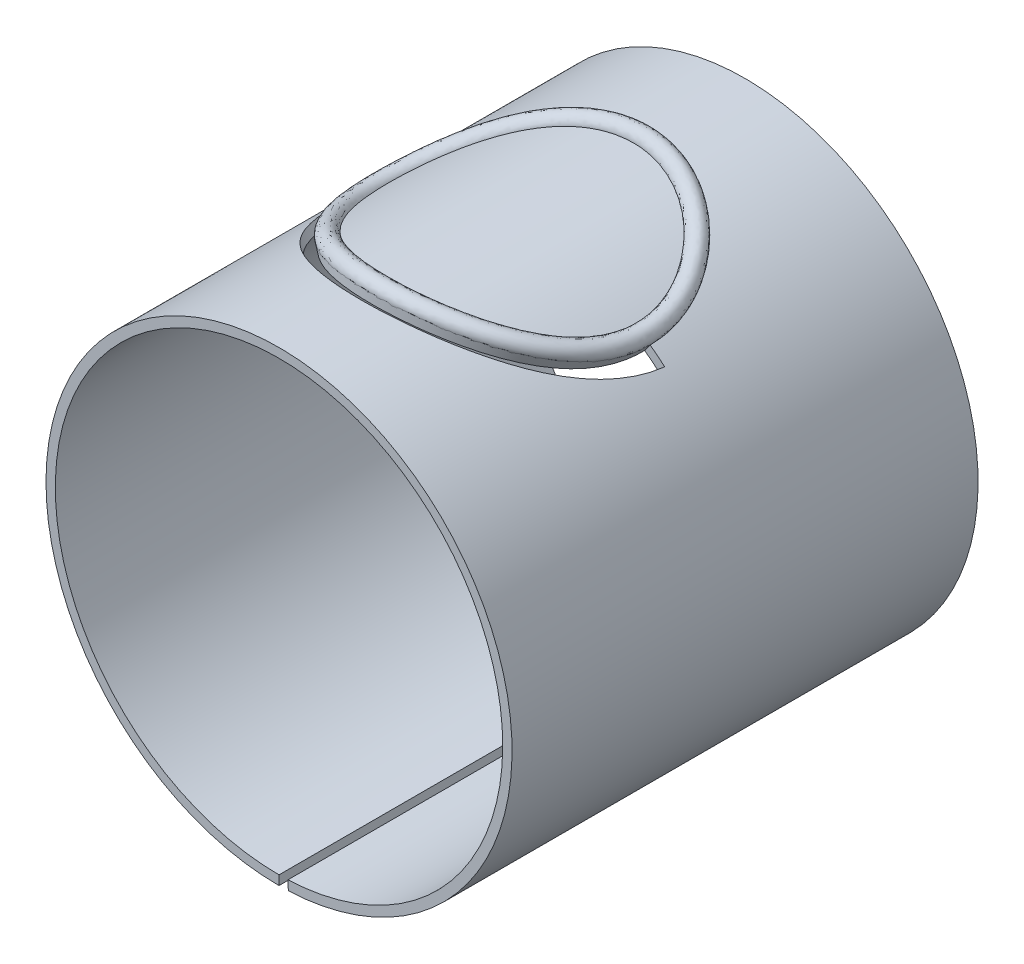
ISO-10303-21;
HEADER;
FILE_DESCRIPTION(('STEP AP214'),'2;1');
FILE_NAME('part.step','',(''),(''),'','','');
FILE_SCHEMA(('AUTOMOTIVE_DESIGN { 1 0 10303 214 1 1 1 1 }'));
ENDSEC;
DATA;
#1=APPLICATION_CONTEXT('core data for automotive mechanical design processes');
#2=APPLICATION_PROTOCOL_DEFINITION('international standard','automotive_design',2000,#1);
#3=PRODUCT_CONTEXT('',#1,'mechanical');
#4=PRODUCT('Part','Part','',(#3));
#5=PRODUCT_RELATED_PRODUCT_CATEGORY('part','',(#4));
#6=PRODUCT_DEFINITION_FORMATION('','',#4);
#7=PRODUCT_DEFINITION_CONTEXT('part definition',#1,'design');
#8=PRODUCT_DEFINITION('design','',#6,#7);
#9=PRODUCT_DEFINITION_SHAPE('','',#8);
#10=(LENGTH_UNIT() NAMED_UNIT(*) SI_UNIT(.MILLI.,.METRE.));
#11=(NAMED_UNIT(*) PLANE_ANGLE_UNIT() SI_UNIT($,.RADIAN.));
#12=(NAMED_UNIT(*) SI_UNIT($,.STERADIAN.) SOLID_ANGLE_UNIT());
#13=UNCERTAINTY_MEASURE_WITH_UNIT(LENGTH_MEASURE(1.E-05),#10,'distance_accuracy_value','');
#14=(GEOMETRIC_REPRESENTATION_CONTEXT(3) GLOBAL_UNCERTAINTY_ASSIGNED_CONTEXT((#13)) GLOBAL_UNIT_ASSIGNED_CONTEXT((#10,
#11,#12)) REPRESENTATION_CONTEXT('',''));
#15=CARTESIAN_POINT('',(0.,0.,0.));
#16=DIRECTION('',(0.,0.,1.));
#17=DIRECTION('',(1.,0.,0.));
#18=AXIS2_PLACEMENT_3D('',#15,#16,#17);
#19=CARTESIAN_POINT('',(15.,20.712315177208,0.));
#20=CARTESIAN_POINT('',(14.9999997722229,20.7123126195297,0.00629419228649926));
#21=CARTESIAN_POINT('',(14.9999956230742,20.7123133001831,0.0125891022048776));
#22=CARTESIAN_POINT('',(14.9986960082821,20.7129445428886,1.02623653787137));
#23=CARTESIAN_POINT('',(14.895743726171,20.7974393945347,2.02536872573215));
#24=CARTESIAN_POINT('',(14.6968874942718,20.9545982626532,2.99286748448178));
#25=CARTESIAN_POINT('',(14.4974358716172,21.1122076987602,3.96016934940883));
#26=CARTESIAN_POINT('',(14.197971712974,21.3444882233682,4.90560903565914));
#27=CARTESIAN_POINT('',(13.8180808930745,21.616960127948,5.78062350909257));
#28=CARTESIAN_POINT('',(13.4376913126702,21.8896803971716,6.6551988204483));
#29=CARTESIAN_POINT('',(12.5089370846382,22.5186286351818,8.29523875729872));
#30=CARTESIAN_POINT('',(11.2716409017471,23.2115586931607,9.68970618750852));
#31=CARTESIAN_POINT('',(10.5871310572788,23.5411785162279,10.329976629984));
#32=CARTESIAN_POINT('',(9.90646617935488,23.8686468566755,10.965918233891));
#33=CARTESIAN_POINT('',(8.41695412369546,24.487623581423,12.1233531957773));
#34=CARTESIAN_POINT('',(6.69151825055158,25.01769317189,12.9797216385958));
#35=CARTESIAN_POINT('',(5.78150201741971,25.2321622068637,13.3393268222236));
#36=CARTESIAN_POINT('',(4.87684590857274,25.4449869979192,13.6962739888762));
#37=CARTESIAN_POINT('',(2.98906593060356,25.7659909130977,14.2677009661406));
#38=CARTESIAN_POINT('',(0.982713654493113,25.9003602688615,14.4387688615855));
#39=CARTESIAN_POINT('',(-0.0319448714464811,25.900562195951,14.4346622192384));
#40=CARTESIAN_POINT('',(-1.04037190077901,25.9003493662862,14.4300269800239));
#41=CARTESIAN_POINT('',(-2.02774933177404,25.83632037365,14.3391943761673));
#42=CARTESIAN_POINT('',(-2.99529878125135,25.7205037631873,14.1546051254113));
#43=CARTESIAN_POINT('',(-3.96272508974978,25.6043655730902,13.9694340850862));
#44=CARTESIAN_POINT('',(-4.92151238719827,25.4336981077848,13.6854477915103));
#45=CARTESIAN_POINT('',(-5.82327016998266,25.220090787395,13.3269892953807));
#46=CARTESIAN_POINT('',(-6.72467195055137,25.006217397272,12.9680688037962));
#47=CARTESIAN_POINT('',(-7.57266604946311,24.7508418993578,12.5374527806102));
#48=CARTESIAN_POINT('',(-8.37226719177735,24.4650338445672,12.0340953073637));
#49=CARTESIAN_POINT('',(-9.17156790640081,24.179037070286,11.5302861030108));
#50=CARTESIAN_POINT('',(-9.9262864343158,23.8605411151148,10.9486629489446));
#51=CARTESIAN_POINT('',(-10.6068062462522,23.530688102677,10.3129179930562));
#52=CARTESIAN_POINT('',(-11.2868639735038,23.200765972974,9.67683752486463));
#53=CARTESIAN_POINT('',(-12.5186580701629,22.5113602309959,8.28153743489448));
#54=CARTESIAN_POINT('',(-13.449642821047,21.8861853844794,6.63076673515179));
#55=CARTESIAN_POINT('',(-13.8311208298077,21.6129298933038,5.74729394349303));
#56=CARTESIAN_POINT('',(-14.2097106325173,21.3416155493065,4.86895000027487));
#57=CARTESIAN_POINT('',(-14.5067648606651,21.1091719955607,3.92528512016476));
#58=CARTESIAN_POINT('',(-14.7037747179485,20.9521341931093,2.95834821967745));
#59=CARTESIAN_POINT('',(-14.9001625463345,20.7955657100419,1.9912687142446));
#60=CARTESIAN_POINT('',(-15.0009516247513,20.7119967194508,0.996556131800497));
#61=CARTESIAN_POINT('',(-14.9999913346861,20.7123705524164,-0.0170081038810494));
#62=CARTESIAN_POINT('',(-14.9983988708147,20.7132660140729,-1.03068909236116));
#63=CARTESIAN_POINT('',(-14.8958076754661,20.797518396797,-2.02455025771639));
#64=CARTESIAN_POINT('',(-14.6971957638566,20.9544694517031,-2.99133620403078));
#65=CARTESIAN_POINT('',(-14.4979877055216,21.111871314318,-3.95795393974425));
#66=CARTESIAN_POINT('',(-14.1991889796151,21.3436157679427,-4.9017409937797));
#67=CARTESIAN_POINT('',(-13.8205019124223,21.6153331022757,-5.77498411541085));
#68=CARTESIAN_POINT('',(-13.4413194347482,21.887297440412,-6.64778738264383));
#69=CARTESIAN_POINT('',(-12.5147447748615,22.5150531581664,-8.28601642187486));
#70=CARTESIAN_POINT('',(-11.2803636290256,23.2066327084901,-9.6807772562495));
#71=CARTESIAN_POINT('',(-10.5975863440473,23.5359322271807,-10.3204971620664));
#72=CARTESIAN_POINT('',(-9.91864498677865,23.863084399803,-10.9558873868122));
#73=CARTESIAN_POINT('',(-8.43252705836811,24.4824049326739,-12.1118286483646));
#74=CARTESIAN_POINT('',(-6.71220827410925,25.0107472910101,-12.9724214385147));
#75=CARTESIAN_POINT('',(-5.80430720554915,25.2267893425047,-13.3303067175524));
#76=CARTESIAN_POINT('',(-4.9017504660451,25.4411921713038,-13.6855214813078));
#77=CARTESIAN_POINT('',(-3.94449173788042,25.6094377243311,-13.9709929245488));
#78=CARTESIAN_POINT('',(-2.97498003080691,25.7227288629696,-14.1588673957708));
#79=CARTESIAN_POINT('',(-2.00539406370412,25.8356779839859,-14.3461351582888));
#80=CARTESIAN_POINT('',(-1.01544423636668,25.8965855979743,-14.4413485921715));
#81=CARTESIAN_POINT('',(-0.00628541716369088,25.8972705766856,-14.4414829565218));
#82=CARTESIAN_POINT('',(1.00299270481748,25.8975813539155,-14.4410265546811));
#83=CARTESIAN_POINT('',(1.99586979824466,25.8377403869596,-14.3455456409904));
#84=CARTESIAN_POINT('',(2.96481204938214,25.7241317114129,-14.1604069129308));
#85=CARTESIAN_POINT('',(3.9336053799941,25.6101892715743,-13.9747116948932));
#86=CARTESIAN_POINT('',(4.89220681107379,25.439944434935,-13.694609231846));
#87=CARTESIAN_POINT('',(5.79746718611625,25.2262018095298,-13.3372066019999));
#88=CARTESIAN_POINT('',(6.70239464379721,25.0121895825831,-12.9793243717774));
#89=CARTESIAN_POINT('',(7.55268692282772,24.7570593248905,-12.5486573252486));
#90=CARTESIAN_POINT('',(8.35360288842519,24.4716328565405,-12.0459472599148));
#91=CARTESIAN_POINT('',(9.1542123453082,24.1860185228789,-11.5427898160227));
#92=CARTESIAN_POINT('',(9.91066369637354,23.8675581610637,-10.9615864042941));
#93=CARTESIAN_POINT('',(10.593462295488,23.5372037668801,-10.3252874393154));
#94=CARTESIAN_POINT('',(11.2758021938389,23.2067769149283,-9.68864689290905));
#95=CARTESIAN_POINT('',(12.5112266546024,22.5162510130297,-8.29251053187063));
#96=CARTESIAN_POINT('',(13.4444890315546,21.889602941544,-6.64096562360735));
#97=CARTESIAN_POINT('',(13.82702740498,21.6157115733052,-5.75685497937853));
#98=CARTESIAN_POINT('',(14.2066705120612,21.3437659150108,-4.8778755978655));
#99=CARTESIAN_POINT('',(14.504641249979,21.1107989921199,-3.93348713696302));
#100=CARTESIAN_POINT('',(14.7024696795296,20.9531867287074,-2.96475404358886));
#101=CARTESIAN_POINT('',(14.899675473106,20.7960434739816,-1.99587163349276));
#102=CARTESIAN_POINT('',(15.0000364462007,20.7127244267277,-1.0071224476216));
#103=CARTESIAN_POINT('',(15.,20.712315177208,0.));
#104=CARTESIAN_POINT('',(15.,22.712315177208,0.));
#105=CARTESIAN_POINT('',(15.0000050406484,22.7123122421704,0.00573325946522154));
#106=CARTESIAN_POINT('',(15.0000054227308,22.7123123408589,0.0114672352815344));
#107=CARTESIAN_POINT('',(14.9993167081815,22.7128167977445,0.934799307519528));
#108=CARTESIAN_POINT('',(14.8779879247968,22.791891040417,1.84355738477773));
#109=CARTESIAN_POINT('',(14.6424009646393,22.934656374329,2.71647684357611));
#110=CARTESIAN_POINT('',(14.4061050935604,23.0778163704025,3.58917332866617));
#111=CARTESIAN_POINT('',(14.0516325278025,23.2867020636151,4.43583463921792));
#112=CARTESIAN_POINT('',(13.6107039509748,23.5222380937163,5.20884988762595));
#113=CARTESIAN_POINT('',(13.1692396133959,23.7579381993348,5.98140604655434));
#114=CARTESIAN_POINT('',(12.1069112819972,24.2861858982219,7.41168401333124));
#115=CARTESIAN_POINT('',(10.7578128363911,24.8047173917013,8.59083716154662));
#116=CARTESIAN_POINT('',(10.0471402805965,25.053755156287,9.13808819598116));
#117=CARTESIAN_POINT('',(9.34065803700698,25.3011821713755,9.68167793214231));
#118=CARTESIAN_POINT('',(7.85832570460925,25.774399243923,10.6847716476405));
#119=CARTESIAN_POINT('',(6.18597906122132,26.1268088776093,11.392815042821));
#120=CARTESIAN_POINT('',(5.32747976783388,26.2850538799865,11.7006263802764));
#121=CARTESIAN_POINT('',(4.47417401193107,26.4422035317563,12.0062386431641));
#122=CARTESIAN_POINT('',(2.73707675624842,26.7165973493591,12.5197364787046));
#123=CARTESIAN_POINT('',(0.899295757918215,26.7741373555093,12.6397965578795));
#124=CARTESIAN_POINT('',(-0.0291726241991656,26.76995193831,12.6335063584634));
#125=CARTESIAN_POINT('',(-0.95193344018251,26.7655879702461,12.6268445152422));
#126=CARTESIAN_POINT('',(-1.85235171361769,26.7308695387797,12.5569424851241));
#127=CARTESIAN_POINT('',(-2.74172110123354,26.6502912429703,12.4021200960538));
#128=CARTESIAN_POINT('',(-3.63102220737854,26.5694285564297,12.2467709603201));
#129=CARTESIAN_POINT('',(-4.52046227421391,26.4399871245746,12.0014138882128));
#130=CARTESIAN_POINT('',(-5.37030378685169,26.283188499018,11.6946186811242));
#131=CARTESIAN_POINT('',(-6.21989762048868,26.1262202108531,11.3874423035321));
#132=CARTESIAN_POINT('',(-7.03341637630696,25.9431757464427,11.0215030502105));
#133=CARTESIAN_POINT('',(-7.81757783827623,25.7355689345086,10.5925417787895));
#134=CARTESIAN_POINT('',(-8.60155735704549,25.5278096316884,10.1631891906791));
#135=CARTESIAN_POINT('',(-9.35991318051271,25.29334802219,9.66568945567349));
#136=CARTESIAN_POINT('',(-10.069757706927,25.0474251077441,9.12504084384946));
#137=CARTESIAN_POINT('',(-10.7792988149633,24.8014317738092,8.58412439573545));
#138=CARTESIAN_POINT('',(-12.12049469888,24.2789469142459,7.40015147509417));
#139=CARTESIAN_POINT('',(-13.1732282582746,23.7531134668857,5.95598610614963));
#140=CARTESIAN_POINT('',(-13.6147746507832,23.5170734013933,5.17509576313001));
#141=CARTESIAN_POINT('',(-14.0530540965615,23.2826665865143,4.39869257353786));
#142=CARTESIAN_POINT('',(-14.4085231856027,23.0746205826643,3.55560803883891));
#143=CARTESIAN_POINT('',(-14.6445492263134,22.9323564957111,2.684065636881));
#144=CARTESIAN_POINT('',(-14.879832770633,22.7905021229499,1.81234861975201));
#145=CARTESIAN_POINT('',(-15.0002417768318,22.7121099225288,0.907876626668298));
#146=CARTESIAN_POINT('',(-14.9998926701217,22.7123692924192,-0.0154906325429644));
#147=CARTESIAN_POINT('',(-14.9987933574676,22.7131172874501,-0.938974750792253));
#148=CARTESIAN_POINT('',(-14.8778092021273,22.7919413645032,-1.84265604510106));
#149=CARTESIAN_POINT('',(-14.6425363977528,22.9345357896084,-2.71503781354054));
#150=CARTESIAN_POINT('',(-14.4065544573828,23.0775253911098,-3.5872251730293));
#151=CARTESIAN_POINT('',(-14.0529026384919,23.2859561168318,-4.43238989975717));
#152=CARTESIAN_POINT('',(-13.6132881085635,23.520798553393,-5.20377777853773));
#153=CARTESIAN_POINT('',(-13.1731408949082,23.7558035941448,-5.97470580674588));
#154=CARTESIAN_POINT('',(-12.1131243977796,24.2829448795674,-7.40343786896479));
#155=CARTESIAN_POINT('',(-10.7675777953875,24.8016327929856,-8.58373986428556));
#156=CARTESIAN_POINT('',(-10.0584510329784,25.0501569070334,-9.13031902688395));
#157=CARTESIAN_POINT('',(-9.35350362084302,25.297069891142,-9.67323348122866));
#158=CARTESIAN_POINT('',(-7.8732079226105,25.7684145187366,-10.6735284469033));
#159=CARTESIAN_POINT('',(-6.20625166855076,26.1261942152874,-11.3893457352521));
#160=CARTESIAN_POINT('',(-5.34894650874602,26.281115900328,-11.6929068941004));
#161=CARTESIAN_POINT('',(-4.49681838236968,26.4349264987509,-11.9942461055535));
#162=CARTESIAN_POINT('',(-3.61319089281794,26.5667200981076,-12.2439630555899));
#163=CARTESIAN_POINT('',(-2.72321419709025,26.6525499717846,-12.4061457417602));
#164=CARTESIAN_POINT('',(-1.83319971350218,26.7380939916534,-12.567784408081));
#165=CARTESIAN_POINT('',(-0.928657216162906,26.7805831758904,-12.6473994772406));
#166=CARTESIAN_POINT('',(-0.00574513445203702,26.7802364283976,-12.6469430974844));
#167=CARTESIAN_POINT('',(0.917281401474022,26.7796233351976,-12.6459890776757));
#168=CARTESIAN_POINT('',(1.82313109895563,26.7361163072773,-12.5649114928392));
#169=CARTESIAN_POINT('',(2.71366562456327,26.6528409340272,-12.4070024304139));
#170=CARTESIAN_POINT('',(3.60410510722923,26.5693187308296,-12.2486165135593));
#171=CARTESIAN_POINT('',(4.49297354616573,26.443404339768,-12.0085656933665));
#172=CARTESIAN_POINT('',(5.34598618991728,26.2876340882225,-11.7033391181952));
#173=CARTESIAN_POINT('',(6.19877457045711,26.1316786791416,-11.3977081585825));
#174=CARTESIAN_POINT('',(7.01431332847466,25.9481169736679,-11.0313275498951));
#175=CARTESIAN_POINT('',(7.79940196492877,25.7405348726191,-10.6027696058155));
#176=CARTESIAN_POINT('',(8.5843019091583,25.5328036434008,-10.1738256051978));
#177=CARTESIAN_POINT('',(9.34389535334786,25.2984246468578,-9.67664766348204));
#178=CARTESIAN_POINT('',(10.0557226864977,25.0521775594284,-9.1354740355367));
#179=CARTESIAN_POINT('',(10.7672512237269,24.8058575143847,-8.59402728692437));
#180=CARTESIAN_POINT('',(12.1118849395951,24.2828633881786,-7.40952781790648));
#181=CARTESIAN_POINT('',(13.1676209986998,23.7560467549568,-5.96502552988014));
#182=CARTESIAN_POINT('',(13.6103480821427,23.519519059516,-5.18366505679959));
#183=CARTESIAN_POINT('',(14.0497989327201,23.2846276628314,-4.4067927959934));
#184=CARTESIAN_POINT('',(14.406065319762,23.0761090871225,-3.56309981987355));
#185=CARTESIAN_POINT('',(14.6429613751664,22.9333127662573,-2.68983904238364));
#186=CARTESIAN_POINT('',(14.8791153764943,22.7909257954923,-1.81639671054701));
#187=CARTESIAN_POINT('',(14.9991934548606,22.712784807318,-0.91736859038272));
#188=CARTESIAN_POINT('',(15.,22.712315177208,0.));
#189=CARTESIAN_POINT('',(13.,22.712315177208,0.));
#190=CARTESIAN_POINT('',(13.0000053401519,22.7123173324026,0.00490171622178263));
#191=CARTESIAN_POINT('',(13.0000065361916,22.7123210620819,0.00980414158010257));
#192=CARTESIAN_POINT('',(12.9995317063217,22.7131753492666,0.799249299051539));
#193=CARTESIAN_POINT('',(12.8916704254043,22.7550312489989,1.57404635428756));
#194=CARTESIAN_POINT('',(12.6828760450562,22.8269181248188,2.33092428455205));
#195=CARTESIAN_POINT('',(12.4734554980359,22.8989913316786,3.08769075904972));
#196=CARTESIAN_POINT('',(12.1590980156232,23.0034555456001,3.83626584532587));
#197=CARTESIAN_POINT('',(11.7711951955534,23.1197630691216,4.53488019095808));
#198=CARTESIAN_POINT('',(11.3828368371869,23.2361432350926,5.23318253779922));
#199=CARTESIAN_POINT('',(10.45198340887,23.4973229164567,6.5623393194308));
#200=CARTESIAN_POINT('',(9.28997583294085,23.7438378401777,7.73289000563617));
#201=CARTESIAN_POINT('',(8.67620634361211,23.8824887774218,8.27278844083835));
#202=CARTESIAN_POINT('',(8.0660462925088,24.0203718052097,8.80905307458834));
#203=CARTESIAN_POINT('',(6.78126731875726,24.3266952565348,9.79183562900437));
#204=CARTESIAN_POINT('',(5.34177245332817,24.524912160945,10.5365645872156));
#205=CARTESIAN_POINT('',(4.59967221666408,24.632599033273,10.8405443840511));
#206=CARTESIAN_POINT('',(3.86204274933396,24.7396673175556,11.1422137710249));
#207=CARTESIAN_POINT('',(2.35421041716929,24.9667496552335,11.6047868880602));
#208=CARTESIAN_POINT('',(0.775352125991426,24.9754125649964,11.7658528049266));
#209=CARTESIAN_POINT('',(-0.0252382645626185,24.9687927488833,11.764120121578));
#210=CARTESIAN_POINT('',(-0.820925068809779,24.9621447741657,11.7618900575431));
#211=CARTESIAN_POINT('',(-1.59661337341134,24.9468019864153,11.6808021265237));
#212=CARTESIAN_POINT('',(-2.36371478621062,24.8932743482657,11.5246241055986));
#213=CARTESIAN_POINT('',(-3.1307633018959,24.8395102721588,11.3679797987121));
#214=CARTESIAN_POINT('',(-3.90041240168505,24.7448402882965,11.1310017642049));
#215=CARTESIAN_POINT('',(-4.63534227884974,24.6378584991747,10.8270235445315));
#216=CARTESIAN_POINT('',(-5.37005472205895,24.5308004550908,10.522629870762));
#217=CARTESIAN_POINT('',(-6.07353154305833,24.4126122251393,10.1539876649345));
#218=CARTESIAN_POINT('',(-6.75097974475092,24.2839425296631,9.72354148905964));
#219=CARTESIAN_POINT('',(-7.42826676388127,24.1552080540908,9.29271166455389));
#220=CARTESIAN_POINT('',(-8.08325196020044,24.0138057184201,8.79496164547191));
#221=CARTESIAN_POINT('',(-8.69530198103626,23.8816686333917,8.25794907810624));
#222=CARTESIAN_POINT('',(-9.30708351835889,23.7495889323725,7.72069353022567));
#223=CARTESIAN_POINT('',(-10.4645124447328,23.4949960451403,6.55194922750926));
#224=CARTESIAN_POINT('',(-11.3863950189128,23.2247831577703,5.21281148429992));
#225=CARTESIAN_POINT('',(-11.7746821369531,23.1072926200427,4.5071753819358));
#226=CARTESIAN_POINT('',(-12.1601082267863,22.9906409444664,3.80569928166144));
#227=CARTESIAN_POINT('',(-12.4750724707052,22.8903274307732,3.05952015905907));
#228=CARTESIAN_POINT('',(-12.6842751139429,22.8209950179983,2.30336025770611));
#229=CARTESIAN_POINT('',(-12.8928202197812,22.7518560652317,1.54713978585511));
#230=CARTESIAN_POINT('',(-13.0000849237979,22.7115768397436,0.776412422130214));
#231=CARTESIAN_POINT('',(-12.9998942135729,22.7122690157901,-0.0132425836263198));
#232=CARTESIAN_POINT('',(-12.9990359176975,22.7132159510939,-0.803015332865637));
#233=CARTESIAN_POINT('',(-12.891512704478,22.754818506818,-1.57312677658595));
#234=CARTESIAN_POINT('',(-12.6829789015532,22.8266719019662,-2.3296863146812));
#235=CARTESIAN_POINT('',(-12.4738184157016,22.8987130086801,-3.08616190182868));
#236=CARTESIAN_POINT('',(-12.1601812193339,23.0029991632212,-3.83328904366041));
#237=CARTESIAN_POINT('',(-11.7734667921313,23.1188492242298,-4.53034831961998));
#238=CARTESIAN_POINT('',(-11.3862997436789,23.2347702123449,-5.22709496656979));
#239=CARTESIAN_POINT('',(-10.457456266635,23.4952359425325,-6.55489200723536));
#240=CARTESIAN_POINT('',(-9.29823485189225,23.7430940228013,-7.72521055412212));
#241=CARTESIAN_POINT('',(-8.68586037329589,23.8810733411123,-8.26469715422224));
#242=CARTESIAN_POINT('',(-8.0770867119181,24.0182807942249,-8.80055066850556));
#243=CARTESIAN_POINT('',(-6.79449830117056,24.3209580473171,-9.78288937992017));
#244=CARTESIAN_POINT('',(-5.35858573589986,24.5281924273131,-10.5284317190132));
#245=CARTESIAN_POINT('',(-4.61824547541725,24.6299049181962,-10.8328966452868));
#246=CARTESIAN_POINT('',(-3.88236488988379,24.7309724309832,-11.1350486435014));
#247=CARTESIAN_POINT('',(-3.11572265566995,24.8320518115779,-11.3719133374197));
#248=CARTESIAN_POINT('',(-2.34758413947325,24.895390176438,-11.5279257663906));
#249=CARTESIAN_POINT('',(-1.57943777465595,24.958493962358,-11.6834354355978));
#250=CARTESIAN_POINT('',(-0.801553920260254,24.986747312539,-11.7635234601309));
#251=CARTESIAN_POINT('',(-0.00492695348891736,24.9856950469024,-11.7639771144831));
#252=CARTESIAN_POINT('',(0.791816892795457,24.9844603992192,-11.7639358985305));
#253=CARTESIAN_POINT('',(1.5717719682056,24.9537666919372,-11.6842142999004));
#254=CARTESIAN_POINT('',(2.33951688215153,24.8949870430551,-11.5295269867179));
#255=CARTESIAN_POINT('',(3.10718609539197,24.8360332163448,-11.3743742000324));
#256=CARTESIAN_POINT('',(3.87637918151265,24.7463121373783,-11.1393775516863));
#257=CARTESIAN_POINT('',(4.61431055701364,24.6408623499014,-10.8357028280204));
#258=CARTESIAN_POINT('',(5.35204616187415,24.5353151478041,-10.5316021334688));
#259=CARTESIAN_POINT('',(6.05709118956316,24.4162012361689,-10.1632977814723));
#260=CARTESIAN_POINT('',(6.73522611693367,24.2872227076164,-9.73361680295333));
#261=CARTESIAN_POINT('',(7.41319441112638,24.158183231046,-9.30355485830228));
#262=CARTESIAN_POINT('',(8.06938583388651,24.0166055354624,-8.80607347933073));
#263=CARTESIAN_POINT('',(8.68322955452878,23.8840697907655,-8.26843829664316));
#264=CARTESIAN_POINT('',(9.29680844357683,23.751590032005,-7.73055457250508));
#265=CARTESIAN_POINT('',(10.4569866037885,23.4967053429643,-6.56100034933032));
#266=CARTESIAN_POINT('',(11.3814817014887,23.2265050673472,-5.22101143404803));
#267=CARTESIAN_POINT('',(11.7707929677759,23.1087873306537,-4.51484889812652));
#268=CARTESIAN_POINT('',(12.1572351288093,22.9919084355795,-3.81284900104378));
#269=CARTESIAN_POINT('',(12.472880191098,22.8911459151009,-3.06620358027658));
#270=CARTESIAN_POINT('',(12.682864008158,22.8214441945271,-2.30837279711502));
#271=CARTESIAN_POINT('',(12.8921909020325,22.751936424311,-1.55047392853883));
#272=CARTESIAN_POINT('',(12.9991455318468,22.7119703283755,-0.78431484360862));
#273=CARTESIAN_POINT('',(13.,22.712315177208,0.));
#274=CARTESIAN_POINT('',(13.,20.712315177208,0.));
#275=CARTESIAN_POINT('',(13.0000000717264,20.7123177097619,0.00546264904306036));
#276=CARTESIAN_POINT('',(12.999996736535,20.7123220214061,0.0109260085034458));
#277=CARTESIAN_POINT('',(12.9989110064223,20.7133030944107,0.890686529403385));
#278=CARTESIAN_POINT('',(12.9094262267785,20.7605796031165,1.75585769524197));
#279=CARTESIAN_POINT('',(12.7373625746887,20.846860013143,2.60731492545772));
#280=CARTESIAN_POINT('',(12.5647862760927,20.9333826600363,3.45868677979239));
#281=CARTESIAN_POINT('',(12.3054372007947,21.0612417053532,4.30604024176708));
#282=CARTESIAN_POINT('',(11.9785721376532,21.2144851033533,5.10665381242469));
#283=CARTESIAN_POINT('',(11.6512885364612,21.3678854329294,5.90697531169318));
#284=CARTESIAN_POINT('',(10.854009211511,21.7297656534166,7.44589406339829));
#285=CARTESIAN_POINT('',(9.80380389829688,22.150679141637,8.83175903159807));
#286=CARTESIAN_POINT('',(9.21619712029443,22.3699121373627,9.46467687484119));
#287=CARTESIAN_POINT('',(8.6318544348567,22.5878364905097,10.093293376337));
#288=CARTESIAN_POINT('',(7.33989573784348,23.0399195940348,11.2304171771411));
#289=CARTESIAN_POINT('',(5.84731164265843,23.4157964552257,12.1234711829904));
#290=CARTESIAN_POINT('',(5.05369446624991,23.5797073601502,12.4792448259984));
#291=CARTESIAN_POINT('',(4.26471464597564,23.7424507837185,12.832249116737));
#292=CARTESIAN_POINT('',(2.60619959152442,24.016143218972,13.3527513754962));
#293=CARTESIAN_POINT('',(0.858770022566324,24.1016354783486,13.5648251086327));
#294=CARTESIAN_POINT('',(-0.0280105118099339,24.0994030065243,13.5652759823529));
#295=CARTESIAN_POINT('',(-0.909363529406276,24.0969061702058,13.5650725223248));
#296=CARTESIAN_POINT('',(-1.77201099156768,24.0522528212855,13.4630540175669));
#297=CARTESIAN_POINT('',(-2.61729246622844,23.9634868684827,13.2771091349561));
#298=CARTESIAN_POINT('',(-3.46246618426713,23.8744472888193,13.0906429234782));
#299=CARTESIAN_POINT('',(-4.30146251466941,23.7385512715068,12.8150356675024));
#300=CARTESIAN_POINT('',(-5.08830866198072,23.5747607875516,12.459394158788));
#301=CARTESIAN_POINT('',(-5.87482905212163,23.4107976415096,12.1032563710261));
#302=CARTESIAN_POINT('',(-6.61278121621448,23.2202783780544,11.6699373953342));
#303=CARTESIAN_POINT('',(-7.30566909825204,23.0134074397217,11.1650950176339));
#304=CARTESIAN_POINT('',(-7.99827731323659,22.8064354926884,10.6598085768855));
#305=CARTESIAN_POINT('',(-8.64962521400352,22.5809988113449,10.077935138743));
#306=CARTESIAN_POINT('',(-9.23235052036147,22.3649316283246,9.44582622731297));
#307=CARTESIAN_POINT('',(-9.81464867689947,22.1489231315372,8.81340665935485));
#308=CARTESIAN_POINT('',(-10.8626758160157,21.7274093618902,7.43333518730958));
#309=CARTESIAN_POINT('',(-11.6628095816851,21.3578550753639,5.88759211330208));
#310=CARTESIAN_POINT('',(-11.9910283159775,21.2031491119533,5.07937356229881));
#311=CARTESIAN_POINT('',(-12.3167647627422,21.0495899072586,4.27595670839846));
#312=CARTESIAN_POINT('',(-12.5733141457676,20.9248788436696,3.42919724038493));
#313=CARTESIAN_POINT('',(-12.7435006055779,20.8407727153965,2.57764284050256));
#314=CARTESIAN_POINT('',(-12.9131499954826,20.7569196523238,1.7260598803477));
#315=CARTESIAN_POINT('',(-13.0007947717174,20.7114636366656,0.865091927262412));
#316=CARTESIAN_POINT('',(-12.9999928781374,20.7122702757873,-0.0147600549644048));
#317=CARTESIAN_POINT('',(-12.9986414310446,20.7133646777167,-0.894729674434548));
#318=CARTESIAN_POINT('',(-12.9095111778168,20.7603955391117,-1.75502098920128));
#319=CARTESIAN_POINT('',(-12.7376382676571,20.8466055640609,-2.60598470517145));
#320=CARTESIAN_POINT('',(-12.5652516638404,20.9330589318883,-3.45689066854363));
#321=CARTESIAN_POINT('',(-12.3064675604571,21.0606588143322,-4.30264013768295));
#322=CARTESIAN_POINT('',(-11.9806805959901,21.2133837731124,-5.10155465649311));
#323=CARTESIAN_POINT('',(-11.6544782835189,21.366264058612,-5.90017654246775));
#324=CARTESIAN_POINT('',(-10.859076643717,21.7273442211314,-7.43747056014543));
#325=CARTESIAN_POINT('',(-9.81102068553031,22.1480939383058,-8.82224794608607));
#326=CARTESIAN_POINT('',(-9.2249956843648,22.3668486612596,-9.45487528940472));
#327=CARTESIAN_POINT('',(-8.64222807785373,22.5842953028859,-10.0832045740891));
#328=CARTESIAN_POINT('',(-7.35381743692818,23.0349484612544,-11.2211895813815));
#329=CARTESIAN_POINT('',(-5.86454234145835,23.4127455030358,-12.1115074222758));
#330=CARTESIAN_POINT('',(-5.07360617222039,23.5755783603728,-12.4702964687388));
#331=CARTESIAN_POINT('',(-4.28729697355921,23.7372381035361,-12.8263240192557));
#332=CARTESIAN_POINT('',(-3.44702350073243,23.8747694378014,-13.0989432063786));
#333=CARTESIAN_POINT('',(-2.59934997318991,23.965569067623,-13.2806474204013));
#334=CARTESIAN_POINT('',(-1.75163212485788,24.0560779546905,-13.4617861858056));
#335=CARTESIAN_POINT('',(-0.888340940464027,24.1027497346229,-13.5574725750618));
#336=CARTESIAN_POINT('',(-0.00546723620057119,24.1027291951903,-13.5585169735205));
#337=CARTESIAN_POINT('',(0.877528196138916,24.102418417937,-13.5589733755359));
#338=CARTESIAN_POINT('',(1.74451066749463,24.0553907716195,-13.4648484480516));
#339=CARTESIAN_POINT('',(2.5906633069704,23.9662778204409,-13.2829314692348));
#340=CARTESIAN_POINT('',(3.43668636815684,23.8769037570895,-13.1004693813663));
#341=CARTESIAN_POINT('',(4.27561244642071,23.7428522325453,-12.8254210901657));
#342=CARTESIAN_POINT('',(5.06579155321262,23.5794300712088,-12.4695703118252));
#343=CARTESIAN_POINT('',(5.85566623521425,23.4158260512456,-12.1132183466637));
#344=CARTESIAN_POINT('',(6.59546478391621,23.2251435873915,-11.6806275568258));
#345=CARTESIAN_POINT('',(7.2894270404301,23.0183206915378,-11.1767944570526));
#346=CARTESIAN_POINT('',(7.98310484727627,22.8113981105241,-10.6725190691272));
#347=CARTESIAN_POINT('',(8.63615417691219,22.5857390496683,-10.0910122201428));
#348=CARTESIAN_POINT('',(9.22096916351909,22.3690959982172,-9.45825170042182));
#349=CARTESIAN_POINT('',(9.80535941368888,22.1525094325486,-8.82517417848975));
#350=CARTESIAN_POINT('',(10.8563283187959,21.7300929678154,-7.44398306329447));
#351=CARTESIAN_POINT('',(11.6583497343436,21.3600612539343,-5.89695152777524));
#352=CARTESIAN_POINT('',(11.9874722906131,21.2049798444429,-5.08803882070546));
#353=CARTESIAN_POINT('',(12.3141067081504,21.0510466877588,-4.28393180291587));
#354=CARTESIAN_POINT('',(12.571456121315,20.9258358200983,-3.43659089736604));
#355=CARTESIAN_POINT('',(12.7423723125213,20.8413181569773,-2.58328779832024));
#356=CARTESIAN_POINT('',(12.9127509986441,20.7570541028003,-1.72994885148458));
#357=CARTESIAN_POINT('',(12.9999885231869,20.7119099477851,-0.874068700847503));
#358=CARTESIAN_POINT('',(13.,20.712315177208,0.));
#359=CARTESIAN_POINT('',(13.,18.712315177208,0.));
#360=CARTESIAN_POINT('',(12.9999948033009,18.7123180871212,0.00602358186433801));
#361=CARTESIAN_POINT('',(12.9999869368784,18.7123229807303,0.012047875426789));
#362=CARTESIAN_POINT('',(12.9982903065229,18.7134308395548,0.98212375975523));
#363=CARTESIAN_POINT('',(12.9271820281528,18.7661279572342,1.93766903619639));
#364=CARTESIAN_POINT('',(12.7918491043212,18.8668019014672,2.88370556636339));
#365=CARTESIAN_POINT('',(12.6561170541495,18.967773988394,3.82968280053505));
#366=CARTESIAN_POINT('',(12.4517763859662,19.1190278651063,4.7758146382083));
#367=CARTESIAN_POINT('',(12.1859490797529,19.309207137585,5.6784274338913));
#368=CARTESIAN_POINT('',(11.9197402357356,19.4996276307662,6.58076808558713));
#369=CARTESIAN_POINT('',(11.2560350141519,19.9622083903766,8.32944880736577));
#370=CARTESIAN_POINT('',(10.3176319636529,20.5575204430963,9.93062805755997));
#371=CARTESIAN_POINT('',(9.75618789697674,20.8573354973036,10.656565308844));
#372=CARTESIAN_POINT('',(9.19766257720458,21.1553011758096,11.3775336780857));
#373=CARTESIAN_POINT('',(7.89852415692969,21.7531439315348,12.6689987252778));
#374=CARTESIAN_POINT('',(6.3528508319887,22.3066807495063,13.7103777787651));
#375=CARTESIAN_POINT('',(5.50771671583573,22.5268156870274,14.1179452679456));
#376=CARTESIAN_POINT('',(4.66738654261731,22.7452342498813,14.5222844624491));
#377=CARTESIAN_POINT('',(2.85818876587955,23.0655367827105,15.1007158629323));
#378=CARTESIAN_POINT('',(0.942187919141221,23.2278583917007,15.3637974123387));
#379=CARTESIAN_POINT('',(-0.0307827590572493,23.2300132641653,15.3664318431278));
#380=CARTESIAN_POINT('',(-0.997801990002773,23.2316675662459,15.3682549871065));
#381=CARTESIAN_POINT('',(-1.94740860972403,23.1577036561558,15.2453059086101));
#382=CARTESIAN_POINT('',(-2.87087014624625,23.0336993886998,15.0295941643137));
#383=CARTESIAN_POINT('',(-3.79416906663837,22.9093843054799,14.8133060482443));
#384=CARTESIAN_POINT('',(-4.70251262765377,22.732262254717,14.4990695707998));
#385=CARTESIAN_POINT('',(-5.54127504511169,22.5116630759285,14.0917647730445));
#386=CARTESIAN_POINT('',(-6.37960338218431,22.2907948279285,13.6838828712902));
#387=CARTESIAN_POINT('',(-7.15203088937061,22.0279445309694,13.1858871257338));
#388=CARTESIAN_POINT('',(-7.86035845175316,21.7428723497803,12.6066485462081));
#389=CARTESIAN_POINT('',(-8.56828786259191,21.457662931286,12.0269054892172));
#390=CARTESIAN_POINT('',(-9.2159984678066,21.1481919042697,11.3609086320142));
#391=CARTESIAN_POINT('',(-9.76939905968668,20.8481946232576,10.6337033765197));
#392=CARTESIAN_POINT('',(-10.3222138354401,20.548257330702,9.90611978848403));
#393=CARTESIAN_POINT('',(-11.2608391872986,19.9598226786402,8.31472114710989));
#394=CARTESIAN_POINT('',(-11.9392241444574,19.4909269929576,6.56237274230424));
#395=CARTESIAN_POINT('',(-12.207374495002,19.2990056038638,5.65157174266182));
#396=CARTESIAN_POINT('',(-12.473421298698,19.1085388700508,4.74621413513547));
#397=CARTESIAN_POINT('',(-12.6715558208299,18.9594302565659,3.79887432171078));
#398=CARTESIAN_POINT('',(-12.802726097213,18.8605504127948,2.85192542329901));
#399=CARTESIAN_POINT('',(-12.933479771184,18.7619832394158,1.90497997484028));
#400=CARTESIAN_POINT('',(-13.001504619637,18.7113504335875,0.95377143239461));
#401=CARTESIAN_POINT('',(-13.0000915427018,18.7122715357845,-0.01627752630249));
#402=CARTESIAN_POINT('',(-12.9982469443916,18.7135134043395,-0.986444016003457));
#403=CARTESIAN_POINT('',(-12.9275096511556,18.7659725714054,-1.93691520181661));
#404=CARTESIAN_POINT('',(-12.7922976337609,18.8665392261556,-2.88228309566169));
#405=CARTESIAN_POINT('',(-12.6566849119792,18.9674048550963,-3.82761943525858));
#406=CARTESIAN_POINT('',(-12.4527539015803,19.1183184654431,-4.77199123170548));
#407=CARTESIAN_POINT('',(-12.187894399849,19.3079183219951,-5.67276099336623));
#408=CARTESIAN_POINT('',(-11.9226568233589,19.4977579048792,-6.5732581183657));
#409=CARTESIAN_POINT('',(-11.260697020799,19.9594524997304,-8.32004911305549));
#410=CARTESIAN_POINT('',(-10.3238065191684,20.5530938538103,-9.91928533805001));
#411=CARTESIAN_POINT('',(-9.76413099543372,20.852623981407,-10.6450534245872));
#412=CARTESIAN_POINT('',(-9.20736944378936,21.1503098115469,-11.3658584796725));
#413=CARTESIAN_POINT('',(-7.91313657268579,21.7489388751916,-12.6594897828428));
#414=CARTESIAN_POINT('',(-6.37049894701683,22.2972985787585,-13.6945831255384));
#415=CARTESIAN_POINT('',(-5.52896686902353,22.5212518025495,-14.1076962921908));
#416=CARTESIAN_POINT('',(-4.69222905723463,22.7435037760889,-14.51759939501));
#417=CARTESIAN_POINT('',(-3.77832434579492,22.9174870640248,-14.8259730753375));
#418=CARTESIAN_POINT('',(-2.85111580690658,23.035747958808,-15.0333690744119));
#419=CARTESIAN_POINT('',(-1.92382647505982,23.1536619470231,-15.2401369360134));
#420=CARTESIAN_POINT('',(-0.975127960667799,23.2187521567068,-15.3514216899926));
#421=CARTESIAN_POINT('',(-0.00600751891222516,23.2197633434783,-15.3530568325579));
#422=CARTESIAN_POINT('',(0.963239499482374,23.2203764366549,-15.3540108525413));
#423=CARTESIAN_POINT('',(1.91724936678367,23.1570148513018,-15.2454825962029));
#424=CARTESIAN_POINT('',(2.84180973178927,23.0375685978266,-15.0363359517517));
#425=CARTESIAN_POINT('',(3.76618664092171,22.9177742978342,-14.8265645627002));
#426=CARTESIAN_POINT('',(4.67484571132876,22.7393923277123,-14.5114646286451));
#427=CARTESIAN_POINT('',(5.51727254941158,22.5179977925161,-14.1034377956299));
#428=CARTESIAN_POINT('',(6.35928630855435,22.2963369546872,-13.6948345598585));
#429=CARTESIAN_POINT('',(7.13383837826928,22.0340859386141,-13.1979573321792));
#430=CARTESIAN_POINT('',(7.84362796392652,21.7494186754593,-12.6199721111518));
#431=CARTESIAN_POINT('',(8.55301528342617,21.4646129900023,-12.041483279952));
#432=CARTESIAN_POINT('',(9.20292251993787,21.1548725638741,-11.3759509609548));
#433=CARTESIAN_POINT('',(9.7587087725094,20.8541222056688,-10.6480651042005));
#434=CARTESIAN_POINT('',(10.3139103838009,20.5534288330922,-9.91979378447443));
#435=CARTESIAN_POINT('',(11.2556700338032,19.9634805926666,-8.32696577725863));
#436=CARTESIAN_POINT('',(11.9352177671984,19.4936174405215,-6.57289162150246));
#437=CARTESIAN_POINT('',(12.2041516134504,19.301172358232,-5.6612287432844));
#438=CARTESIAN_POINT('',(12.4709782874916,19.1101849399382,-4.75501460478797));
#439=CARTESIAN_POINT('',(12.670032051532,18.9605257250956,-3.8069782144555));
#440=CARTESIAN_POINT('',(12.8018806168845,18.8611921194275,-2.85820279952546));
#441=CARTESIAN_POINT('',(12.9333110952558,18.7621717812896,-1.90942377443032));
#442=CARTESIAN_POINT('',(13.000831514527,18.7118495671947,-0.963822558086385));
#443=CARTESIAN_POINT('',(13.,18.712315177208,0.));
#444=CARTESIAN_POINT('',(15.,18.712315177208,0.));
#445=CARTESIAN_POINT('',(14.9999945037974,18.7123129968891,0.00685512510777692));
#446=CARTESIAN_POINT('',(14.9999858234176,18.7123142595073,0.0137109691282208));
#447=CARTESIAN_POINT('',(14.9980753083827,18.7130722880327,1.11767376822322));
#448=CARTESIAN_POINT('',(14.9134995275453,18.8029877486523,2.20718006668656));
#449=CARTESIAN_POINT('',(14.7513740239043,18.9745401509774,3.26925812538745));
#450=CARTESIAN_POINT('',(14.588766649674,19.146599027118,4.3311653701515));
#451=CARTESIAN_POINT('',(14.3443108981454,19.4022743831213,5.37538343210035));
#452=CARTESIAN_POINT('',(14.0254578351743,19.7116821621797,6.35239713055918));
#453=CARTESIAN_POINT('',(13.7061430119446,20.0214225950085,7.32899159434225));
#454=CARTESIAN_POINT('',(12.9109628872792,20.7510713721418,9.17879350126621));
#455=CARTESIAN_POINT('',(11.7854689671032,21.61839999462,10.7885752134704));
#456=CARTESIAN_POINT('',(11.1271218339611,22.0286018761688,11.5218650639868));
#457=CARTESIAN_POINT('',(10.4722743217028,22.4361115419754,12.2501585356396));
#458=CARTESIAN_POINT('',(8.97558254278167,23.2008479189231,13.561934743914));
#459=CARTESIAN_POINT('',(7.19705743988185,23.9085774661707,14.5666282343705));
#460=CARTESIAN_POINT('',(6.23552426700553,24.179270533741,14.9780272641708));
#461=CARTESIAN_POINT('',(5.27951780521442,24.447770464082,15.3863093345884));
#462=CARTESIAN_POINT('',(3.24105510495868,24.8153844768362,16.0156654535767));
#463=CARTESIAN_POINT('',(1.06613155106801,25.0265831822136,16.2377411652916));
#464=CARTESIAN_POINT('',(-0.0347171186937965,25.031172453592,16.2358180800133));
#465=CARTESIAN_POINT('',(-1.1288103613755,25.0351107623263,16.2332094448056));
#466=CARTESIAN_POINT('',(-2.20314694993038,24.9417712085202,16.1214462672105));
#467=CARTESIAN_POINT('',(-3.24887646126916,24.7907162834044,15.9070901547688));
#468=CARTESIAN_POINT('',(-4.29442797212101,24.6393025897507,15.6920972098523));
#469=CARTESIAN_POINT('',(-5.32256250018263,24.427409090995,15.3694816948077));
#470=CARTESIAN_POINT('',(-6.27623655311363,24.1569930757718,14.9593599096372));
#471=CARTESIAN_POINT('',(-7.22944628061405,23.8862145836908,14.5486953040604));
#472=CARTESIAN_POINT('',(-8.11191572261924,23.5585080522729,14.0534025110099));
#473=CARTESIAN_POINT('',(-8.92695654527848,23.1944987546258,13.475648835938));
#474=CARTESIAN_POINT('',(-9.74157845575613,22.8302645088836,12.8973830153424));
#475=CARTESIAN_POINT('',(-10.4926596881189,22.4277342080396,12.2316364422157));
#476=CARTESIAN_POINT('',(-11.1438547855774,22.01395109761,11.5007951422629));
#477=CARTESIAN_POINT('',(-11.7944291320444,21.6001001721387,10.7695506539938));
#478=CARTESIAN_POINT('',(-12.9168214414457,20.7437735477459,9.16292339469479));
#479=CARTESIAN_POINT('',(-13.7260573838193,20.019257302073,7.30554736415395));
#480=CARTESIAN_POINT('',(-14.0474670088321,19.7087863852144,6.31949212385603));
#481=CARTESIAN_POINT('',(-14.3663671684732,19.4005645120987,5.33920742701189));
#482=CARTESIAN_POINT('',(-14.6050065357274,19.1437234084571,4.29496220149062));
#483=CARTESIAN_POINT('',(-14.7630002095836,18.9719118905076,3.23263080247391));
#484=CARTESIAN_POINT('',(-14.9204923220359,18.800629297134,2.17018880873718));
#485=CARTESIAN_POINT('',(-15.0016614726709,18.7118835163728,1.08523563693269));
#486=CARTESIAN_POINT('',(-15.0000899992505,18.7123718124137,-0.0185255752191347));
#487=CARTESIAN_POINT('',(-14.9980043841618,18.7134147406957,-1.12240343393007));
#488=CARTESIAN_POINT('',(-14.9138061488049,18.8030954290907,-2.20644447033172));
#489=CARTESIAN_POINT('',(-14.7518551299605,18.9744031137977,-3.26763459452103));
#490=CARTESIAN_POINT('',(-14.5894209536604,19.1462172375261,-4.3286827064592));
#491=CARTESIAN_POINT('',(-14.3454753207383,19.4012754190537,-5.37109208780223));
#492=CARTESIAN_POINT('',(-14.0277157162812,19.7098676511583,-6.34619045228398));
#493=CARTESIAN_POINT('',(-13.7094979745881,20.0187912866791,-7.32086895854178));
#494=CARTESIAN_POINT('',(-12.9163651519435,20.7471614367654,-9.16859497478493));
#495=CARTESIAN_POINT('',(-11.7931494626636,21.6116326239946,-10.7778146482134));
#496=CARTESIAN_POINT('',(-11.1367216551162,22.0217075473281,-11.5106752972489));
#497=CARTESIAN_POINT('',(-10.4837863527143,22.429098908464,-12.2385412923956));
#498=CARTESIAN_POINT('',(-8.99184619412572,23.1963953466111,-13.5501288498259));
#499=CARTESIAN_POINT('',(-7.21816487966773,23.8953003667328,-14.5554971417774));
#500=CARTESIAN_POINT('',(-6.25966790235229,24.1724627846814,-14.9677065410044));
#501=CARTESIAN_POINT('',(-5.30668254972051,24.4474578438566,-15.3767968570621));
#502=CARTESIAN_POINT('',(-4.27579258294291,24.6521553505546,-15.6980227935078));
#503=CARTESIAN_POINT('',(-3.22674586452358,24.7929077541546,-15.9115890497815));
#504=CARTESIAN_POINT('',(-2.17758841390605,24.9332619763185,-16.1244859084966));
#505=CARTESIAN_POINT('',(-1.10223125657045,25.0125880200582,-16.2352977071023));
#506=CARTESIAN_POINT('',(-0.00682569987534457,25.0143047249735,-16.2360228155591));
#507=CARTESIAN_POINT('',(1.08870400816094,25.0155393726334,-16.2360640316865));
#508=CARTESIAN_POINT('',(2.1686084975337,24.9393644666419,-16.1261797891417));
#509=CARTESIAN_POINT('',(3.21595847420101,24.7954224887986,-15.9138113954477));
#510=CARTESIAN_POINT('',(4.26310565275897,24.651059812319,-15.7008068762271));
#511=CARTESIAN_POINT('',(5.29144007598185,24.436484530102,-15.3806527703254));
#512=CARTESIAN_POINT('',(6.24894818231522,24.1647695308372,-14.9710740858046));
#513=CARTESIAN_POINT('',(7.20601471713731,23.8927004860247,-14.5609405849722));
#514=CARTESIAN_POINT('',(8.09106051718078,23.5660016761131,-14.065987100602));
#515=CARTESIAN_POINT('',(8.90780381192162,23.202730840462,-13.489124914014));
#516=CARTESIAN_POINT('',(9.72412278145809,22.8392334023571,-12.9117540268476));
#517=CARTESIAN_POINT('',(10.4774320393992,22.4366916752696,-12.2465251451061));
#518=CARTESIAN_POINT('',(11.1312019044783,22.0222299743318,-11.515100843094));
#519=CARTESIAN_POINT('',(11.784353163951,21.6076963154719,-10.7832664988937));
#520=CARTESIAN_POINT('',(12.9105683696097,20.7496386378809,-9.17549324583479));
#521=CARTESIAN_POINT('',(13.7213570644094,20.0231591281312,-7.31690571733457));
#522=CARTESIAN_POINT('',(14.0437067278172,19.7119040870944,-6.33004490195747));
#523=CARTESIAN_POINT('',(14.3635420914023,19.4029041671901,-5.34895839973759));
#524=CARTESIAN_POINT('',(14.603217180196,19.1454888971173,-4.30387445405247));
#525=CARTESIAN_POINT('',(14.7619779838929,18.9730606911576,-3.23966904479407));
#526=CARTESIAN_POINT('',(14.9202355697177,18.8011611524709,-2.1753465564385));
#527=CARTESIAN_POINT('',(15.0008794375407,18.7126640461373,-1.09687630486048));
#528=CARTESIAN_POINT('',(15.,18.712315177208,0.));
#529=CARTESIAN_POINT('',(15.,20.712315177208,0.));
#530=CARTESIAN_POINT('',(14.9999997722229,20.7123126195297,0.00629419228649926));
#531=CARTESIAN_POINT('',(14.9999956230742,20.7123133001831,0.0125891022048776));
#532=CARTESIAN_POINT('',(14.9986960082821,20.7129445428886,1.02623653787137));
#533=CARTESIAN_POINT('',(14.895743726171,20.7974393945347,2.02536872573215));
#534=CARTESIAN_POINT('',(14.6968874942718,20.9545982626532,2.99286748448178));
#535=CARTESIAN_POINT('',(14.4974358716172,21.1122076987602,3.96016934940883));
#536=CARTESIAN_POINT('',(14.197971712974,21.3444882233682,4.90560903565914));
#537=CARTESIAN_POINT('',(13.8180808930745,21.616960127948,5.78062350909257));
#538=CARTESIAN_POINT('',(13.4376913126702,21.8896803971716,6.6551988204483));
#539=CARTESIAN_POINT('',(12.5089370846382,22.5186286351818,8.29523875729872));
#540=CARTESIAN_POINT('',(11.2716409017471,23.2115586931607,9.68970618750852));
#541=CARTESIAN_POINT('',(10.5871310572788,23.5411785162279,10.329976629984));
#542=CARTESIAN_POINT('',(9.90646617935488,23.8686468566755,10.965918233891));
#543=CARTESIAN_POINT('',(8.41695412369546,24.487623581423,12.1233531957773));
#544=CARTESIAN_POINT('',(6.69151825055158,25.01769317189,12.9797216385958));
#545=CARTESIAN_POINT('',(5.78150201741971,25.2321622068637,13.3393268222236));
#546=CARTESIAN_POINT('',(4.87684590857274,25.4449869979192,13.6962739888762));
#547=CARTESIAN_POINT('',(2.98906593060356,25.7659909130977,14.2677009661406));
#548=CARTESIAN_POINT('',(0.982713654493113,25.9003602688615,14.4387688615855));
#549=CARTESIAN_POINT('',(-0.0319448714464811,25.900562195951,14.4346622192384));
#550=CARTESIAN_POINT('',(-1.04037190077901,25.9003493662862,14.4300269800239));
#551=CARTESIAN_POINT('',(-2.02774933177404,25.83632037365,14.3391943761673));
#552=CARTESIAN_POINT('',(-2.99529878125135,25.7205037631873,14.1546051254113));
#553=CARTESIAN_POINT('',(-3.96272508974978,25.6043655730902,13.9694340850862));
#554=CARTESIAN_POINT('',(-4.92151238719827,25.4336981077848,13.6854477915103));
#555=CARTESIAN_POINT('',(-5.82327016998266,25.220090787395,13.3269892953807));
#556=CARTESIAN_POINT('',(-6.72467195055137,25.006217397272,12.9680688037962));
#557=CARTESIAN_POINT('',(-7.57266604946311,24.7508418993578,12.5374527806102));
#558=CARTESIAN_POINT('',(-8.37226719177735,24.4650338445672,12.0340953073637));
#559=CARTESIAN_POINT('',(-9.17156790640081,24.179037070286,11.5302861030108));
#560=CARTESIAN_POINT('',(-9.9262864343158,23.8605411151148,10.9486629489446));
#561=CARTESIAN_POINT('',(-10.6068062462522,23.530688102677,10.3129179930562));
#562=CARTESIAN_POINT('',(-11.2868639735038,23.200765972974,9.67683752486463));
#563=CARTESIAN_POINT('',(-12.5186580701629,22.5113602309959,8.28153743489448));
#564=CARTESIAN_POINT('',(-13.449642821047,21.8861853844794,6.63076673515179));
#565=CARTESIAN_POINT('',(-13.8311208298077,21.6129298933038,5.74729394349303));
#566=CARTESIAN_POINT('',(-14.2097106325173,21.3416155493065,4.86895000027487));
#567=CARTESIAN_POINT('',(-14.5067648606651,21.1091719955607,3.92528512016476));
#568=CARTESIAN_POINT('',(-14.7037747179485,20.9521341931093,2.95834821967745));
#569=CARTESIAN_POINT('',(-14.9001625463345,20.7955657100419,1.9912687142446));
#570=CARTESIAN_POINT('',(-15.0009516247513,20.7119967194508,0.996556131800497));
#571=CARTESIAN_POINT('',(-14.9999913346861,20.7123705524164,-0.0170081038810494));
#572=CARTESIAN_POINT('',(-14.9983988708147,20.7132660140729,-1.03068909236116));
#573=CARTESIAN_POINT('',(-14.8958076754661,20.797518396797,-2.02455025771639));
#574=CARTESIAN_POINT('',(-14.6971957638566,20.9544694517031,-2.99133620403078));
#575=CARTESIAN_POINT('',(-14.4979877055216,21.111871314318,-3.95795393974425));
#576=CARTESIAN_POINT('',(-14.1991889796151,21.3436157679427,-4.9017409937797));
#577=CARTESIAN_POINT('',(-13.8205019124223,21.6153331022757,-5.77498411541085));
#578=CARTESIAN_POINT('',(-13.4413194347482,21.887297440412,-6.64778738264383));
#579=CARTESIAN_POINT('',(-12.5147447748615,22.5150531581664,-8.28601642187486));
#580=CARTESIAN_POINT('',(-11.2803636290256,23.2066327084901,-9.6807772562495));
#581=CARTESIAN_POINT('',(-10.5975863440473,23.5359322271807,-10.3204971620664));
#582=CARTESIAN_POINT('',(-9.91864498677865,23.863084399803,-10.9558873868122));
#583=CARTESIAN_POINT('',(-8.43252705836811,24.4824049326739,-12.1118286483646));
#584=CARTESIAN_POINT('',(-6.71220827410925,25.0107472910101,-12.9724214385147));
#585=CARTESIAN_POINT('',(-5.80430720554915,25.2267893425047,-13.3303067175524));
#586=CARTESIAN_POINT('',(-4.9017504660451,25.4411921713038,-13.6855214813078));
#587=CARTESIAN_POINT('',(-3.94449173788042,25.6094377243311,-13.9709929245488));
#588=CARTESIAN_POINT('',(-2.97498003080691,25.7227288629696,-14.1588673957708));
#589=CARTESIAN_POINT('',(-2.00539406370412,25.8356779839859,-14.3461351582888));
#590=CARTESIAN_POINT('',(-1.01544423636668,25.8965855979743,-14.4413485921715));
#591=CARTESIAN_POINT('',(-0.00628541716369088,25.8972705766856,-14.4414829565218));
#592=CARTESIAN_POINT('',(1.00299270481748,25.8975813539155,-14.4410265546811));
#593=CARTESIAN_POINT('',(1.99586979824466,25.8377403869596,-14.3455456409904));
#594=CARTESIAN_POINT('',(2.96481204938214,25.7241317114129,-14.1604069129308));
#595=CARTESIAN_POINT('',(3.9336053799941,25.6101892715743,-13.9747116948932));
#596=CARTESIAN_POINT('',(4.89220681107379,25.439944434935,-13.694609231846));
#597=CARTESIAN_POINT('',(5.79746718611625,25.2262018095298,-13.3372066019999));
#598=CARTESIAN_POINT('',(6.70239464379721,25.0121895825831,-12.9793243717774));
#599=CARTESIAN_POINT('',(7.55268692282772,24.7570593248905,-12.5486573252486));
#600=CARTESIAN_POINT('',(8.35360288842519,24.4716328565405,-12.0459472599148));
#601=CARTESIAN_POINT('',(9.1542123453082,24.1860185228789,-11.5427898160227));
#602=CARTESIAN_POINT('',(9.91066369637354,23.8675581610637,-10.9615864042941));
#603=CARTESIAN_POINT('',(10.593462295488,23.5372037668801,-10.3252874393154));
#604=CARTESIAN_POINT('',(11.2758021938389,23.2067769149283,-9.68864689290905));
#605=CARTESIAN_POINT('',(12.5112266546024,22.5162510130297,-8.29251053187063));
#606=CARTESIAN_POINT('',(13.4444890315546,21.889602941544,-6.64096562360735));
#607=CARTESIAN_POINT('',(13.82702740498,21.6157115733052,-5.75685497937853));
#608=CARTESIAN_POINT('',(14.2066705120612,21.3437659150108,-4.8778755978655));
#609=CARTESIAN_POINT('',(14.504641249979,21.1107989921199,-3.93348713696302));
#610=CARTESIAN_POINT('',(14.7024696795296,20.9531867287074,-2.96475404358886));
#611=CARTESIAN_POINT('',(14.899675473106,20.7960434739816,-1.99587163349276));
#612=CARTESIAN_POINT('',(15.0000364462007,20.7127244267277,-1.0071224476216));
#613=CARTESIAN_POINT('',(15.,20.712315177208,0.));
#614=(BOUNDED_SURFACE() B_SPLINE_SURFACE(3,3,((#19,#20,#21,#22,#23,#24,#25,#26,#27,#28,#29,#30,
#31,#32,#33,#34,#35,#36,#37,#38,#39,#40,#41,#42,#43,#44,#45,#46,#47,#48,#49,#50,#51,#52,#53,#54,
#55,#56,#57,#58,#59,#60,#61,#62,#63,#64,#65,#66,#67,#68,#69,#70,#71,#72,#73,#74,#75,#76,#77,#78,
#79,#80,#81,#82,#83,#84,#85,#86,#87,#88,#89,#90,#91,#92,#93,#94,#95,#96,#97,#98,#99,#100,#101,
#102,#103),(#104,#105,#106,#107,#108,#109,#110,#111,#112,#113,#114,#115,#116,#117,#118,#119,
#120,#121,#122,#123,#124,#125,#126,#127,#128,#129,#130,#131,#132,#133,#134,#135,#136,#137,#138,
#139,#140,#141,#142,#143,#144,#145,#146,#147,#148,#149,#150,#151,#152,#153,#154,#155,#156,#157,
#158,#159,#160,#161,#162,#163,#164,#165,#166,#167,#168,#169,#170,#171,#172,#173,#174,#175,#176,
#177,#178,#179,#180,#181,#182,#183,#184,#185,#186,#187,#188),(#189,#190,#191,#192,#193,#194,
#195,#196,#197,#198,#199,#200,#201,#202,#203,#204,#205,#206,#207,#208,#209,#210,#211,#212,#213,
#214,#215,#216,#217,#218,#219,#220,#221,#222,#223,#224,#225,#226,#227,#228,#229,#230,#231,#232,
#233,#234,#235,#236,#237,#238,#239,#240,#241,#242,#243,#244,#245,#246,#247,#248,#249,#250,#251,
#252,#253,#254,#255,#256,#257,#258,#259,#260,#261,#262,#263,#264,#265,#266,#267,#268,#269,#270,
#271,#272,#273),(#274,#275,#276,#277,#278,#279,#280,#281,#282,#283,#284,#285,#286,#287,#288,
#289,#290,#291,#292,#293,#294,#295,#296,#297,#298,#299,#300,#301,#302,#303,#304,#305,#306,#307,
#308,#309,#310,#311,#312,#313,#314,#315,#316,#317,#318,#319,#320,#321,#322,#323,#324,#325,#326,
#327,#328,#329,#330,#331,#332,#333,#334,#335,#336,#337,#338,#339,#340,#341,#342,#343,#344,#345,
#346,#347,#348,#349,#350,#351,#352,#353,#354,#355,#356,#357,#358),(#359,#360,#361,#362,#363,
#364,#365,#366,#367,#368,#369,#370,#371,#372,#373,#374,#375,#376,#377,#378,#379,#380,#381,#382,
#383,#384,#385,#386,#387,#388,#389,#390,#391,#392,#393,#394,#395,#396,#397,#398,#399,#400,#401,
#402,#403,#404,#405,#406,#407,#408,#409,#410,#411,#412,#413,#414,#415,#416,#417,#418,#419,#420,
#421,#422,#423,#424,#425,#426,#427,#428,#429,#430,#431,#432,#433,#434,#435,#436,#437,#438,#439,
#440,#441,#442,#443),(#444,#445,#446,#447,#448,#449,#450,#451,#452,#453,#454,#455,#456,#457,
#458,#459,#460,#461,#462,#463,#464,#465,#466,#467,#468,#469,#470,#471,#472,#473,#474,#475,#476,
#477,#478,#479,#480,#481,#482,#483,#484,#485,#486,#487,#488,#489,#490,#491,#492,#493,#494,#495,
#496,#497,#498,#499,#500,#501,#502,#503,#504,#505,#506,#507,#508,#509,#510,#511,#512,#513,#514,
#515,#516,#517,#518,#519,#520,#521,#522,#523,#524,#525,#526,#527,#528),(#529,#530,#531,#532,
#533,#534,#535,#536,#537,#538,#539,#540,#541,#542,#543,#544,#545,#546,#547,#548,#549,#550,#551,
#552,#553,#554,#555,#556,#557,#558,#559,#560,#561,#562,#563,#564,#565,#566,#567,#568,#569,#570,
#571,#572,#573,#574,#575,#576,#577,#578,#579,#580,#581,#582,#583,#584,#585,#586,#587,#588,#589,
#590,#591,#592,#593,#594,#595,#596,#597,#598,#599,#600,#601,#602,#603,#604,#605,#606,#607,#608,
#609,#610,#611,#612,#613)),.UNSPECIFIED.,.T.,.T.,.F.) B_SPLINE_SURFACE_WITH_KNOTS((4,3,4),(4,2,
1,2,1,2,1,1,2,1,1,2,1,1,2,1,2,1,2,1,2,1,2,1,1,2,1,2,1,2,1,2,1,2,1,1,2,1,1,2,1,2,1,2,1,2,1,2,1,2,
1,2,1,1,2,1,2,4),(0.,0.5,1.),(0.,0.000194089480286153,0.03125,0.0314440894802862,0.0625,
0.0626940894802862,0.0937500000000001,0.124999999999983,0.125194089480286,0.15625,0.1875,
0.187694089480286,0.21875,0.25,0.250194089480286,0.28125,0.281444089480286,0.3125,
0.312694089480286,0.343750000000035,0.343944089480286,0.375,0.375194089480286,0.40625,0.4375,
0.437694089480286,0.468749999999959,0.468944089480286,0.500000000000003,0.500194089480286,
0.53125,0.531444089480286,0.5625,0.562694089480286,0.59375,0.624999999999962,0.625194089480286,
0.65625,0.6875,0.687694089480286,0.718749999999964,0.718944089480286,0.75,0.750194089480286,
0.78125,0.781444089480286,0.8125,0.812694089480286,0.843750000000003,0.843944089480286,0.875,
0.875194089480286,0.90625,0.9375,0.937694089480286,0.96875,0.968944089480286,1.),
.UNSPECIFIED.) GEOMETRIC_REPRESENTATION_ITEM() RATIONAL_B_SPLINE_SURFACE(((1.,1.,1.,1.,1.,1.,1.,
1.,1.,1.,1.,1.,1.,1.,1.,1.,1.,1.,1.,1.,1.,1.,1.,1.,1.,1.,1.,1.,1.,1.,1.,1.,1.,1.,1.,1.,1.,1.,1.,
1.,1.,1.,1.,1.,1.,1.,1.,1.,1.,1.,1.,1.,1.,1.,1.,1.,1.,1.,1.,1.,1.,1.,1.,1.,1.,1.,1.,1.,1.,1.,1.,
1.,1.,1.,1.,1.,1.,1.,1.,1.,1.,1.,1.,1.,1.),(0.333333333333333,0.333333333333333,
0.333333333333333,0.333333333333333,0.333333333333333,0.333333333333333,0.333333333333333,
0.333333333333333,0.333333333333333,0.333333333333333,0.333333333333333,0.333333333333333,
0.333333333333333,0.333333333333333,0.333333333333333,0.333333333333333,0.333333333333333,
0.333333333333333,0.333333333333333,0.333333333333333,0.333333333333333,0.333333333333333,
0.333333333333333,0.333333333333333,0.333333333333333,0.333333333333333,0.333333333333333,
0.333333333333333,0.333333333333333,0.333333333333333,0.333333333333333,0.333333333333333,
0.333333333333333,0.333333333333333,0.333333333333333,0.333333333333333,0.333333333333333,
0.333333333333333,0.333333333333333,0.333333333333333,0.333333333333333,0.333333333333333,
0.333333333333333,0.333333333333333,0.333333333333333,0.333333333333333,0.333333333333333,
0.333333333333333,0.333333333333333,0.333333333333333,0.333333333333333,0.333333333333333,
0.333333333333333,0.333333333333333,0.333333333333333,0.333333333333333,0.333333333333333,
0.333333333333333,0.333333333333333,0.333333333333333,0.333333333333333,0.333333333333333,
0.333333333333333,0.333333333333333,0.333333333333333,0.333333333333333,0.333333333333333,
0.333333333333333,0.333333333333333,0.333333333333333,0.333333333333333,0.333333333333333,
0.333333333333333,0.333333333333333,0.333333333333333,0.333333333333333,0.333333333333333,
0.333333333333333,0.333333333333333,0.333333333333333,0.333333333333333,0.333333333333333,
0.333333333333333,0.333333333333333,0.333333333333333),(0.333333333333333,0.333333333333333,
0.333333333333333,0.333333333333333,0.333333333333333,0.333333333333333,0.333333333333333,
0.333333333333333,0.333333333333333,0.333333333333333,0.333333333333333,0.333333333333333,
0.333333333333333,0.333333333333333,0.333333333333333,0.333333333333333,0.333333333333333,
0.333333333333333,0.333333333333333,0.333333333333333,0.333333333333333,0.333333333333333,
0.333333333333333,0.333333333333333,0.333333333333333,0.333333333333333,0.333333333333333,
0.333333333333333,0.333333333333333,0.333333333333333,0.333333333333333,0.333333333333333,
0.333333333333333,0.333333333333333,0.333333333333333,0.333333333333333,0.333333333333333,
0.333333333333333,0.333333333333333,0.333333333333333,0.333333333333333,0.333333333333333,
0.333333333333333,0.333333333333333,0.333333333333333,0.333333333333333,0.333333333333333,
0.333333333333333,0.333333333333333,0.333333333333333,0.333333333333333,0.333333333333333,
0.333333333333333,0.333333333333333,0.333333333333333,0.333333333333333,0.333333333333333,
0.333333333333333,0.333333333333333,0.333333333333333,0.333333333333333,0.333333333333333,
0.333333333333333,0.333333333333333,0.333333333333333,0.333333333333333,0.333333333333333,
0.333333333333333,0.333333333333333,0.333333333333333,0.333333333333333,0.333333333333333,
0.333333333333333,0.333333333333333,0.333333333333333,0.333333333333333,0.333333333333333,
0.333333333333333,0.333333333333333,0.333333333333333,0.333333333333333,0.333333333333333,
0.333333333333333,0.333333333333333,0.333333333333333),(1.,1.,1.,1.,1.,1.,1.,1.,1.,1.,1.,1.,1.,
1.,1.,1.,1.,1.,1.,1.,1.,1.,1.,1.,1.,1.,1.,1.,1.,1.,1.,1.,1.,1.,1.,1.,1.,1.,1.,1.,1.,1.,1.,1.,1.,
1.,1.,1.,1.,1.,1.,1.,1.,1.,1.,1.,1.,1.,1.,1.,1.,1.,1.,1.,1.,1.,1.,1.,1.,1.,1.,1.,1.,1.,1.,1.,1.,
1.,1.,1.,1.,1.,1.,1.,1.),(0.333333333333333,0.333333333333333,0.333333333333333,
0.333333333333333,0.333333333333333,0.333333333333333,0.333333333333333,0.333333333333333,
0.333333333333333,0.333333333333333,0.333333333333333,0.333333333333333,0.333333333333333,
0.333333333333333,0.333333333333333,0.333333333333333,0.333333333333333,0.333333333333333,
0.333333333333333,0.333333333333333,0.333333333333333,0.333333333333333,0.333333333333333,
0.333333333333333,0.333333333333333,0.333333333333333,0.333333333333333,0.333333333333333,
0.333333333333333,0.333333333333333,0.333333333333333,0.333333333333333,0.333333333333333,
0.333333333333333,0.333333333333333,0.333333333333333,0.333333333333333,0.333333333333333,
0.333333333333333,0.333333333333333,0.333333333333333,0.333333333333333,0.333333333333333,
0.333333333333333,0.333333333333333,0.333333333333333,0.333333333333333,0.333333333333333,
0.333333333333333,0.333333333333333,0.333333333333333,0.333333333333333,0.333333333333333,
0.333333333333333,0.333333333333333,0.333333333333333,0.333333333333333,0.333333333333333,
0.333333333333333,0.333333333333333,0.333333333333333,0.333333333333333,0.333333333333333,
0.333333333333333,0.333333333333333,0.333333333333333,0.333333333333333,0.333333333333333,
0.333333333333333,0.333333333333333,0.333333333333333,0.333333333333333,0.333333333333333,
0.333333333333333,0.333333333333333,0.333333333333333,0.333333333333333,0.333333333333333,
0.333333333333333,0.333333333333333,0.333333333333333,0.333333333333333,0.333333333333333,
0.333333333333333,0.333333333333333),(0.333333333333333,0.333333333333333,0.333333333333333,
0.333333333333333,0.333333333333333,0.333333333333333,0.333333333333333,0.333333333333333,
0.333333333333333,0.333333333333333,0.333333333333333,0.333333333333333,0.333333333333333,
0.333333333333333,0.333333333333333,0.333333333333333,0.333333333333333,0.333333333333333,
0.333333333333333,0.333333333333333,0.333333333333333,0.333333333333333,0.333333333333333,
0.333333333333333,0.333333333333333,0.333333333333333,0.333333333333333,0.333333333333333,
0.333333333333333,0.333333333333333,0.333333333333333,0.333333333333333,0.333333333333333,
0.333333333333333,0.333333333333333,0.333333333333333,0.333333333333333,0.333333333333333,
0.333333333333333,0.333333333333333,0.333333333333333,0.333333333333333,0.333333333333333,
0.333333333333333,0.333333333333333,0.333333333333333,0.333333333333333,0.333333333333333,
0.333333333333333,0.333333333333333,0.333333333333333,0.333333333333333,0.333333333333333,
0.333333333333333,0.333333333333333,0.333333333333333,0.333333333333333,0.333333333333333,
0.333333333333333,0.333333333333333,0.333333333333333,0.333333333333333,0.333333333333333,
0.333333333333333,0.333333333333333,0.333333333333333,0.333333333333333,0.333333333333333,
0.333333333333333,0.333333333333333,0.333333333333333,0.333333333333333,0.333333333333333,
0.333333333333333,0.333333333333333,0.333333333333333,0.333333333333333,0.333333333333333,
0.333333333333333,0.333333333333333,0.333333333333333,0.333333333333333,0.333333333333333,
0.333333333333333,0.333333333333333),(1.,1.,1.,1.,1.,1.,1.,1.,1.,1.,1.,1.,1.,1.,1.,1.,1.,1.,1.,
1.,1.,1.,1.,1.,1.,1.,1.,1.,1.,1.,1.,1.,1.,1.,1.,1.,1.,1.,1.,1.,1.,1.,1.,1.,1.,1.,1.,1.,1.,1.,1.,
1.,1.,1.,1.,1.,1.,1.,1.,1.,1.,1.,1.,1.,1.,1.,1.,1.,1.,1.,1.,1.,1.,1.,1.,1.,1.,1.,1.,1.,1.,1.,1.,
1.,1.))) REPRESENTATION_ITEM('') SURFACE());
#615=ADVANCED_FACE('F161',(),#614,.T.);
#616=CLOSED_SHELL('',(#615));
#617=MANIFOLD_SOLID_BREP('B2',#616);
#618=CARTESIAN_POINT('',(0.,0.,25.));
#619=DIRECTION('',(0.,0.,-1.));
#620=DIRECTION('',(-1.,0.,0.));
#621=AXIS2_PLACEMENT_3D('',#618,#619,#620);
#622=CYLINDRICAL_SURFACE('',#621,25.);
#623=CARTESIAN_POINT('',(0.,0.,0.));
#624=DIRECTION('',(0.,0.,1.));
#625=DIRECTION('',(1.,0.,0.));
#626=AXIS2_PLACEMENT_3D('',#623,#624,#625);
#627=CIRCLE('',#626,25.);
#628=CARTESIAN_POINT('',(-14.8171268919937,20.1358573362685,0.));
#629=VERTEX_POINT('',#628);
#630=CARTESIAN_POINT('',(-16.3805045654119,18.8859490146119,0.));
#631=VERTEX_POINT('',#630);
#632=EDGE_CURVE('E280',#629,#631,#627,.T.);
#633=ORIENTED_EDGE('',*,*,#632,.F.);
#634=CARTESIAN_POINT('',(-14.8171268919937,20.1358573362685,0.));
#635=CARTESIAN_POINT('',(-14.8171383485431,20.1358434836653,0.185907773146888));
#636=CARTESIAN_POINT('',(-14.8138413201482,20.1382748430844,0.371826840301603));
#637=CARTESIAN_POINT('',(-14.8006343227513,20.1479862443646,0.743308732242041));
#638=CARTESIAN_POINT('',(-14.7907241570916,20.1552664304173,0.928871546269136));
#639=CARTESIAN_POINT('',(-14.7709086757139,20.1697871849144,1.20656573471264));
#640=CARTESIAN_POINT('',(-14.7634833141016,20.1752239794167,1.2989771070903));
#641=CARTESIAN_POINT('',(-14.7469941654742,20.1872798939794,1.48357596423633));
#642=CARTESIAN_POINT('',(-14.7379303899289,20.193899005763,1.57576345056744));
#643=CARTESIAN_POINT('',(-14.7081849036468,20.2155856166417,1.85190001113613));
#644=CARTESIAN_POINT('',(-14.6849479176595,20.2324832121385,2.03543905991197));
#645=CARTESIAN_POINT('',(-14.6320358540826,20.2707816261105,2.40006779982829));
#646=CARTESIAN_POINT('',(-14.602396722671,20.2921572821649,2.58116539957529));
#647=CARTESIAN_POINT('',(-14.5367849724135,20.3392110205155,2.94163877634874));
#648=CARTESIAN_POINT('',(-14.5008121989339,20.3648892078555,3.12101451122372));
#649=CARTESIAN_POINT('',(-14.3836358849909,20.4479887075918,3.65624128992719));
#650=CARTESIAN_POINT('',(-14.2931758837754,20.5114738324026,4.00918145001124));
#651=CARTESIAN_POINT('',(-14.0891307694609,20.6521590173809,4.70413063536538));
#652=CARTESIAN_POINT('',(-13.975621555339,20.7293139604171,5.04617138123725));
#653=CARTESIAN_POINT('',(-13.7261743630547,20.8953242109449,5.71901602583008));
#654=CARTESIAN_POINT('',(-13.5902378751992,20.9841787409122,6.04982066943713));
#655=CARTESIAN_POINT('',(-13.2963102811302,21.1716456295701,6.6992613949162));
#656=CARTESIAN_POINT('',(-13.1382851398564,21.270272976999,7.01787771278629));
#657=CARTESIAN_POINT('',(-12.8006316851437,21.4751664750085,7.64092242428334));
#658=CARTESIAN_POINT('',(-12.6210032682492,21.5814326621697,7.94535074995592));
#659=CARTESIAN_POINT('',(-12.3230829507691,21.7521745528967,8.4105465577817));
#660=CARTESIAN_POINT('',(-12.2118360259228,21.8148615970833,8.5765372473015));
#661=CARTESIAN_POINT('',(-11.9828157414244,21.9414959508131,8.90347684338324));
#662=CARTESIAN_POINT('',(-11.8650421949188,22.0054432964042,9.06442560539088));
#663=CARTESIAN_POINT('',(-11.6231898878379,22.1341415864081,9.38123318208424));
#664=CARTESIAN_POINT('',(-11.4991098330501,22.1988926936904,9.53709094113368));
#665=CARTESIAN_POINT('',(-11.2449028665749,22.3287379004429,9.84364483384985));
#666=CARTESIAN_POINT('',(-11.1147759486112,22.393832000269,9.9943409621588));
#667=CARTESIAN_POINT('',(-10.8485025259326,22.5240308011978,10.2904743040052));
#668=CARTESIAN_POINT('',(-10.7123530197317,22.5891354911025,10.4359088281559));
#669=CARTESIAN_POINT('',(-10.4341472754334,22.7189821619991,10.7211539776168));
#670=CARTESIAN_POINT('',(-10.2920911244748,22.783724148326,10.8609646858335));
#671=CARTESIAN_POINT('',(-9.85714867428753,22.9768831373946,11.2715354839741));
#672=CARTESIAN_POINT('',(-9.55539221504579,23.1042806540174,11.533541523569));
#673=CARTESIAN_POINT('',(-9.07389841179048,23.295865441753,11.9172031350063));
#674=CARTESIAN_POINT('',(-8.9020500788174,23.3621144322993,12.0478718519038));
#675=CARTESIAN_POINT('',(-8.55207493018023,23.4924853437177,12.3016838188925));
#676=CARTESIAN_POINT('',(-8.37394802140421,23.5566072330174,12.4248269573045));
#677=CARTESIAN_POINT('',(-8.01167913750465,23.6822668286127,12.6634606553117));
#678=CARTESIAN_POINT('',(-7.82753550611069,23.7438038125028,12.7789490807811));
#679=CARTESIAN_POINT('',(-7.45362420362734,23.8638232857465,13.0021158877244));
#680=CARTESIAN_POINT('',(-7.26385653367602,23.9223057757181,13.1097942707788));
#681=CARTESIAN_POINT('',(-6.68677706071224,24.0924818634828,13.4207622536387));
#682=CARTESIAN_POINT('',(-6.29141882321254,24.1989986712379,13.6121623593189));
#683=CARTESIAN_POINT('',(-5.4820316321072,24.3950942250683,13.9611018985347));
#684=CARTESIAN_POINT('',(-5.0680075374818,24.4846773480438,14.1186500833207));
#685=CARTESIAN_POINT('',(-4.4501377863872,24.601548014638,14.3224327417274));
#686=CARTESIAN_POINT('',(-4.25240388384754,24.6365150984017,14.3831127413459));
#687=CARTESIAN_POINT('',(-3.85384427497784,24.7019966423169,14.4962083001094));
#688=CARTESIAN_POINT('',(-3.65301863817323,24.7325112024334,14.5486240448));
#689=CARTESIAN_POINT('',(-3.24868801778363,24.7888624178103,14.6449736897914));
#690=CARTESIAN_POINT('',(-3.04518292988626,24.8146988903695,14.6889072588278));
#691=CARTESIAN_POINT('',(-2.63594253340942,24.8615007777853,14.7681562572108));
#692=CARTESIAN_POINT('',(-2.43020720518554,24.8824661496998,14.8034716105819));
#693=CARTESIAN_POINT('',(-2.01717707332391,24.9193488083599,14.8654031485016));
#694=CARTESIAN_POINT('',(-1.80988386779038,24.9352706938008,14.8920272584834));
#695=CARTESIAN_POINT('',(-1.39404452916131,24.9619721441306,14.9366999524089));
#696=CARTESIAN_POINT('',(-1.18549838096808,24.9727516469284,14.9547484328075));
#697=CARTESIAN_POINT('',(-0.767648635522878,24.9890859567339,14.982148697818));
#698=CARTESIAN_POINT('',(-0.558345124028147,24.9946413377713,14.9915014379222));
#699=CARTESIAN_POINT('',(-0.139478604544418,25.0004888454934,15.0013867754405));
#700=CARTESIAN_POINT('',(0.0700843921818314,25.000781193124,15.0019197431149));
#701=CARTESIAN_POINT('',(0.646893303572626,24.994325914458,14.9911673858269));
#702=CARTESIAN_POINT('',(1.01396333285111,24.9821073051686,14.9706737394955));
#703=CARTESIAN_POINT('',(1.74462044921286,24.9417368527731,14.9026498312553));
#704=CARTESIAN_POINT('',(2.10820780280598,24.9135862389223,14.8551216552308));
#705=CARTESIAN_POINT('',(2.82946127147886,24.8420106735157,14.7339513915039));
#706=CARTESIAN_POINT('',(3.18712734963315,24.798585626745,14.6603091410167));
#707=CARTESIAN_POINT('',(3.89439230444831,24.6973948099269,14.4883009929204));
#708=CARTESIAN_POINT('',(4.24399083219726,24.6396284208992,14.3899340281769));
#709=CARTESIAN_POINT('',(4.93521748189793,24.5105713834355,14.1678516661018));
#710=CARTESIAN_POINT('',(5.2767742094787,24.4391904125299,14.0439665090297));
#711=CARTESIAN_POINT('',(5.94737217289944,24.2847106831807,13.7721026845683));
#712=CARTESIAN_POINT('',(6.27641411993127,24.2016125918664,13.624125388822));
#713=CARTESIAN_POINT('',(6.92042333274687,24.0253869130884,13.305268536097));
#714=CARTESIAN_POINT('',(7.2353894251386,23.9322584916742,13.1343870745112));
#715=CARTESIAN_POINT('',(7.85003803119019,23.7377517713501,12.7711586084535));
#716=CARTESIAN_POINT('',(8.14971861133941,23.6363724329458,12.5788088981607));
#717=CARTESIAN_POINT('',(8.7588994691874,23.4178451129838,12.1561417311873));
#718=CARTESIAN_POINT('',(9.06689714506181,23.3000968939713,11.9239685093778));
#719=CARTESIAN_POINT('',(9.66249801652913,23.0594733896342,11.4372408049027));
#720=CARTESIAN_POINT('',(9.95010141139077,22.9365981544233,11.1826865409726));
#721=CARTESIAN_POINT('',(10.5041537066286,22.6882136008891,10.6520310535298));
#722=CARTESIAN_POINT('',(10.7705781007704,22.562701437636,10.3759055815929));
#723=CARTESIAN_POINT('',(11.2810386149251,22.3118592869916,9.80356833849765));
#724=CARTESIAN_POINT('',(11.5250723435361,22.186529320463,9.50735442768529));
#725=CARTESIAN_POINT('',(12.0179879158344,21.9238472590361,8.8590146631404));
#726=CARTESIAN_POINT('',(12.2638870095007,21.7868742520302,8.50445930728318));
#727=CARTESIAN_POINT('',(12.7249784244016,21.5208225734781,7.77305084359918));
#728=CARTESIAN_POINT('',(12.9401688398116,21.3917443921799,7.39619635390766));
#729=CARTESIAN_POINT('',(13.3376507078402,21.1461939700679,6.62265611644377));
#730=CARTESIAN_POINT('',(13.5200117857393,21.0296952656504,6.22601467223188));
#731=CARTESIAN_POINT('',(13.850320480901,20.8136424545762,5.41415324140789));
#732=CARTESIAN_POINT('',(13.9982733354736,20.7140857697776,4.9989360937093));
#733=CARTESIAN_POINT('',(14.203205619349,20.57369921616,4.33347416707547));
#734=CARTESIAN_POINT('',(14.2720942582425,20.5259155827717,4.08827929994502));
#735=CARTESIAN_POINT('',(14.39796592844,20.4378201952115,3.59353064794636));
#736=CARTESIAN_POINT('',(14.4549502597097,20.3975076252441,3.34397734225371));
#737=CARTESIAN_POINT('',(14.5567626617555,20.3249740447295,2.84129538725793));
#738=CARTESIAN_POINT('',(14.6015932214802,20.292751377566,2.58816748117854));
#739=CARTESIAN_POINT('',(14.679117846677,20.2367435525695,2.07739414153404));
#740=CARTESIAN_POINT('',(14.7117297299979,20.213015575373,1.81972990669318));
#741=CARTESIAN_POINT('',(14.7641353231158,20.1747719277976,1.30234787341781));
#742=CARTESIAN_POINT('',(14.7839258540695,20.1602585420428,1.04262958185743));
#743=CARTESIAN_POINT('',(14.8104240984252,20.1407892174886,0.521949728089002));
#744=CARTESIAN_POINT('',(14.8171205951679,20.1358414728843,0.260987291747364));
#745=CARTESIAN_POINT('',(14.8171268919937,20.1358573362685,0.));
#746=B_SPLINE_CURVE_WITH_KNOTS('',3,(#634,#635,#636,#637,#638,#639,#640,#641,#642,#643,#644,
#645,#646,#647,#648,#649,#650,#651,#652,#653,#654,#655,#656,#657,#658,#659,#660,#661,#662,#663,
#664,#665,#666,#667,#668,#669,#670,#671,#672,#673,#674,#675,#676,#677,#678,#679,#680,#681,#682,
#683,#684,#685,#686,#687,#688,#689,#690,#691,#692,#693,#694,#695,#696,#697,#698,#699,#700,#701,
#702,#703,#704,#705,#706,#707,#708,#709,#710,#711,#712,#713,#714,#715,#716,#717,#718,#719,#720,
#721,#722,#723,#724,#725,#726,#727,#728,#729,#730,#731,#732,#733,#734,#735,#736,#737,#738,#739,
#740,#741,#742,#743,#744,#745),.UNSPECIFIED.,.F.,.F.,(4,2,2,2,2,2,2,2,2,2,2,2,2,2,2,2,2,2,2,2,2,
2,2,2,2,2,2,2,2,2,2,2,2,2,2,2,2,2,2,2,2,2,2,2,2,2,2,2,2,2,2,2,2,2,2,4),(0.,0.557700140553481,
1.1154168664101,1.39400297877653,1.6725871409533,2.22970771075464,2.78377795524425,
3.33786172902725,4.44606106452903,5.55066871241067,6.65520298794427,7.76145832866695,
8.86771896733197,9.4958467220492,10.1239924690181,10.7522676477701,11.3805434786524,
12.0091360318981,12.6377193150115,13.8944320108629,14.5717177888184,15.2490136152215,
15.9264974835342,16.6039812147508,17.9579421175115,19.3115525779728,19.9406724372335,
20.5697781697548,21.1989084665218,21.8280443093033,22.4566048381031,23.0851729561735,
23.713671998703,24.3421446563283,25.4442032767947,26.5461768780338,27.6481573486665,
28.750185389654,29.8597962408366,30.9693439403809,32.0789839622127,33.1887639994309,
34.3973854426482,35.605995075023,36.8159834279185,38.0261008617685,39.3825637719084,
40.7391108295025,42.0927460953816,43.4461751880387,44.2232141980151,45.0001683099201,
45.776963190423,46.5588927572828,47.3410161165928,48.1238091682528),.UNSPECIFIED.);
#747=CARTESIAN_POINT('',(14.8171268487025,20.1358572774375,0.));
#748=VERTEX_POINT('',#747);
#749=EDGE_CURVE('E264',#629,#748,#746,.T.);
#750=ORIENTED_EDGE('',*,*,#749,.T.);
#751=CARTESIAN_POINT('',(0.,0.,0.));
#752=DIRECTION('',(0.,0.,-1.));
#753=DIRECTION('',(-1.,0.,0.));
#754=AXIS2_PLACEMENT_3D('',#751,#752,#753);
#755=CIRCLE('',#754,25.);
#756=CARTESIAN_POINT('',(16.3805045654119,18.8859490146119,0.));
#757=VERTEX_POINT('',#756);
#758=EDGE_CURVE('E270',#748,#757,#755,.T.);
#759=ORIENTED_EDGE('',*,*,#758,.T.);
#760=CARTESIAN_POINT('',(16.3805045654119,18.8859490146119,0.));
#761=CARTESIAN_POINT('',(16.3662113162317,18.8983409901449,0.212183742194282));
#762=CARTESIAN_POINT('',(16.3483313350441,18.9138262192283,0.423910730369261));
#763=CARTESIAN_POINT('',(16.305533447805,18.9507365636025,0.846108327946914));
#764=CARTESIAN_POINT('',(16.2806163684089,18.972160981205,1.05657908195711));
#765=CARTESIAN_POINT('',(16.1955612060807,19.0449317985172,1.68526250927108));
#766=CARTESIAN_POINT('',(16.1250910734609,19.1048006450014,2.10115725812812));
#767=CARTESIAN_POINT('',(15.9581000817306,19.2444998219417,2.92149576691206));
#768=CARTESIAN_POINT('',(15.8617381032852,19.3242081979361,3.32599327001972));
#769=CARTESIAN_POINT('',(15.6435218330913,19.5012808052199,4.12417478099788));
#770=CARTESIAN_POINT('',(15.5216621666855,19.598648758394,4.51785648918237));
#771=CARTESIAN_POINT('',(15.2487551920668,19.8117743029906,5.30494357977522));
#772=CARTESIAN_POINT('',(15.0968965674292,19.9280218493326,5.69793448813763));
#773=CARTESIAN_POINT('',(14.7671077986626,20.1736145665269,6.46852207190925));
#774=CARTESIAN_POINT('',(14.5891790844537,20.3029590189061,6.8461195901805));
#775=CARTESIAN_POINT('',(14.2078133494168,20.5716446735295,7.58564586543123));
#776=CARTESIAN_POINT('',(14.0043202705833,20.7110075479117,7.94753776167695));
#777=CARTESIAN_POINT('',(13.5730172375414,20.9961915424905,8.65389498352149));
#778=CARTESIAN_POINT('',(13.3452042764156,21.1420134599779,8.9983581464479));
#779=CARTESIAN_POINT('',(12.8274024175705,21.4607645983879,9.72287298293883));
#780=CARTESIAN_POINT('',(12.5333062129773,21.6342820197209,10.0997399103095));
#781=CARTESIAN_POINT('',(11.914122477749,21.9813485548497,10.8271399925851));
#782=CARTESIAN_POINT('',(11.5890322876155,22.1548976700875,11.1776708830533));
#783=CARTESIAN_POINT('',(10.9088303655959,22.4976070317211,11.8501354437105));
#784=CARTESIAN_POINT('',(10.5537389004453,22.6667701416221,12.1720881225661));
#785=CARTESIAN_POINT('',(9.81447847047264,22.9965162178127,12.7855729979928));
#786=CARTESIAN_POINT('',(9.43031291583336,23.1571001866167,13.0771087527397));
#787=CARTESIAN_POINT('',(8.69466629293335,23.4421411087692,13.5856329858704));
#788=CARTESIAN_POINT('',(8.34705548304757,23.5683848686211,13.8072232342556));
#789=CARTESIAN_POINT('',(7.63281504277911,23.809286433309,14.2244857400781));
#790=CARTESIAN_POINT('',(7.26618881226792,23.9239462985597,14.4201626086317));
#791=CARTESIAN_POINT('',(6.51535292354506,24.1392319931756,14.78333838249));
#792=CARTESIAN_POINT('',(6.13115027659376,24.239863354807,14.9508484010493));
#793=CARTESIAN_POINT('',(5.54325498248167,24.3785346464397,15.1795425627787));
#794=CARTESIAN_POINT('',(5.34532262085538,24.4227190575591,15.2520227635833));
#795=CARTESIAN_POINT('',(4.94587156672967,24.5067334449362,15.3892647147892));
#796=CARTESIAN_POINT('',(4.74435285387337,24.546563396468,15.4540264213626));
#797=CARTESIAN_POINT('',(4.33677029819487,24.6218533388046,15.576112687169));
#798=CARTESIAN_POINT('',(4.13068518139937,24.657282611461,15.6333851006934));
#799=CARTESIAN_POINT('',(3.71567237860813,24.7232264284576,15.7399154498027));
#800=CARTESIAN_POINT('',(3.50674467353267,24.7537409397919,15.7891733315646));
#801=CARTESIAN_POINT('',(3.08643677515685,24.8096523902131,15.8794162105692));
#802=CARTESIAN_POINT('',(2.8750566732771,24.835049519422,15.9204015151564));
#803=CARTESIAN_POINT('',(2.45024896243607,24.8805528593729,15.9938069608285));
#804=CARTESIAN_POINT('',(2.23682137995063,24.9006591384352,16.0262272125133));
#805=CARTESIAN_POINT('',(1.80850273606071,24.9354257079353,16.082257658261));
#806=CARTESIAN_POINT('',(1.59361264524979,24.9500893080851,16.1058732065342));
#807=CARTESIAN_POINT('',(1.16273181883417,24.9738785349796,16.1441517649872));
#808=CARTESIAN_POINT('',(0.946741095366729,24.9830042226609,16.1588148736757));
#809=CARTESIAN_POINT('',(0.514182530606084,24.9956482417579,16.1790890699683));
#810=CARTESIAN_POINT('',(0.297614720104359,24.9991668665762,16.184700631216));
#811=CARTESIAN_POINT('',(-0.135579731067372,25.0005705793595,16.186845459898));
#812=CARTESIAN_POINT('',(-0.352206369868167,24.998455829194,16.1833789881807));
#813=CARTESIAN_POINT('',(-0.760123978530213,24.9891760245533,16.1683649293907));
#814=CARTESIAN_POINT('',(-0.951465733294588,24.9826192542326,16.157791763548));
#815=CARTESIAN_POINT('',(-1.33343691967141,24.9651456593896,16.1297204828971));
#816=CARTESIAN_POINT('',(-1.52406636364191,24.9542289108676,16.1122224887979));
#817=CARTESIAN_POINT('',(-1.9042618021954,24.9280982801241,16.0703948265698));
#818=CARTESIAN_POINT('',(-2.09382790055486,24.912884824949,16.0460658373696));
#819=CARTESIAN_POINT('',(-2.47155495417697,24.8782517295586,15.9905598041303));
#820=CARTESIAN_POINT('',(-2.65971591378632,24.8588321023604,15.9593827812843));
#821=CARTESIAN_POINT('',(-3.22169616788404,24.7944095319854,15.8556320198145));
#822=CARTESIAN_POINT('',(-3.59299412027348,24.7432442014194,15.7728406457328));
#823=CARTESIAN_POINT('',(-4.32621350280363,24.6256341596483,15.5810779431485));
#824=CARTESIAN_POINT('',(-4.68813464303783,24.559188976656,15.4721058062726));
#825=CARTESIAN_POINT('',(-5.40134338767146,24.4122561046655,15.229662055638));
#826=CARTESIAN_POINT('',(-5.75261420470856,24.3317474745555,15.0961538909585));
#827=CARTESIAN_POINT('',(-6.44253958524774,24.1582331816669,14.8066251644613));
#828=CARTESIAN_POINT('',(-6.78119362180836,24.065226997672,14.6506036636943));
#829=CARTESIAN_POINT('',(-7.44466700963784,23.868319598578,14.3174665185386));
#830=CARTESIAN_POINT('',(-7.7694858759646,23.7644180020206,14.1403501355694));
#831=CARTESIAN_POINT('',(-8.4041678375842,23.5474507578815,13.7661142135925));
#832=CARTESIAN_POINT('',(-8.71403096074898,23.4343851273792,13.5689947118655));
#833=CARTESIAN_POINT('',(-9.3668946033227,23.1819522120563,13.1217751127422));
#834=CARTESIAN_POINT('',(-9.70707331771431,23.0413003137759,12.8682748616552));
#835=CARTESIAN_POINT('',(-10.3645942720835,22.7531115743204,12.3366704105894));
#836=CARTESIAN_POINT('',(-10.6819335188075,22.6055738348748,12.0585629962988));
#837=CARTESIAN_POINT('',(-11.1404714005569,22.3812181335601,11.6242875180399));
#838=CARTESIAN_POINT('',(-11.290501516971,22.3058724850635,11.4765704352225));
#839=CARTESIAN_POINT('',(-11.5846920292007,22.1545089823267,11.1757181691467));
#840=CARTESIAN_POINT('',(-11.7288523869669,22.0784911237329,11.0225829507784));
#841=CARTESIAN_POINT('',(-12.0113126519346,21.9261059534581,10.7111574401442));
#842=CARTESIAN_POINT('',(-12.1496122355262,21.8497386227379,10.5528668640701));
#843=CARTESIAN_POINT('',(-12.4203057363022,21.6970078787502,10.2313080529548));
#844=CARTESIAN_POINT('',(-12.5526995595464,21.6206444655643,10.0680397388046));
#845=CARTESIAN_POINT('',(-12.8305147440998,21.4571099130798,9.71208553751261));
#846=CARTESIAN_POINT('',(-12.9749737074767,21.3700076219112,9.51861523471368));
#847=CARTESIAN_POINT('',(-13.2556483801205,21.197050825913,9.12523962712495));
#848=CARTESIAN_POINT('',(-13.3918639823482,21.111196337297,8.92533423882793));
#849=CARTESIAN_POINT('',(-13.6558717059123,20.9413897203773,8.51923444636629));
#850=CARTESIAN_POINT('',(-13.7836634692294,20.8574376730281,8.31303977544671));
#851=CARTESIAN_POINT('',(-14.0306769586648,20.6920805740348,7.89458691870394));
#852=CARTESIAN_POINT('',(-14.149898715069,20.6106755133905,7.68232875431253));
#853=CARTESIAN_POINT('',(-14.3794945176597,20.4511525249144,7.25247389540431));
#854=CARTESIAN_POINT('',(-14.4898858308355,20.3730283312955,7.03488876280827));
#855=CARTESIAN_POINT('',(-14.7020485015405,20.2204559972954,6.59431268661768));
#856=CARTESIAN_POINT('',(-14.8038196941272,20.1460079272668,6.37132163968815));
#857=CARTESIAN_POINT('',(-15.0960857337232,19.9290515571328,5.69468504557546));
#858=CARTESIAN_POINT('',(-15.2735971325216,19.7928859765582,5.23325586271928));
#859=CARTESIAN_POINT('',(-15.5610376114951,19.5673339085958,4.38554870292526));
#860=CARTESIAN_POINT('',(-15.6773888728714,19.4740232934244,4.00247910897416));
#861=CARTESIAN_POINT('',(-15.8337716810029,19.3467354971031,3.42035760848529));
#862=CARTESIAN_POINT('',(-15.882869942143,19.3064237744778,3.22509074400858));
#863=CARTESIAN_POINT('',(-15.9748688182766,19.2303700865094,2.83221587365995));
#864=CARTESIAN_POINT('',(-16.0177695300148,19.1946280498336,2.63460790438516));
#865=CARTESIAN_POINT('',(-16.0973720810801,19.1279198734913,2.23645959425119));
#866=CARTESIAN_POINT('',(-16.134047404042,19.0969742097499,2.03591047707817));
#867=CARTESIAN_POINT('',(-16.1840502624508,19.0545793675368,1.73370320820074));
#868=CARTESIAN_POINT('',(-16.1998833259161,19.0411179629,1.63273330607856));
#869=CARTESIAN_POINT('',(-16.2299555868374,19.015491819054,1.43039203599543));
#870=CARTESIAN_POINT('',(-16.244194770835,19.0033270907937,1.32902066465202));
#871=CARTESIAN_POINT('',(-16.2845483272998,18.9687837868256,1.02412011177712));
#872=CARTESIAN_POINT('',(-16.308259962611,18.9483890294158,0.820039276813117));
#873=CARTESIAN_POINT('',(-16.3492322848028,18.91304517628,0.410765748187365));
#874=CARTESIAN_POINT('',(-16.3664930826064,18.8980959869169,0.205573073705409));
#875=CARTESIAN_POINT('',(-16.3805045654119,18.8859490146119,0.));
#876=B_SPLINE_CURVE_WITH_KNOTS('',3,(#760,#761,#762,#763,#764,#765,#766,#767,#768,#769,#770,
#771,#772,#773,#774,#775,#776,#777,#778,#779,#780,#781,#782,#783,#784,#785,#786,#787,#788,#789,
#790,#791,#792,#793,#794,#795,#796,#797,#798,#799,#800,#801,#802,#803,#804,#805,#806,#807,#808,
#809,#810,#811,#812,#813,#814,#815,#816,#817,#818,#819,#820,#821,#822,#823,#824,#825,#826,#827,
#828,#829,#830,#831,#832,#833,#834,#835,#836,#837,#838,#839,#840,#841,#842,#843,#844,#845,#846,
#847,#848,#849,#850,#851,#852,#853,#854,#855,#856,#857,#858,#859,#860,#861,#862,#863,#864,#865,
#866,#867,#868,#869,#870,#871,#872,#873,#874,#875),.UNSPECIFIED.,.F.,.F.,(4,2,2,2,2,2,2,2,2,2,2,
2,2,2,2,2,2,2,2,2,2,2,2,2,2,2,2,2,2,2,2,2,2,2,2,2,2,2,2,2,2,2,2,2,2,2,2,2,2,2,2,2,2,2,2,2,2,4),
(0.,0.638959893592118,1.27784475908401,2.55438078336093,3.8232557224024,5.09239839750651,
6.40227808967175,7.71208596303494,9.02481785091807,10.3377122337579,11.8617325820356,
13.3858838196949,14.9090135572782,16.4319649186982,17.7241074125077,19.0160196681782,
20.3074209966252,20.9533460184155,21.5992747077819,22.2494851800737,22.8997000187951,
23.5498906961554,24.2000729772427,24.84985922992,25.4996383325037,26.1493834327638,
26.7991098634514,27.3741727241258,27.9492255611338,28.5242212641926,29.0992151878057,
30.2492594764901,31.3993392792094,32.5511464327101,33.7030016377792,34.8548971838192,
36.0067905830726,37.3462803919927,38.6859454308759,39.3566900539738,40.0274390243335,
40.6982249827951,41.3690216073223,42.1388525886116,42.9086935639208,43.6785672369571,
44.4484381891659,45.216764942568,45.985106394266,47.5213602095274,48.7534578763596,
49.3693427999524,49.9852181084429,50.6036542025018,50.9128938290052,51.2221360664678,
51.8413406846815,52.4605346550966),.UNSPECIFIED.);
#877=EDGE_CURVE('E259',#757,#631,#876,.T.);
#878=ORIENTED_EDGE('',*,*,#877,.T.);
#879=EDGE_LOOP('',(#633,#750,#759,#878));
#880=FACE_BOUND('',#879,.T.);
#881=CARTESIAN_POINT('',(0.,25.,-14.));
#882=CARTESIAN_POINT('',(-0.362894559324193,25.0000014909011,-14.000001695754));
#883=CARTESIAN_POINT('',(-0.725767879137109,24.992082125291,-13.9858753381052));
#884=CARTESIAN_POINT('',(-1.44862414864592,24.9606156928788,-13.9295687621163));
#885=CARTESIAN_POINT('',(-1.80860731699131,24.9370698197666,-13.8873906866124));
#886=CARTESIAN_POINT('',(-2.52297465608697,24.8749507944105,-13.7755339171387));
#887=CARTESIAN_POINT('',(-2.87735832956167,24.8363763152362,-13.7058527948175));
#888=CARTESIAN_POINT('',(-3.57797416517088,24.7451593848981,-13.5398566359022));
#889=CARTESIAN_POINT('',(-3.92420608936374,24.6925165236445,-13.4435408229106));
#890=CARTESIAN_POINT('',(-4.60497078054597,24.574644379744,-13.2257888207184));
#891=CARTESIAN_POINT('',(-4.93954277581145,24.5094633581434,-13.1044488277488));
#892=CARTESIAN_POINT('',(-5.5964421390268,24.3678628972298,-12.8376602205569));
#893=CARTESIAN_POINT('',(-5.91876961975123,24.2914435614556,-12.6922118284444));
#894=CARTESIAN_POINT('',(-6.54956880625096,24.1290122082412,-12.3784989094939));
#895=CARTESIAN_POINT('',(-6.85804093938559,24.0430004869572,-12.2102350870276));
#896=CARTESIAN_POINT('',(-7.45991181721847,23.8631184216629,-11.8521053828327));
#897=CARTESIAN_POINT('',(-7.75330495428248,23.7692451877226,-11.6622315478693));
#898=CARTESIAN_POINT('',(-8.34377586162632,23.5687356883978,-11.2481282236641));
#899=CARTESIAN_POINT('',(-8.63967229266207,23.4616660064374,-11.0224238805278));
#900=CARTESIAN_POINT('',(-9.2116231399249,23.2430580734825,-10.5491141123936));
#901=CARTESIAN_POINT('',(-9.4876767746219,23.1315196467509,-10.3015078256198));
#902=CARTESIAN_POINT('',(-10.0191870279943,22.9063154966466,-9.7853601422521));
#903=CARTESIAN_POINT('',(-10.2746199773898,22.7926475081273,-9.51679536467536));
#904=CARTESIAN_POINT('',(-10.7634400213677,22.565924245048,-8.96021823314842));
#905=CARTESIAN_POINT('',(-10.9968333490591,22.4528688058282,-8.67221141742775));
#906=CARTESIAN_POINT('',(-11.4636295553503,22.2184672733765,-8.04691188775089));
#907=CARTESIAN_POINT('',(-11.6945229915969,22.0974773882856,-7.70760549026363));
#908=CARTESIAN_POINT('',(-12.1267094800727,21.86328788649,-7.00799451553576));
#909=CARTESIAN_POINT('',(-12.3279985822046,21.7500893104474,-6.6476871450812));
#910=CARTESIAN_POINT('',(-12.6989426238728,21.5356151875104,-5.90827614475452));
#911=CARTESIAN_POINT('',(-12.8686348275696,21.4343256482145,-5.52919533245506));
#912=CARTESIAN_POINT('',(-13.1746792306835,21.2475884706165,-4.75408201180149));
#913=CARTESIAN_POINT('',(-13.3110417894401,21.1621359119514,-4.35805481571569));
#914=CARTESIAN_POINT('',(-13.5231177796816,21.0270664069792,-3.63793713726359));
#915=CARTESIAN_POINT('',(-13.6055635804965,20.9736935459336,-3.31651988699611));
#916=CARTESIAN_POINT('',(-13.7476948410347,20.8808074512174,-2.66672787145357));
#917=CARTESIAN_POINT('',(-13.8073835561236,20.8412922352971,-2.33835410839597));
#918=CARTESIAN_POINT('',(-13.9032085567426,20.7774906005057,-1.67700202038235));
#919=CARTESIAN_POINT('',(-13.9393650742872,20.7531911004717,-1.34402790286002));
#920=CARTESIAN_POINT('',(-13.9877064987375,20.7206400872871,-0.675544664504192));
#921=CARTESIAN_POINT('',(-13.9998909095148,20.7123889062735,-0.34003549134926));
#922=CARTESIAN_POINT('',(-14.0001077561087,20.712242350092,0.331382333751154));
#923=CARTESIAN_POINT('',(-13.9881122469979,20.7203658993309,0.66729099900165));
#924=CARTESIAN_POINT('',(-13.9400892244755,20.7527044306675,1.33659586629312));
#925=CARTESIAN_POINT('',(-13.9040616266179,20.7769194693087,1.66999205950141));
#926=CARTESIAN_POINT('',(-13.8084511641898,20.8405844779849,2.33208675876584));
#927=CARTESIAN_POINT('',(-13.7488551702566,20.8800429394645,2.66078254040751));
#928=CARTESIAN_POINT('',(-13.6068658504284,20.9728485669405,3.31119597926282));
#929=CARTESIAN_POINT('',(-13.5244719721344,21.0261960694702,3.63291346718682));
#930=CARTESIAN_POINT('',(-13.3379137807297,21.1450290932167,4.26722778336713));
#931=CARTESIAN_POINT('',(-13.2337748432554,21.2105004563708,4.57983476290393));
#932=CARTESIAN_POINT('',(-13.0046106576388,21.3517730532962,5.19498627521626));
#933=CARTESIAN_POINT('',(-12.8795785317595,21.4275776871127,5.49752745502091));
#934=CARTESIAN_POINT('',(-12.6096085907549,21.5875515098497,6.09131803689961));
#935=CARTESIAN_POINT('',(-12.4646688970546,21.6717214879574,6.38256636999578));
#936=CARTESIAN_POINT('',(-12.1558055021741,21.846461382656,6.95280915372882));
#937=CARTESIAN_POINT('',(-11.9918807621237,21.9370316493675,7.23180293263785));
#938=CARTESIAN_POINT('',(-11.6191380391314,22.1370049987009,7.81885409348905));
#939=CARTESIAN_POINT('',(-11.4072970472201,22.2471557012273,8.12474143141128));
#940=CARTESIAN_POINT('',(-10.9606456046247,22.4705716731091,8.71791695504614));
#941=CARTESIAN_POINT('',(-10.7258395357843,22.583836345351,9.00520867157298));
#942=CARTESIAN_POINT('',(-10.2340609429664,22.8109053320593,9.56042010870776));
#943=CARTESIAN_POINT('',(-9.97706912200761,22.9247100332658,9.82832258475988));
#944=CARTESIAN_POINT('',(-9.44212470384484,23.1501737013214,10.3433137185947));
#945=CARTESIAN_POINT('',(-9.16417123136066,23.2618325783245,10.5904015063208));
#946=CARTESIAN_POINT('',(-8.55811859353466,23.4920066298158,11.0872820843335));
#947=CARTESIAN_POINT('',(-8.22781829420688,23.6100112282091,11.3346363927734));
#948=CARTESIAN_POINT('',(-7.54451353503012,23.8371546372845,11.8004786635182));
#949=CARTESIAN_POINT('',(-7.19150715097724,23.9462926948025,12.0189641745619));
#950=CARTESIAN_POINT('',(-6.46493603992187,24.1525800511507,12.424880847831));
#951=CARTESIAN_POINT('',(-6.0913813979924,24.2497351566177,12.6123270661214));
#952=CARTESIAN_POINT('',(-5.32601100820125,24.4292454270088,12.9541187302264));
#953=CARTESIAN_POINT('',(-4.93419750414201,24.5116024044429,13.1084682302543));
#954=CARTESIAN_POINT('',(-4.16345884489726,24.6537661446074,13.37234618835));
#955=CARTESIAN_POINT('',(-3.7855703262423,24.7147528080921,13.484266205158));
#956=CARTESIAN_POINT('',(-3.01947586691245,24.8199960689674,13.676207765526));
#957=CARTESIAN_POINT('',(-2.63127032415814,24.8642533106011,13.756230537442));
#958=CARTESIAN_POINT('',(-1.84815493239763,24.9346899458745,13.8831390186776));
#959=CARTESIAN_POINT('',(-1.45325040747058,24.960883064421,13.9300498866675));
#960=CARTESIAN_POINT('',(-0.660098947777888,24.9944345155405,13.9900818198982));
#961=CARTESIAN_POINT('',(-0.26185235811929,25.0017947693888,14.0032063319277));
#962=CARTESIAN_POINT('',(0.488096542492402,24.9977143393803,13.9959172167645));
#963=CARTESIAN_POINT('',(0.839853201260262,24.9883502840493,13.9792080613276));
#964=CARTESIAN_POINT('',(1.5403915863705,24.9549619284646,13.9194376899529));
#965=CARTESIAN_POINT('',(1.88917358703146,24.9309389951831,13.8763789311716));
#966=CARTESIAN_POINT('',(2.58128040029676,24.8688104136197,13.7644430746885));
#967=CARTESIAN_POINT('',(2.92460520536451,24.8307047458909,13.6955659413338));
#968=CARTESIAN_POINT('',(3.6035133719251,24.7413001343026,13.5327955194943));
#969=CARTESIAN_POINT('',(3.93909648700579,24.6900007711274,13.4389014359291));
#970=CARTESIAN_POINT('',(4.59863445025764,24.5756784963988,13.2276910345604));
#971=CARTESIAN_POINT('',(4.92264333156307,24.5127219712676,13.1105070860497));
#972=CARTESIAN_POINT('',(5.55923013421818,24.3762371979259,12.8535128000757));
#973=CARTESIAN_POINT('',(5.87180823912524,24.3027091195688,12.7137028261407));
#974=CARTESIAN_POINT('',(6.48410983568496,24.1465559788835,12.4126038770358));
#975=CARTESIAN_POINT('',(6.78383172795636,24.0639297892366,12.2513122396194));
#976=CARTESIAN_POINT('',(7.36917784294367,23.8911775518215,11.9084129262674));
#977=CARTESIAN_POINT('',(7.65480046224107,23.8010506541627,11.7268029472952));
#978=CARTESIAN_POINT('',(8.23966350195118,23.6053511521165,11.3246011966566));
#979=CARTESIAN_POINT('',(8.53725672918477,23.499145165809,11.1019203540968));
#980=CARTESIAN_POINT('',(9.11280403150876,23.2819979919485,10.6345778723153));
#981=CARTESIAN_POINT('',(9.39075693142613,23.1710565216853,10.3899149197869));
#982=CARTESIAN_POINT('',(9.92624300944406,22.9467655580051,9.87960686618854));
#983=CARTESIAN_POINT('',(10.1837543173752,22.8334136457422,9.61393988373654));
#984=CARTESIAN_POINT('',(10.6770075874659,22.6069716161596,9.06301417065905));
#985=CARTESIAN_POINT('',(10.9127492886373,22.4938815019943,8.77775520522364));
#986=CARTESIAN_POINT('',(11.3847465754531,22.2590217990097,8.15809896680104));
#987=CARTESIAN_POINT('',(11.6185100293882,22.1375714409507,7.82167578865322));
#988=CARTESIAN_POINT('',(12.0567033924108,21.9020047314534,7.12771448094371));
#989=CARTESIAN_POINT('',(12.2611293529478,21.7878893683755,6.77017351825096));
#990=CARTESIAN_POINT('',(12.6386490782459,21.5710893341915,6.03611534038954));
#991=CARTESIAN_POINT('',(12.811778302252,21.468391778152,5.65962022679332));
#992=CARTESIAN_POINT('',(13.1250154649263,21.2783359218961,4.88944272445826));
#993=CARTESIAN_POINT('',(13.265133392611,21.1909729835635,4.4957655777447));
#994=CARTESIAN_POINT('',(13.4846072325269,21.0518052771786,3.77823626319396));
#995=CARTESIAN_POINT('',(13.5705440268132,20.9963860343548,3.45708498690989));
#996=CARTESIAN_POINT('',(13.7196534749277,20.8992595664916,2.80750760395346));
#997=CARTESIAN_POINT('',(13.7828293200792,20.8575504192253,2.47908252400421));
#998=CARTESIAN_POINT('',(13.885585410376,20.7892841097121,1.81729110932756));
#999=CARTESIAN_POINT('',(13.925186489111,20.7627135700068,1.48392940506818));
#1000=CARTESIAN_POINT('',(13.9803339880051,20.7256212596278,0.81431490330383));
#1001=CARTESIAN_POINT('',(13.9958799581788,20.7150997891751,0.478062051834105));
#1002=CARTESIAN_POINT('',(14.002692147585,20.7104956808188,-0.195289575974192));
#1003=CARTESIAN_POINT('',(13.9939232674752,20.7164368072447,-0.532388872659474));
#1004=CARTESIAN_POINT('',(13.9521604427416,20.7445859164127,-1.20439126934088));
#1005=CARTESIAN_POINT('',(13.9191664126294,20.7667939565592,-1.53929436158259));
#1006=CARTESIAN_POINT('',(13.8293971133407,20.8266817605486,-2.20466374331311));
#1007=CARTESIAN_POINT('',(13.7726089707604,20.8643698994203,-2.53512753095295));
#1008=CARTESIAN_POINT('',(13.6359868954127,20.9539140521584,-3.18928271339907));
#1009=CARTESIAN_POINT('',(13.5561524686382,21.0057703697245,-3.5129739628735));
#1010=CARTESIAN_POINT('',(13.374997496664,21.1215742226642,-4.14947779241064));
#1011=CARTESIAN_POINT('',(13.273833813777,21.1854331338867,-4.46235137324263));
#1012=CARTESIAN_POINT('',(13.0506177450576,21.3236629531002,-5.07825920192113));
#1013=CARTESIAN_POINT('',(12.928558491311,21.3980373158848,-5.38129017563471));
#1014=CARTESIAN_POINT('',(12.6645282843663,21.5553549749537,-5.97625838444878));
#1015=CARTESIAN_POINT('',(12.5225556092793,21.6382990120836,-6.26819465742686));
#1016=CARTESIAN_POINT('',(12.2196203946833,21.8108060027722,-6.8399984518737));
#1017=CARTESIAN_POINT('',(12.0586568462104,21.9003693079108,-7.11986533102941));
#1018=CARTESIAN_POINT('',(11.6927099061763,22.0981924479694,-7.70831639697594));
#1019=CARTESIAN_POINT('',(11.484754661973,22.2072244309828,-8.01479657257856));
#1020=CARTESIAN_POINT('',(11.0459696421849,22.4287079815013,-8.60947671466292));
#1021=CARTESIAN_POINT('',(10.815144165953,22.5411589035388,-8.89768010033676));
#1022=CARTESIAN_POINT('',(10.3314204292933,22.7669287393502,-9.45505282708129));
#1023=CARTESIAN_POINT('',(10.0785029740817,22.8802483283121,-9.72420524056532));
#1024=CARTESIAN_POINT('',(9.55178246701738,23.1050960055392,-10.2420636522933));
#1025=CARTESIAN_POINT('',(9.27797848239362,23.2166240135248,-10.4907687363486));
#1026=CARTESIAN_POINT('',(8.67933070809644,23.4474537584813,-10.9926363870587));
#1027=CARTESIAN_POINT('',(8.35218407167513,23.5662638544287,-11.2432881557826));
#1028=CARTESIAN_POINT('',(7.67499940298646,23.795423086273,-11.716010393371));
#1029=CARTESIAN_POINT('',(7.32495939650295,23.9057714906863,-11.9380783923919));
#1030=CARTESIAN_POINT('',(6.60406111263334,24.1148739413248,-12.3514746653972));
#1031=CARTESIAN_POINT('',(6.23321203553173,24.2136330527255,-12.5428163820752));
#1032=CARTESIAN_POINT('',(5.47293751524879,24.396716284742,-12.8927111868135));
#1033=CARTESIAN_POINT('',(5.0835142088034,24.4810420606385,-13.0512680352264));
#1034=CARTESIAN_POINT('',(4.3147180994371,24.6277546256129,-13.3243641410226));
#1035=CARTESIAN_POINT('',(3.93632517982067,24.6912078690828,-13.4410875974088));
#1036=CARTESIAN_POINT('',(3.16869920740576,24.8014039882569,-13.6424614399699));
#1037=CARTESIAN_POINT('',(2.77946658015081,24.8481475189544,-13.7271130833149));
#1038=CARTESIAN_POINT('',(1.99377072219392,24.9234930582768,-13.8630338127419));
#1039=CARTESIAN_POINT('',(1.59731307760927,24.9521085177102,-13.9143276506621));
#1040=CARTESIAN_POINT('',(0.800561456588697,24.9903603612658,-13.9828083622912));
#1041=CARTESIAN_POINT('',(0.400267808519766,24.9999983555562,-13.9999981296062));
#1042=CARTESIAN_POINT('',(0.,25.,-14.));
#1043=B_SPLINE_CURVE_WITH_KNOTS('',3,(#881,#882,#883,#884,#885,#886,#887,#888,#889,#890,#891,
#892,#893,#894,#895,#896,#897,#898,#899,#900,#901,#902,#903,#904,#905,#906,#907,#908,#909,#910,
#911,#912,#913,#914,#915,#916,#917,#918,#919,#920,#921,#922,#923,#924,#925,#926,#927,#928,#929,
#930,#931,#932,#933,#934,#935,#936,#937,#938,#939,#940,#941,#942,#943,#944,#945,#946,#947,#948,
#949,#950,#951,#952,#953,#954,#955,#956,#957,#958,#959,#960,#961,#962,#963,#964,#965,#966,#967,
#968,#969,#970,#971,#972,#973,#974,#975,#976,#977,#978,#979,#980,#981,#982,#983,#984,#985,#986,
#987,#988,#989,#990,#991,#992,#993,#994,#995,#996,#997,#998,#999,#1000,#1001,#1002,#1003,#1004,
#1005,#1006,#1007,#1008,#1009,#1010,#1011,#1012,#1013,#1014,#1015,#1016,#1017,#1018,#1019,#1020,
#1021,#1022,#1023,#1024,#1025,#1026,#1027,#1028,#1029,#1030,#1031,#1032,#1033,#1034,#1035,#1036,
#1037,#1038,#1039,#1040,#1041,#1042),.UNSPECIFIED.,.T.,.F.,(4,2,2,2,2,2,2,2,2,2,2,2,2,2,2,2,2,2,
2,2,2,2,2,2,2,2,2,2,2,2,2,2,2,2,2,2,2,2,2,2,2,2,2,2,2,2,2,2,2,2,2,2,2,2,2,2,2,2,2,2,2,2,2,2,2,2,
2,2,2,2,2,2,2,2,2,2,2,2,2,2,4),(0.,1.08828861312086,2.17649410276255,3.26479569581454,
4.35312901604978,5.43735412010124,6.5215692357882,7.60575088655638,8.6903328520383,
9.8508830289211,11.0114788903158,12.1733885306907,13.3349685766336,14.6170187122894,
15.8992397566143,17.1799388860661,18.460239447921,19.4674607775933,20.4745379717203,
21.4807481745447,22.4869792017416,23.4943738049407,24.5017719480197,25.5097320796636,
26.5177166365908,27.5245314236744,28.5316782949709,29.5389202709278,30.5462173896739,
31.7091545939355,32.8718703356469,34.0356077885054,35.1993938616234,36.4853387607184,
37.7713927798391,39.0568211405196,40.3420919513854,41.5368163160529,42.7314946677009,
43.9252643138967,45.1189121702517,46.1744627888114,47.2299149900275,48.2853686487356,
49.340855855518,50.3905073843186,51.4401420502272,52.4899069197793,53.5397908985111,
54.6982680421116,55.8568144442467,57.0165841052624,58.1763676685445,59.4566681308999,
60.7371407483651,62.0161533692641,63.2947784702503,64.3048524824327,65.3147848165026,
66.3238233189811,67.3328806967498,68.3433954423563,69.3539137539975,70.3649794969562,
71.3760669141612,72.3799628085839,73.3841892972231,74.3885026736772,75.3928694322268,
76.549953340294,77.7068201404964,78.8647022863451,80.0226361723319,81.3077534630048,
82.5929817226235,83.8776461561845,85.1621631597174,86.3635722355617,87.5649342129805,
88.7654037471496,89.9657714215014),.UNSPECIFIED.);
#1044=CARTESIAN_POINT('',(0.,25.,-14.));
#1045=VERTEX_POINT('',#1044);
#1046=EDGE_CURVE('E331',#1045,#1045,#1043,.T.);
#1047=ORIENTED_EDGE('',*,*,#1046,.F.);
#1048=EDGE_LOOP('',(#1047));
#1049=FACE_BOUND('',#1048,.T.);
#1050=CARTESIAN_POINT('',(0.999999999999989,-24.9799919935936,-13.9642400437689));
#1051=CARTESIAN_POINT('',(1.1854081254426,-24.9725722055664,-13.9509639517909));
#1052=CARTESIAN_POINT('',(1.370442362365,-24.96309426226,-13.9339998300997));
#1053=CARTESIAN_POINT('',(1.73943288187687,-24.9400987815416,-13.8927620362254));
#1054=CARTESIAN_POINT('',(1.92338921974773,-24.9265814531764,-13.8684887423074));
#1055=CARTESIAN_POINT('',(2.47286910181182,-24.8801098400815,-13.7848487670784));
#1056=CARTESIAN_POINT('',(2.83631396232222,-24.8412232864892,-13.7146396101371));
#1057=CARTESIAN_POINT('',(3.55271438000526,-24.7488999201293,-13.5466941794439));
#1058=CARTESIAN_POINT('',(3.90571596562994,-24.6955427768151,-13.4491085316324));
#1059=CARTESIAN_POINT('',(4.60099052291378,-24.5755029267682,-13.2273969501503));
#1060=CARTESIAN_POINT('',(4.94326221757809,-24.5088186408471,-13.1032678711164));
#1061=CARTESIAN_POINT('',(5.61424327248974,-24.3638636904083,-12.8300905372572));
#1062=CARTESIAN_POINT('',(5.94298031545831,-24.285618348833,-12.6810966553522));
#1063=CARTESIAN_POINT('',(6.58597100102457,-24.1191890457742,-12.3593781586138));
#1064=CARTESIAN_POINT('',(6.90022494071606,-24.0310052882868,-12.1866540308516));
#1065=CARTESIAN_POINT('',(7.51323201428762,-23.8464660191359,-11.8186007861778));
#1066=CARTESIAN_POINT('',(7.81196524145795,-23.7501004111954,-11.6232436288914));
#1067=CARTESIAN_POINT('',(8.39233882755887,-23.5512793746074,-11.211390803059));
#1068=CARTESIAN_POINT('',(8.67397827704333,-23.4488236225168,-10.9948940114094));
#1069=CARTESIAN_POINT('',(9.2413107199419,-23.2313968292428,-10.523545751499));
#1070=CARTESIAN_POINT('',(9.52547267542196,-23.1160854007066,-10.2670070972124));
#1071=CARTESIAN_POINT('',(10.0715435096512,-22.8834467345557,-9.73191679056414));
#1072=CARTESIAN_POINT('',(10.3334447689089,-22.7661188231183,-9.45335766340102));
#1073=CARTESIAN_POINT('',(10.8339288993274,-22.5322508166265,-8.87537093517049));
#1074=CARTESIAN_POINT('',(11.072497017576,-22.4157112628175,-8.5759303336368));
#1075=CARTESIAN_POINT('',(11.5249630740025,-22.1864725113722,-7.9575144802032));
#1076=CARTESIAN_POINT('',(11.7388585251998,-22.0737737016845,-7.63853726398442));
#1077=CARTESIAN_POINT('',(12.1555388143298,-21.8472698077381,-6.95798917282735));
#1078=CARTESIAN_POINT('',(12.3563290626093,-21.7340004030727,-6.59501320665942));
#1079=CARTESIAN_POINT('',(12.7260087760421,-21.5196275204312,-5.84991863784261));
#1080=CARTESIAN_POINT('',(12.8949138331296,-21.4185181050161,-5.46780950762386));
#1081=CARTESIAN_POINT('',(13.198771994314,-21.232619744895,-4.68697065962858));
#1082=CARTESIAN_POINT('',(13.3337645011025,-21.1478118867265,-4.28826086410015));
#1083=CARTESIAN_POINT('',(13.5679783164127,-20.998317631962,-3.47680406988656));
#1084=CARTESIAN_POINT('',(13.6672074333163,-20.9336268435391,-3.06406015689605));
#1085=CARTESIAN_POINT('',(13.8189679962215,-20.833708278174,-2.27564668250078));
#1086=CARTESIAN_POINT('',(13.8755123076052,-20.7959753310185,-1.90106520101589));
#1087=CARTESIAN_POINT('',(13.9580801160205,-20.740648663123,-1.14707075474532));
#1088=CARTESIAN_POINT('',(13.9841062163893,-20.7230532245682,-0.767658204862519));
#1089=CARTESIAN_POINT('',(14.0051538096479,-20.7088345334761,-0.00779213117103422));
#1090=CARTESIAN_POINT('',(14.0001923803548,-20.7121997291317,0.372660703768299));
#1091=CARTESIAN_POINT('',(13.959396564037,-20.7397168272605,1.13112986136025));
#1092=CARTESIAN_POINT('',(13.923564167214,-20.7638673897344,1.50914633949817));
#1093=CARTESIAN_POINT('',(13.8284704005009,-20.8272935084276,2.20933309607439));
#1094=CARTESIAN_POINT('',(13.7729579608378,-20.8641308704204,2.53224549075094));
#1095=CARTESIAN_POINT('',(13.6398971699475,-20.9513611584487,3.17173325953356));
#1096=CARTESIAN_POINT('',(13.562341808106,-21.0017583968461,3.4883065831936));
#1097=CARTESIAN_POINT('',(13.386059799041,-21.1145525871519,4.11324923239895));
#1098=CARTESIAN_POINT('',(13.2873353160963,-21.1769483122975,4.42161939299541));
#1099=CARTESIAN_POINT('',(13.0695857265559,-21.3120233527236,5.02892097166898));
#1100=CARTESIAN_POINT('',(12.9505516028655,-21.3847072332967,5.32784812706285));
#1101=CARTESIAN_POINT('',(12.6829188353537,-21.5445989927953,5.93828874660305));
#1102=CARTESIAN_POINT('',(12.5327241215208,-21.6325015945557,6.24892002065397));
#1103=CARTESIAN_POINT('',(12.2108823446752,-21.8157888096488,6.85657268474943));
#1104=CARTESIAN_POINT('',(12.0392329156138,-21.9111742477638,7.15359256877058));
#1105=CARTESIAN_POINT('',(11.6754266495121,-22.1071733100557,7.73314386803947));
#1106=CARTESIAN_POINT('',(11.4832619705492,-22.2077889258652,8.01566968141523));
#1107=CARTESIAN_POINT('',(11.0793707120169,-22.4120228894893,8.5652713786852));
#1108=CARTESIAN_POINT('',(10.867641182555,-22.5156416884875,8.8323449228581));
#1109=CARTESIAN_POINT('',(10.3898067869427,-22.7405451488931,9.39192220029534));
#1110=CARTESIAN_POINT('',(10.1204382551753,-22.8619852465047,9.68158633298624));
#1111=CARTESIAN_POINT('',(9.55780912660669,-23.1028554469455,10.2374141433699));
#1112=CARTESIAN_POINT('',(9.26455454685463,-23.2222860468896,10.5035837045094));
#1113=CARTESIAN_POINT('',(8.65501078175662,-23.4562869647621,11.011275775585));
#1114=CARTESIAN_POINT('',(8.33870005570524,-23.5708525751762,11.2527747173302));
#1115=CARTESIAN_POINT('',(7.8483820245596,-23.7367374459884,11.5949400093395));
#1116=CARTESIAN_POINT('',(7.68230299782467,-23.7910377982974,11.7056465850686));
#1117=CARTESIAN_POINT('',(7.34496417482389,-23.8973385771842,11.9202130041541));
#1118=CARTESIAN_POINT('',(7.17370233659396,-23.9493380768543,12.0240700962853));
#1119=CARTESIAN_POINT('',(6.64451613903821,-24.1036802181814,12.329591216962));
#1120=CARTESIAN_POINT('',(6.27871195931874,-24.2017920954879,12.519937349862));
#1121=CARTESIAN_POINT('',(5.52884877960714,-24.3840238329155,12.8686724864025));
#1122=CARTESIAN_POINT('',(5.14479256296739,-24.4681458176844,13.027066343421));
#1123=CARTESIAN_POINT('',(4.5576778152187,-24.5818481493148,13.2389867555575));
#1124=CARTESIAN_POINT('',(4.36034985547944,-24.6176374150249,13.3052916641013));
#1125=CARTESIAN_POINT('',(3.96230978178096,-24.6848304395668,13.4292054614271));
#1126=CARTESIAN_POINT('',(3.76159848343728,-24.7162352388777,13.4868164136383));
#1127=CARTESIAN_POINT('',(3.15518834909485,-24.8034513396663,13.6462156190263));
#1128=CARTESIAN_POINT('',(2.74483278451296,-24.8523387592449,13.7347078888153));
#1129=CARTESIAN_POINT('',(2.1105408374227,-24.9117361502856,13.8418031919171));
#1130=CARTESIAN_POINT('',(1.88940157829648,-24.9294931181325,13.8737217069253));
#1131=CARTESIAN_POINT('',(1.44569332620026,-24.9591543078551,13.9269463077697));
#1132=CARTESIAN_POINT('',(1.22312604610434,-24.9710645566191,13.9482633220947));
#1133=CARTESIAN_POINT('',(0.999999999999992,-24.9799919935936,13.964240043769));
#1134=B_SPLINE_CURVE_WITH_KNOTS('',3,(#1050,#1051,#1052,#1053,#1054,#1055,#1056,#1057,#1058,
#1059,#1060,#1061,#1062,#1063,#1064,#1065,#1066,#1067,#1068,#1069,#1070,#1071,#1072,#1073,#1074,
#1075,#1076,#1077,#1078,#1079,#1080,#1081,#1082,#1083,#1084,#1085,#1086,#1087,#1088,#1089,#1090,
#1091,#1092,#1093,#1094,#1095,#1096,#1097,#1098,#1099,#1100,#1101,#1102,#1103,#1104,#1105,#1106,
#1107,#1108,#1109,#1110,#1111,#1112,#1113,#1114,#1115,#1116,#1117,#1118,#1119,#1120,#1121,#1122,
#1123,#1124,#1125,#1126,#1127,#1128,#1129,#1130,#1131,#1132,#1133),.UNSPECIFIED.,.F.,.F.,(4,2,2,
2,2,2,2,2,2,2,2,2,2,2,2,2,2,2,2,2,2,2,2,2,2,2,2,2,2,2,2,2,2,2,2,2,2,2,2,2,2,4),(0.,
0.557991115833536,1.11595335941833,2.23094675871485,3.33992186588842,4.44902845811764,
5.55574075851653,6.66243034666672,7.77050599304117,8.87864054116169,10.0768409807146,
11.275449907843,12.4748118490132,13.6742945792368,14.9625702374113,16.2502142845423,
17.5363552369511,18.822215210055,19.9626094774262,21.1029064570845,22.2425750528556,
23.3821701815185,24.3702324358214,25.3586092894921,26.3468851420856,27.3356009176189,
28.4027355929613,29.4699880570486,30.5376499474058,31.6054730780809,32.8454103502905,
34.0850362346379,35.3258354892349,35.946218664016,36.5668495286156,37.8366199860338,
39.1061974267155,39.7396423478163,40.372936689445,41.6382962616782,42.3104222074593,
42.9818538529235),.UNSPECIFIED.);
#1135=CARTESIAN_POINT('',(1.,-24.9799919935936,-13.9642400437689));
#1136=VERTEX_POINT('',#1135);
#1137=CARTESIAN_POINT('',(1.,-24.9799919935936,13.9642400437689));
#1138=VERTEX_POINT('',#1137);
#1139=EDGE_CURVE('E333',#1136,#1138,#1134,.T.);
#1140=ORIENTED_EDGE('',*,*,#1139,.F.);
#1141=DIRECTION('',(0.,0.,-1.));
#1142=VECTOR('',#1141,1.);
#1143=CARTESIAN_POINT('',(1.,-24.9799919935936,25.));
#1144=LINE('',#1143,#1142);
#1145=CARTESIAN_POINT('',(1.,-24.9799919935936,-25.));
#1146=VERTEX_POINT('',#1145);
#1147=EDGE_CURVE('E308',#1136,#1146,#1144,.T.);
#1148=ORIENTED_EDGE('',*,*,#1147,.T.);
#1149=CARTESIAN_POINT('',(0.,0.,-25.));
#1150=DIRECTION('',(0.,0.,1.));
#1151=DIRECTION('',(1.,0.,0.));
#1152=AXIS2_PLACEMENT_3D('',#1149,#1150,#1151);
#1153=CIRCLE('',#1152,25.);
#1154=CARTESIAN_POINT('',(0.,-25.,-25.));
#1155=VERTEX_POINT('',#1154);
#1156=EDGE_CURVE('E282',#1146,#1155,#1153,.T.);
#1157=ORIENTED_EDGE('',*,*,#1156,.T.);
#1158=DIRECTION('',(0.,0.,-1.));
#1159=VECTOR('',#1158,1.);
#1160=CARTESIAN_POINT('',(0.,-25.,25.));
#1161=LINE('',#1160,#1159);
#1162=CARTESIAN_POINT('',(0.,-25.,-14.));
#1163=VERTEX_POINT('',#1162);
#1164=EDGE_CURVE('E327',#1163,#1155,#1161,.T.);
#1165=ORIENTED_EDGE('',*,*,#1164,.F.);
#1166=CARTESIAN_POINT('',(0.,-25.,14.));
#1167=CARTESIAN_POINT('',(-0.181988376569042,-25.0000023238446,14.0000012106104));
#1168=CARTESIAN_POINT('',(-0.363951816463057,-24.9980121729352,13.9964506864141));
#1169=CARTESIAN_POINT('',(-0.727507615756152,-24.9900735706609,13.9822683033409));
#1170=CARTESIAN_POINT('',(-0.909099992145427,-24.9841253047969,13.9716367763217));
#1171=CARTESIAN_POINT('',(-1.45261436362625,-24.960393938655,13.9291729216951));
#1172=CARTESIAN_POINT('',(-1.81352546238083,-24.9367241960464,13.8867712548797));
#1173=CARTESIAN_POINT('',(-2.52778328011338,-24.8744496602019,13.7746285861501));
#1174=CARTESIAN_POINT('',(-2.88115932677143,-24.8359221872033,13.7050290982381));
#1175=CARTESIAN_POINT('',(-3.57982784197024,-24.7448769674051,13.5393399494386));
#1176=CARTESIAN_POINT('',(-3.92511970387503,-24.6923581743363,13.4432483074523));
#1177=CARTESIAN_POINT('',(-4.60480413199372,-24.5746733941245,13.2258424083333));
#1178=CARTESIAN_POINT('',(-4.93921314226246,-24.5095276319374,13.104568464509));
#1179=CARTESIAN_POINT('',(-5.59583495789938,-24.368000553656,12.8379210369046));
#1180=CARTESIAN_POINT('',(-5.91804658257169,-24.2916181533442,12.6925452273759));
#1181=CARTESIAN_POINT('',(-6.54893841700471,-24.12918610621,12.3788385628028));
#1182=CARTESIAN_POINT('',(-6.85760534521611,-24.0431272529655,12.210485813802));
#1183=CARTESIAN_POINT('',(-7.45974949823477,-23.863170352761,11.852210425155));
#1184=CARTESIAN_POINT('',(-7.7532260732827,-23.7692719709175,11.6622868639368));
#1185=CARTESIAN_POINT('',(-8.34372950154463,-23.5687514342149,11.2481607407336));
#1186=CARTESIAN_POINT('',(-8.63958234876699,-23.4616985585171,11.0224924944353));
#1187=CARTESIAN_POINT('',(-9.21156248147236,-23.2430830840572,10.5491701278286));
#1188=CARTESIAN_POINT('',(-9.48768134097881,-23.1315185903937,10.3015067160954));
#1189=CARTESIAN_POINT('',(-10.0191979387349,-22.9063099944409,9.78534621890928));
#1190=CARTESIAN_POINT('',(-10.2745809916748,-22.7926644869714,9.51683462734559));
#1191=CARTESIAN_POINT('',(-10.7633862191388,-22.5659503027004,8.96028461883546));
#1192=CARTESIAN_POINT('',(-10.9968077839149,-22.4528816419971,8.67224566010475));
#1193=CARTESIAN_POINT('',(-11.4636320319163,-22.2184660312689,8.04690857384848));
#1194=CARTESIAN_POINT('',(-11.694527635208,-22.0974749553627,7.70759866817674));
#1195=CARTESIAN_POINT('',(-12.1267179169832,-21.8632832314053,7.00798016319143));
#1196=CARTESIAN_POINT('',(-12.3280086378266,-21.7500836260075,6.64766876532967));
#1197=CARTESIAN_POINT('',(-12.6989514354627,-21.5356099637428,5.90825691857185));
#1198=CARTESIAN_POINT('',(-12.8686414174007,-21.4343216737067,5.52917967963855));
#1199=CARTESIAN_POINT('',(-13.1746820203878,-21.2475867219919,4.75407391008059));
#1200=CARTESIAN_POINT('',(-13.3110430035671,-21.1621351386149,4.35805069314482));
#1201=CARTESIAN_POINT('',(-13.5231169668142,-21.027066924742,3.63793989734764));
#1202=CARTESIAN_POINT('',(-13.6055621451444,-20.9736944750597,3.31652548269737));
#1203=CARTESIAN_POINT('',(-13.7476925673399,-20.8808089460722,2.66673923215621));
#1204=CARTESIAN_POINT('',(-13.80738106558,-20.8412938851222,2.33836839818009));
#1205=CARTESIAN_POINT('',(-13.9032068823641,-20.7774917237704,1.67701647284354));
#1206=CARTESIAN_POINT('',(-13.9393640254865,-20.7531918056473,1.34403950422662));
#1207=CARTESIAN_POINT('',(-13.9877062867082,-20.7206402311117,0.675550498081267));
#1208=CARTESIAN_POINT('',(-13.9998909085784,-20.7123889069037,0.340038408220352));
#1209=CARTESIAN_POINT('',(-14.0001077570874,-20.7122423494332,-0.331385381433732));
#1210=CARTESIAN_POINT('',(-13.9881120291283,-20.7203660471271,-0.667297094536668));
#1211=CARTESIAN_POINT('',(-13.9400881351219,-20.7527051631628,-1.33660798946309));
#1212=CARTESIAN_POINT('',(-13.9040598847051,-20.7769206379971,-1.67000716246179));
#1213=CARTESIAN_POINT('',(-13.8084485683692,-20.840586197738,-2.33210169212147));
#1214=CARTESIAN_POINT('',(-13.748852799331,-20.8800444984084,-2.66079441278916));
#1215=CARTESIAN_POINT('',(-13.6068643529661,-20.9728495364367,-3.31120182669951));
#1216=CARTESIAN_POINT('',(-13.5244711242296,-21.0261966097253,-3.63291635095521));
#1217=CARTESIAN_POINT('',(-13.3379147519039,-21.1450284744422,-4.26722448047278));
#1218=CARTESIAN_POINT('',(-13.233777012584,-21.2104990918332,-4.57982824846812));
#1219=CARTESIAN_POINT('',(-13.0046156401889,-21.3517700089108,-5.19497359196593));
#1220=CARTESIAN_POINT('',(-12.8795851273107,-21.4275737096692,-5.49751181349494));
#1221=CARTESIAN_POINT('',(-12.6096159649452,-21.5875472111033,-6.09130295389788));
#1222=CARTESIAN_POINT('',(-12.4646750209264,-21.6717179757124,-6.38255456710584));
#1223=CARTESIAN_POINT('',(-12.1558088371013,-21.8464595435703,-6.95280349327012));
#1224=CARTESIAN_POINT('',(-11.9918825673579,-21.9370306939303,-7.23180014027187));
#1225=CARTESIAN_POINT('',(-11.6191469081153,-22.137000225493,-7.81884006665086));
#1226=CARTESIAN_POINT('',(-11.4073157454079,-22.247145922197,-8.12471422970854));
#1227=CARTESIAN_POINT('',(-10.9606864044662,-22.4705516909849,-8.71786513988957));
#1228=CARTESIAN_POINT('',(-10.7258925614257,-22.5838111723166,-9.0051453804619));
#1229=CARTESIAN_POINT('',(-10.2341153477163,-22.810880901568,-9.56036211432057));
#1230=CARTESIAN_POINT('',(-9.97711075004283,-22.9246915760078,-9.82827964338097));
#1231=CARTESIAN_POINT('',(-9.44215179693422,-23.1501631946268,-10.3432905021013));
#1232=CARTESIAN_POINT('',(-9.16419662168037,-23.2618240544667,-10.5903830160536));
#1233=CARTESIAN_POINT('',(-8.55791443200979,-23.4920829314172,-11.0874468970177));
#1234=CARTESIAN_POINT('',(-8.22736754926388,-23.6101687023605,-11.3349679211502));
#1235=CARTESIAN_POINT('',(-7.71464228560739,-23.7805967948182,-11.6844814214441));
#1236=CARTESIAN_POINT('',(-7.54090152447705,-23.8362936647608,-11.7973662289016));
#1237=CARTESIAN_POINT('',(-7.18792328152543,-23.9451014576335,-12.0156915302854));
#1238=CARTESIAN_POINT('',(-7.00868382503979,-23.998211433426,-12.1211293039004));
#1239=CARTESIAN_POINT('',(-6.46386264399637,-24.1528613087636,-12.4254275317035));
#1240=CARTESIAN_POINT('',(-6.09046236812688,-24.2499615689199,-12.6127615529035));
#1241=CARTESIAN_POINT('',(-5.325497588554,-24.429354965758,-12.9543238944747));
#1242=CARTESIAN_POINT('',(-4.93393657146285,-24.5116509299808,-13.1085585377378));
#1243=CARTESIAN_POINT('',(-4.17529464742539,-24.6515826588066,-13.3682930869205));
#1244=CARTESIAN_POINT('',(-3.8096540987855,-24.7108572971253,-13.4771149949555));
#1245=CARTESIAN_POINT('',(-3.06868567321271,-24.8137673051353,-13.6648901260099));
#1246=CARTESIAN_POINT('',(-2.69335956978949,-24.8574055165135,-13.7438487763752));
#1247=CARTESIAN_POINT('',(-1.93357082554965,-24.9280493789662,-13.8712108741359));
#1248=CARTESIAN_POINT('',(-1.54906657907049,-24.9549525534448,-13.9194261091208));
#1249=CARTESIAN_POINT('',(-0.96967765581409,-24.9819381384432,-13.9677265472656));
#1250=CARTESIAN_POINT('',(-0.776019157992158,-24.9887051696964,-13.9798229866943));
#1251=CARTESIAN_POINT('',(-0.388250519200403,-24.9977377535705,-13.9959607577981));
#1252=CARTESIAN_POINT('',(-0.194140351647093,-25.0000030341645,-14.0000016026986));
#1253=CARTESIAN_POINT('',(0.,-25.,-14.));
#1254=B_SPLINE_CURVE_WITH_KNOTS('',3,(#1166,#1167,#1168,#1169,#1170,#1171,#1172,#1173,#1174,
#1175,#1176,#1177,#1178,#1179,#1180,#1181,#1182,#1183,#1184,#1185,#1186,#1187,#1188,#1189,#1190,
#1191,#1192,#1193,#1194,#1195,#1196,#1197,#1198,#1199,#1200,#1201,#1202,#1203,#1204,#1205,#1206,
#1207,#1208,#1209,#1210,#1211,#1212,#1213,#1214,#1215,#1216,#1217,#1218,#1219,#1220,#1221,#1222,
#1223,#1224,#1225,#1226,#1227,#1228,#1229,#1230,#1231,#1232,#1233,#1234,#1235,#1236,#1237,#1238,
#1239,#1240,#1241,#1242,#1243,#1244,#1245,#1246,#1247,#1248,#1249,#1250,#1251,#1252,#1253),
.UNSPECIFIED.,.F.,.F.,(4,2,2,2,2,2,2,2,2,2,2,2,2,2,2,2,2,2,2,2,2,2,2,2,2,2,2,2,2,2,2,2,2,2,2,2,
2,2,2,2,2,2,2,4),(0.,0.545870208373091,1.09171483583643,2.18265122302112,3.26798531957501,
4.35340060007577,5.43709149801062,6.52088702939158,7.60572257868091,8.69060449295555,
9.8509784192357,11.0118448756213,12.1735264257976,13.3352402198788,14.617303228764,
15.8995374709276,17.180223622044,18.4605110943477,19.4677236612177,20.4747921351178,
21.4810110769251,22.4872508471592,23.4946545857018,24.5020618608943,25.5100128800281,
26.5179882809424,27.5247925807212,28.5319290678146,29.5391817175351,30.5464890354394,
31.7093742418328,32.8720403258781,34.0358301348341,35.1996655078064,36.486376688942,
37.1298371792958,37.7735315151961,39.0582320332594,40.3426869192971,41.4993487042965,
42.6558001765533,43.8192651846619,44.4015360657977,44.9838421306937),.UNSPECIFIED.);
#1255=CARTESIAN_POINT('',(0.,-25.,14.));
#1256=VERTEX_POINT('',#1255);
#1257=EDGE_CURVE('E340',#1256,#1163,#1254,.T.);
#1258=ORIENTED_EDGE('',*,*,#1257,.F.);
#1259=CARTESIAN_POINT('',(0.,-25.,25.));
#1260=VERTEX_POINT('',#1259);
#1261=EDGE_CURVE('E328',#1260,#1256,#1161,.T.);
#1262=ORIENTED_EDGE('',*,*,#1261,.F.);
#1263=CARTESIAN_POINT('',(0.,0.,25.));
#1264=DIRECTION('',(0.,0.,1.));
#1265=DIRECTION('',(1.,0.,0.));
#1266=AXIS2_PLACEMENT_3D('',#1263,#1264,#1265);
#1267=CIRCLE('',#1266,25.);
#1268=CARTESIAN_POINT('',(1.,-24.9799919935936,25.));
#1269=VERTEX_POINT('',#1268);
#1270=EDGE_CURVE('E296',#1269,#1260,#1267,.T.);
#1271=ORIENTED_EDGE('',*,*,#1270,.F.);
#1272=EDGE_CURVE('E319',#1269,#1138,#1144,.T.);
#1273=ORIENTED_EDGE('',*,*,#1272,.T.);
#1274=EDGE_LOOP('',(#1140,#1148,#1157,#1165,#1258,#1262,#1271,#1273));
#1275=FACE_BOUND('',#1274,.T.);
#1276=ADVANCED_FACE('F181',(#880,#1049,#1275),#622,.T.);
#1277=EDGE_CURVE('E323',#1138,#1136,#1144,.T.);
#1278=ORIENTED_EDGE('',*,*,#1277,.T.);
#1279=ORIENTED_EDGE('',*,*,#1139,.T.);
#1280=EDGE_LOOP('',(#1278,#1279));
#1281=FACE_BOUND('',#1280,.T.);
#1282=ADVANCED_FACE('F451',(#1281),#622,.T.);
#1283=EDGE_CURVE('E332',#1256,#1163,#1161,.T.);
#1284=ORIENTED_EDGE('',*,*,#1283,.F.);
#1285=ORIENTED_EDGE('',*,*,#1257,.T.);
#1286=EDGE_LOOP('',(#1284,#1285));
#1287=FACE_BOUND('',#1286,.T.);
#1288=ADVANCED_FACE('F350',(#1287),#622,.T.);
#1289=ORIENTED_EDGE('',*,*,#1046,.T.);
#1290=EDGE_LOOP('',(#1289));
#1291=FACE_BOUND('',#1290,.T.);
#1292=ADVANCED_FACE('F345',(#1291),#622,.T.);
#1293=CARTESIAN_POINT('',(0.,-24.,25.));
#1294=DIRECTION('',(1.,0.,0.));
#1295=DIRECTION('',(0.,1.,0.));
#1296=AXIS2_PLACEMENT_3D('',#1293,#1294,#1295);
#1297=PLANE('',#1296);
#1298=DIRECTION('',(0.,-1.,0.));
#1299=VECTOR('',#1298,1.);
#1300=CARTESIAN_POINT('',(0.,-24.,-25.));
#1301=LINE('',#1300,#1299);
#1302=CARTESIAN_POINT('',(0.,-24.,-25.));
#1303=VERTEX_POINT('',#1302);
#1304=EDGE_CURVE('E311',#1303,#1155,#1301,.T.);
#1305=ORIENTED_EDGE('',*,*,#1304,.F.);
#1306=DIRECTION('',(0.,0.,-1.));
#1307=VECTOR('',#1306,1.);
#1308=CARTESIAN_POINT('',(0.,-24.,25.));
#1309=LINE('',#1308,#1307);
#1310=CARTESIAN_POINT('',(0.,-24.,25.));
#1311=VERTEX_POINT('',#1310);
#1312=EDGE_CURVE('E325',#1311,#1303,#1309,.T.);
#1313=ORIENTED_EDGE('',*,*,#1312,.F.);
#1314=DIRECTION('',(0.,-1.,0.));
#1315=VECTOR('',#1314,1.);
#1316=CARTESIAN_POINT('',(0.,-24.,25.));
#1317=LINE('',#1316,#1315);
#1318=EDGE_CURVE('E298',#1311,#1260,#1317,.T.);
#1319=ORIENTED_EDGE('',*,*,#1318,.T.);
#1320=ORIENTED_EDGE('',*,*,#1261,.T.);
#1321=ORIENTED_EDGE('',*,*,#1283,.T.);
#1322=ORIENTED_EDGE('',*,*,#1164,.T.);
#1323=EDGE_LOOP('',(#1305,#1313,#1319,#1320,#1321,#1322));
#1324=FACE_BOUND('',#1323,.T.);
#1325=ADVANCED_FACE('F349',(#1324),#1297,.T.);
#1326=CARTESIAN_POINT('',(0.,0.,25.));
#1327=DIRECTION('',(0.,0.,-1.));
#1328=DIRECTION('',(-1.,0.,0.));
#1329=AXIS2_PLACEMENT_3D('',#1326,#1327,#1328);
#1330=CYLINDRICAL_SURFACE('',#1329,24.);
#1331=CARTESIAN_POINT('',(-14.224441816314,19.3304230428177,0.));
#1332=CARTESIAN_POINT('',(-14.2274971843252,19.3281691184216,0.185685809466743));
#1333=CARTESIAN_POINT('',(-14.2272749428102,19.328336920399,0.371466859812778));
#1334=CARTESIAN_POINT('',(-14.2202611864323,19.333500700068,0.742843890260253));
#1335=CARTESIAN_POINT('',(-14.2134694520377,19.3384968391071,0.928439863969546));
#1336=CARTESIAN_POINT('',(-14.1983488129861,19.3495974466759,1.20631923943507));
#1337=CARTESIAN_POINT('',(-14.1924902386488,19.3538959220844,1.29881767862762));
#1338=CARTESIAN_POINT('',(-14.1791378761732,19.3636804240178,1.48363323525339));
#1339=CARTESIAN_POINT('',(-14.1716440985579,19.3691664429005,1.57595035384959));
#1340=CARTESIAN_POINT('',(-14.1466199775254,19.3874591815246,1.85254312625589));
#1341=CARTESIAN_POINT('',(-14.1265459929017,19.4021012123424,2.03647616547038));
#1342=CARTESIAN_POINT('',(-14.0799483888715,19.4359429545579,2.40213029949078));
#1343=CARTESIAN_POINT('',(-14.0534582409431,19.4551190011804,2.5838578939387));
#1344=CARTESIAN_POINT('',(-13.9941412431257,19.4978290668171,2.94575270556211));
#1345=CARTESIAN_POINT('',(-13.9613142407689,19.5213631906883,3.12591988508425));
#1346=CARTESIAN_POINT('',(-13.8535538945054,19.598134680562,3.66374373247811));
#1347=CARTESIAN_POINT('',(-13.7693417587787,19.6575407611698,4.01871845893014));
#1348=CARTESIAN_POINT('',(-13.5775909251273,19.7904664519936,4.71833762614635));
#1349=CARTESIAN_POINT('',(-13.4701227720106,19.8639433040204,5.06300979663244));
#1350=CARTESIAN_POINT('',(-13.2324996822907,20.0230214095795,5.74153703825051));
#1351=CARTESIAN_POINT('',(-13.1023460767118,20.108621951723,6.07539274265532));
#1352=CARTESIAN_POINT('',(-12.8196556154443,20.2900145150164,6.73122194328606));
#1353=CARTESIAN_POINT('',(-12.6670863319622,20.385821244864,7.05317736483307));
#1354=CARTESIAN_POINT('',(-12.3398884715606,20.5855249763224,7.68309820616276));
#1355=CARTESIAN_POINT('',(-12.1652599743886,20.6894219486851,7.99106367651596));
#1356=CARTESIAN_POINT('',(-11.8758948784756,20.8561152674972,8.45995829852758));
#1357=CARTESIAN_POINT('',(-11.7684703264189,20.9169584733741,8.62615095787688));
#1358=CARTESIAN_POINT('',(-11.5470447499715,21.0400046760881,8.95359617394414));
#1359=CARTESIAN_POINT('',(-11.4330435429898,21.102207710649,9.11484859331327));
#1360=CARTESIAN_POINT('',(-11.1986718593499,21.2275153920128,9.43234597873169));
#1361=CARTESIAN_POINT('',(-11.0783000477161,21.2906202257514,9.58858988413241));
#1362=CARTESIAN_POINT('',(-10.8314220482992,21.4172722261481,9.89596672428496));
#1363=CARTESIAN_POINT('',(-10.7049158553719,21.4808193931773,10.0470996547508));
#1364=CARTESIAN_POINT('',(-10.4457817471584,21.6080189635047,10.3441392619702));
#1365=CARTESIAN_POINT('',(-10.3131506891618,21.6716714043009,10.4900431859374));
#1366=CARTESIAN_POINT('',(-10.0418662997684,21.7987010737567,10.7762364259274));
#1367=CARTESIAN_POINT('',(-9.90321305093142,21.8620783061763,10.9165258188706));
#1368=CARTESIAN_POINT('',(-9.47828846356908,22.0512604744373,11.3285099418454));
#1369=CARTESIAN_POINT('',(-9.18295142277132,22.1761659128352,11.591436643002));
#1370=CARTESIAN_POINT('',(-8.7137030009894,22.3629606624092,11.9740037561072));
#1371=CARTESIAN_POINT('',(-8.54800245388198,22.4268616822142,12.1028809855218));
#1372=CARTESIAN_POINT('',(-8.21036040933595,22.5526589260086,12.3532638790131));
#1373=CARTESIAN_POINT('',(-8.03841883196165,22.6145551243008,12.4747694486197));
#1374=CARTESIAN_POINT('',(-7.68854639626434,22.7358866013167,12.7102724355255));
#1375=CARTESIAN_POINT('',(-7.5106138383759,22.79532117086,12.8242676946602));
#1376=CARTESIAN_POINT('',(-7.1491487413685,22.9112577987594,13.0445633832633));
#1377=CARTESIAN_POINT('',(-6.9656162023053,22.9677598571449,13.1508638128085));
#1378=CARTESIAN_POINT('',(-6.40724170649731,23.1321751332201,13.4578381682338));
#1379=CARTESIAN_POINT('',(-6.02430856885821,23.2351076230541,13.6467966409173));
#1380=CARTESIAN_POINT('',(-5.4360857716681,23.3771206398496,13.9048910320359));
#1381=CARTESIAN_POINT('',(-5.23770564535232,23.4223944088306,13.9866992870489));
#1382=CARTESIAN_POINT('',(-4.83657876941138,23.5084993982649,14.1415475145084));
#1383=CARTESIAN_POINT('',(-4.63383213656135,23.5493307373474,14.2145877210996));
#1384=CARTESIAN_POINT('',(-4.24198574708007,23.6229087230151,14.3455702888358));
#1385=CARTESIAN_POINT('',(-4.05321260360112,23.6560487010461,14.4042709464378));
#1386=CARTESIAN_POINT('',(-3.67269815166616,23.7181035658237,14.5136652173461));
#1387=CARTESIAN_POINT('',(-3.48095726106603,23.7470190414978,14.564359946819));
#1388=CARTESIAN_POINT('',(-3.09485975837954,23.8004165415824,14.6575382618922));
#1389=CARTESIAN_POINT('',(-2.90050290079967,23.8248981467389,14.7000210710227));
#1390=CARTESIAN_POINT('',(-2.50962420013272,23.8692369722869,14.7766350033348));
#1391=CARTESIAN_POINT('',(-2.31310233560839,23.8890941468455,14.8107660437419));
#1392=CARTESIAN_POINT('',(-1.91855533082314,23.9240115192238,14.8705939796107));
#1393=CARTESIAN_POINT('',(-1.72053185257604,23.939076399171,14.8962991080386));
#1394=CARTESIAN_POINT('',(-1.32327114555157,23.9643187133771,14.9393980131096));
#1395=CARTESIAN_POINT('',(-1.12403390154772,23.9744960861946,14.9567916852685));
#1396=CARTESIAN_POINT('',(-0.724828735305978,23.9898834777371,14.983139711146));
#1397=CARTESIAN_POINT('',(-0.52486090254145,23.9950940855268,14.9920950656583));
#1398=CARTESIAN_POINT('',(-0.124679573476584,24.000510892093,15.0014443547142));
#1399=CARTESIAN_POINT('',(0.0755339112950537,24.0007173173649,15.0018386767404));
#1400=CARTESIAN_POINT('',(0.623258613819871,23.9944211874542,14.9911263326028));
#1401=CARTESIAN_POINT('',(0.970595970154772,23.982862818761,14.9713306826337));
#1402=CARTESIAN_POINT('',(1.66192604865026,23.9448935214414,14.9059989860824));
#1403=CARTESIAN_POINT('',(2.00591905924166,23.9184838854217,14.8604651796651));
#1404=CARTESIAN_POINT('',(2.68831227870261,23.8514249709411,14.744549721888));
#1405=CARTESIAN_POINT('',(3.02671244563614,23.8107755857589,14.6741678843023));
#1406=CARTESIAN_POINT('',(3.52847868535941,23.739806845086,14.5509809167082));
#1407=CARTESIAN_POINT('',(3.69478242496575,23.7144809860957,14.5069762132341));
#1408=CARTESIAN_POINT('',(4.02522184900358,23.6606341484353,14.4131562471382));
#1409=CARTESIAN_POINT('',(4.18935753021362,23.6321131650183,14.3633409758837));
#1410=CARTESIAN_POINT('',(4.68039822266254,23.5415613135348,14.2043988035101));
#1411=CARTESIAN_POINT('',(5.00361473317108,23.4748727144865,14.0863431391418));
#1412=CARTESIAN_POINT('',(5.63817169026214,23.3306011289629,13.8274211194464));
#1413=CARTESIAN_POINT('',(5.94951290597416,23.2530188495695,13.686556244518));
#1414=CARTESIAN_POINT('',(6.55890143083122,23.0885345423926,13.3831705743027));
#1415=CARTESIAN_POINT('',(6.85694786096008,23.0016318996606,13.2206483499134));
#1416=CARTESIAN_POINT('',(7.43865011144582,22.8201519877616,12.8753122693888));
#1417=CARTESIAN_POINT('',(7.72230404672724,22.7255737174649,12.6924957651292));
#1418=CARTESIAN_POINT('',(8.14911923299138,22.5747081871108,12.3953703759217));
#1419=CARTESIAN_POINT('',(8.29763619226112,22.5205155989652,12.2876090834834));
#1420=CARTESIAN_POINT('',(8.58998538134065,22.4106343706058,12.0667081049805));
#1421=CARTESIAN_POINT('',(8.73381867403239,22.3549460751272,11.9535696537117));
#1422=CARTESIAN_POINT('',(9.1581691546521,22.1860451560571,11.6062719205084));
#1423=CARTESIAN_POINT('',(9.43155837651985,22.0709888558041,11.3642153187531));
#1424=CARTESIAN_POINT('',(9.95855143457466,21.838277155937,10.8600705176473));
#1425=CARTESIAN_POINT('',(10.2121337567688,21.7206191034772,10.5979611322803));
#1426=CARTESIAN_POINT('',(10.6984854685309,21.4852370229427,10.0550844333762));
#1427=CARTESIAN_POINT('',(10.9312527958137,21.3675129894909,9.77431527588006));
#1428=CARTESIAN_POINT('',(11.4061230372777,21.1182828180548,9.1551478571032));
#1429=CARTESIAN_POINT('',(11.6450430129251,20.9871297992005,8.81415774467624));
#1430=CARTESIAN_POINT('',(12.093881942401,20.7317321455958,8.11112421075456));
#1431=CARTESIAN_POINT('',(12.3037987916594,20.6074880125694,7.74907926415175));
#1432=CARTESIAN_POINT('',(12.6929505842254,20.3700975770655,7.00610823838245));
#1433=CARTESIAN_POINT('',(12.8722373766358,20.256932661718,6.62521550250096));
#1434=CARTESIAN_POINT('',(13.1171691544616,20.0984907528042,6.0408652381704));
#1435=CARTESIAN_POINT('',(13.1948215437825,20.0475553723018,5.84388787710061));
#1436=CARTESIAN_POINT('',(13.341943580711,19.9499457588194,5.44586984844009));
#1437=CARTESIAN_POINT('',(13.4114138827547,19.9032711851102,5.24482950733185));
#1438=CARTESIAN_POINT('',(13.5623980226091,19.8008102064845,4.77603455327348));
#1439=CARTESIAN_POINT('',(13.6409508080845,19.7466963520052,4.50695296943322));
#1440=CARTESIAN_POINT('',(13.7836363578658,19.6473643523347,3.96337681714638));
#1441=CARTESIAN_POINT('',(13.8477689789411,19.602146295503,3.6888821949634));
#1442=CARTESIAN_POINT('',(13.9613517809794,19.5214118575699,3.1355017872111));
#1443=CARTESIAN_POINT('',(14.0108043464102,19.4858939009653,2.85661672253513));
#1444=CARTESIAN_POINT('',(14.0950917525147,19.4250120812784,2.29326308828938));
#1445=CARTESIAN_POINT('',(14.1298081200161,19.3997305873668,2.00876782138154));
#1446=CARTESIAN_POINT('',(14.1837576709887,19.3603260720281,1.43746821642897));
#1447=CARTESIAN_POINT('',(14.2029873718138,19.3462055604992,1.15066337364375));
#1448=CARTESIAN_POINT('',(14.2256565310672,19.3295259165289,0.575849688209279));
#1449=CARTESIAN_POINT('',(14.2290822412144,19.326976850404,0.287840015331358));
#1450=CARTESIAN_POINT('',(14.224441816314,19.3304230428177,0.));
#1451=B_SPLINE_CURVE_WITH_KNOTS('',3,(#1331,#1332,#1333,#1334,#1335,#1336,#1337,#1338,#1339,
#1340,#1341,#1342,#1343,#1344,#1345,#1346,#1347,#1348,#1349,#1350,#1351,#1352,#1353,#1354,#1355,
#1356,#1357,#1358,#1359,#1360,#1361,#1362,#1363,#1364,#1365,#1366,#1367,#1368,#1369,#1370,#1371,
#1372,#1373,#1374,#1375,#1376,#1377,#1378,#1379,#1380,#1381,#1382,#1383,#1384,#1385,#1386,#1387,
#1388,#1389,#1390,#1391,#1392,#1393,#1394,#1395,#1396,#1397,#1398,#1399,#1400,#1401,#1402,#1403,
#1404,#1405,#1406,#1407,#1408,#1409,#1410,#1411,#1412,#1413,#1414,#1415,#1416,#1417,#1418,#1419,
#1420,#1421,#1422,#1423,#1424,#1425,#1426,#1427,#1428,#1429,#1430,#1431,#1432,#1433,#1434,#1435,
#1436,#1437,#1438,#1439,#1440,#1441,#1442,#1443,#1444,#1445,#1446,#1447,#1448,#1449,#1450),
.UNSPECIFIED.,.F.,.F.,(4,2,2,2,2,2,2,2,2,2,2,2,2,2,2,2,2,2,2,2,2,2,2,2,2,2,2,2,2,2,2,2,2,2,2,2,
2,2,2,2,2,2,2,2,2,2,2,2,2,2,2,2,2,2,2,2,2,2,2,4),(0.,0.557152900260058,1.1143244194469,
1.39265529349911,1.67098437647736,2.2275945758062,2.78136136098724,3.33514147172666,
4.44271456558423,5.54697390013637,6.65116846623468,7.75697644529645,8.86278042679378,
9.48372868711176,10.1046941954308,10.7257903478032,11.3468870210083,11.9683060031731,
12.5897164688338,13.8320537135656,14.4901669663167,15.1482886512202,15.8065986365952,
16.4649086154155,17.7803491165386,18.4380822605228,19.0957978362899,19.6969272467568,
20.2979727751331,20.8990751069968,21.5001833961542,22.1007025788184,22.7012293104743,
23.3016848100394,23.9021131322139,24.9449861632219,25.98776843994,27.030558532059,
27.5520854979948,28.0736132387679,29.1238871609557,30.1740929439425,31.2243680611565,
32.2747803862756,32.848643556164,33.4223755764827,34.5697581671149,35.7183701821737,
36.867095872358,38.1751472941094,39.4832935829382,40.7892030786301,41.4423209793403,
42.0953866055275,42.9512904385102,43.807202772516,44.6629760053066,45.5255046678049,
46.3882272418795,47.2517001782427),.UNSPECIFIED.);
#1452=CARTESIAN_POINT('',(-14.224441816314,19.3304230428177,0.));
#1453=VERTEX_POINT('',#1452);
#1454=CARTESIAN_POINT('',(14.224441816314,19.3304230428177,0.));
#1455=VERTEX_POINT('',#1454);
#1456=EDGE_CURVE('E159',#1453,#1455,#1451,.T.);
#1457=ORIENTED_EDGE('',*,*,#1456,.F.);
#1458=CARTESIAN_POINT('',(0.,0.,0.));
#1459=DIRECTION('',(0.,0.,1.));
#1460=DIRECTION('',(1.,0.,0.));
#1461=AXIS2_PLACEMENT_3D('',#1458,#1459,#1460);
#1462=CIRCLE('',#1461,24.);
#1463=CARTESIAN_POINT('',(-15.7858339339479,18.0778164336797,0.));
#1464=VERTEX_POINT('',#1463);
#1465=EDGE_CURVE('E191',#1453,#1464,#1462,.T.);
#1466=ORIENTED_EDGE('',*,*,#1465,.T.);
#1467=CARTESIAN_POINT('',(15.7858339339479,18.0778164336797,0.));
#1468=CARTESIAN_POINT('',(15.7745109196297,18.08769843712,0.212478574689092));
#1469=CARTESIAN_POINT('',(15.7596266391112,18.1006829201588,0.424589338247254));
#1470=CARTESIAN_POINT('',(15.7228583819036,18.1326323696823,0.847729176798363));
#1471=CARTESIAN_POINT('',(15.7009751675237,18.1515966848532,1.05875836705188));
#1472=CARTESIAN_POINT('',(15.6250526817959,18.2170871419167,1.68938996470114));
#1473=CARTESIAN_POINT('',(15.5607194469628,18.2722296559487,2.10692539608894));
#1474=CARTESIAN_POINT('',(15.4059503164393,18.4029031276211,2.93117719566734));
#1475=CARTESIAN_POINT('',(15.3156705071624,18.4783119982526,3.3379428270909));
#1476=CARTESIAN_POINT('',(15.1095059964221,18.647267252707,4.14115335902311));
#1477=CARTESIAN_POINT('',(14.9936163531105,18.7408171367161,4.53759625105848));
#1478=CARTESIAN_POINT('',(14.732873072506,18.9465262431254,5.32990803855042));
#1479=CARTESIAN_POINT('',(14.5872530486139,19.0591605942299,5.72540095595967));
#1480=CARTESIAN_POINT('',(14.2696888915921,19.2980669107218,6.50135785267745));
#1481=CARTESIAN_POINT('',(14.0977460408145,19.4243382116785,6.8818225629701));
#1482=CARTESIAN_POINT('',(13.7280260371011,19.6873788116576,7.62734855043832));
#1483=CARTESIAN_POINT('',(13.5301917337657,19.8241710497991,7.99237331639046));
#1484=CARTESIAN_POINT('',(13.1097669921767,20.1046731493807,8.70512622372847));
#1485=CARTESIAN_POINT('',(12.8871736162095,20.2483838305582,9.05285230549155));
#1486=CARTESIAN_POINT('',(12.3830244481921,20.5611586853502,9.78016731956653));
#1487=CARTESIAN_POINT('',(12.0976195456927,20.7308232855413,10.1568386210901));
#1488=CARTESIAN_POINT('',(11.4956158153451,21.0706030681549,10.8842273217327));
#1489=CARTESIAN_POINT('',(11.1790141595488,21.2407182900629,11.2349423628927));
#1490=CARTESIAN_POINT('',(10.5154797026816,21.576905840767,11.9079140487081));
#1491=CARTESIAN_POINT('',(10.1685724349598,21.7429814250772,12.2301941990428));
#1492=CARTESIAN_POINT('',(9.44520369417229,22.0668323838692,12.8443203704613));
#1493=CARTESIAN_POINT('',(9.06874680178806,22.2246090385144,13.1361710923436));
#1494=CARTESIAN_POINT('',(8.35792478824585,22.5002920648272,13.6371216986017));
#1495=CARTESIAN_POINT('',(8.028186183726,22.62026206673,13.8516593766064));
#1496=CARTESIAN_POINT('',(7.35044475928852,22.8494829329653,14.2561530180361));
#1497=CARTESIAN_POINT('',(7.00244552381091,22.9587358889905,14.4461137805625));
#1498=CARTESIAN_POINT('',(6.28948404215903,23.1641934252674,14.7992197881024));
#1499=CARTESIAN_POINT('',(5.92452900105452,23.2604034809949,14.9623762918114));
#1500=CARTESIAN_POINT('',(5.36583963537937,23.3932572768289,15.1855596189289));
#1501=CARTESIAN_POINT('',(5.17769959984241,23.4356381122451,15.2563727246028));
#1502=CARTESIAN_POINT('',(4.79792670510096,23.5163254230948,15.390616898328));
#1503=CARTESIAN_POINT('',(4.60629382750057,23.5546318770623,15.4540479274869));
#1504=CARTESIAN_POINT('',(4.21856184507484,23.6271646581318,15.5738154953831));
#1505=CARTESIAN_POINT('',(4.02244098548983,23.6613608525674,15.6300997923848));
#1506=CARTESIAN_POINT('',(3.62740925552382,23.7251329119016,15.7349863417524));
#1507=CARTESIAN_POINT('',(3.42849836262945,23.7547087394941,15.7835885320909));
#1508=CARTESIAN_POINT('',(3.02825690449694,23.8090412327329,15.8728641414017));
#1509=CARTESIAN_POINT('',(2.8269264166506,23.8337980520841,15.9135378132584));
#1510=CARTESIAN_POINT('',(2.42223007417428,23.8783215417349,15.9866623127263));
#1511=CARTESIAN_POINT('',(2.21886424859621,23.8980882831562,16.0191132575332));
#1512=CARTESIAN_POINT('',(1.81065453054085,23.9324770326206,16.0755416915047));
#1513=CARTESIAN_POINT('',(1.60581162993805,23.9471022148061,16.0995244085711));
#1514=CARTESIAN_POINT('',(1.19499452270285,23.9711144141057,16.1388674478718));
#1515=CARTESIAN_POINT('',(0.989020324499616,23.9805014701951,16.154227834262));
#1516=CARTESIAN_POINT('',(0.576442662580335,23.993963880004,16.1762184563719));
#1517=CARTESIAN_POINT('',(0.369839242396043,23.998039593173,16.1828492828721));
#1518=CARTESIAN_POINT('',(-0.0434788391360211,24.0008509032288,16.1873452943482));
#1519=CARTESIAN_POINT('',(-0.250193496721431,23.9995866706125,16.1852107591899));
#1520=CARTESIAN_POINT('',(-0.820810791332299,23.9887207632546,16.1672940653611));
#1521=CARTESIAN_POINT('',(-1.18437083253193,23.9734962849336,16.1423457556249));
#1522=CARTESIAN_POINT('',(-1.90759863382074,23.9268139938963,16.0662712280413));
#1523=CARTESIAN_POINT('',(-2.26726676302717,23.895357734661,16.0151475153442));
#1524=CARTESIAN_POINT('',(-2.9802962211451,23.8169371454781,15.8867921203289));
#1525=CARTESIAN_POINT('',(-3.33365596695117,23.7699689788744,15.8095539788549));
#1526=CARTESIAN_POINT('',(-4.03163615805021,23.6615866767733,15.629953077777));
#1527=CARTESIAN_POINT('',(-4.3762564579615,23.600172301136,15.5275899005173));
#1528=CARTESIAN_POINT('',(-5.05422329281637,23.4643159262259,15.2997117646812));
#1529=CARTESIAN_POINT('',(-5.3875923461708,23.3899020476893,15.1742467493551));
#1530=CARTESIAN_POINT('',(-6.04252160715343,23.2293267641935,14.9019008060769));
#1531=CARTESIAN_POINT('',(-6.36408130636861,23.1431648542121,14.7550189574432));
#1532=CARTESIAN_POINT('',(-6.99427499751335,22.9605694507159,14.4412800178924));
#1533=CARTESIAN_POINT('',(-7.30290830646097,22.864135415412,14.2744218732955));
#1534=CARTESIAN_POINT('',(-7.90625001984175,22.6625765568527,13.9218812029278));
#1535=CARTESIAN_POINT('',(-8.20095820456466,22.5574515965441,13.736198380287));
#1536=CARTESIAN_POINT('',(-8.82364607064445,22.3220035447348,13.3141201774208));
#1537=CARTESIAN_POINT('',(-9.14892371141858,22.190410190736,13.0744411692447));
#1538=CARTESIAN_POINT('',(-9.77804002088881,21.9204733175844,12.5718172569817));
#1539=CARTESIAN_POINT('',(-10.0818767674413,21.7821291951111,12.3088702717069));
#1540=CARTESIAN_POINT('',(-10.5212304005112,21.571512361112,11.8983053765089));
#1541=CARTESIAN_POINT('',(-10.6650296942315,21.500746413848,11.75867069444));
#1542=CARTESIAN_POINT('',(-10.9471090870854,21.3585052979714,11.4742681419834));
#1543=CARTESIAN_POINT('',(-11.0853891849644,21.2870301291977,11.3295002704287));
#1544=CARTESIAN_POINT('',(-11.3564599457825,21.1436593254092,11.0350889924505));
#1545=CARTESIAN_POINT('',(-11.4892500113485,21.0717636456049,10.8854450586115));
#1546=CARTESIAN_POINT('',(-11.7493361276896,20.9278567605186,10.5815061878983));
#1547=CARTESIAN_POINT('',(-11.8766320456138,20.8558455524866,10.4272111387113));
#1548=CARTESIAN_POINT('',(-12.1454408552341,20.700628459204,10.0892451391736));
#1549=CARTESIAN_POINT('',(-12.2860028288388,20.6174601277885,9.90479909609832));
#1550=CARTESIAN_POINT('',(-12.5594419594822,20.4520403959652,9.52989494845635));
#1551=CARTESIAN_POINT('',(-12.692319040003,20.3697890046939,9.33943678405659));
#1552=CARTESIAN_POINT('',(-12.9502021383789,20.206818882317,8.95264525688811));
#1553=CARTESIAN_POINT('',(-13.075208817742,20.1261000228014,8.75631238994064));
#1554=CARTESIAN_POINT('',(-13.3172338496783,19.9667792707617,8.35794030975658));
#1555=CARTESIAN_POINT('',(-13.4342515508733,19.8881775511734,8.15590063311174));
#1556=CARTESIAN_POINT('',(-13.7728443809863,19.6566397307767,7.54221408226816));
#1557=CARTESIAN_POINT('',(-13.9824059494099,19.5076851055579,7.12232905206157));
#1558=CARTESIAN_POINT('',(-14.3692789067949,19.2244974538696,6.2631677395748));
#1559=CARTESIAN_POINT('',(-14.5465854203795,19.0902666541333,5.82388853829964));
#1560=CARTESIAN_POINT('',(-14.8592146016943,18.847828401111,4.95345036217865));
#1561=CARTESIAN_POINT('',(-14.9963448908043,18.7385783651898,4.52323780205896));
#1562=CARTESIAN_POINT('',(-15.1791704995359,18.5902908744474,3.86821135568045));
#1563=CARTESIAN_POINT('',(-15.236295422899,18.5434641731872,3.64827738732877));
#1564=CARTESIAN_POINT('',(-15.3427503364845,18.4554812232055,3.20539757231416));
#1565=CARTESIAN_POINT('',(-15.3920804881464,18.4143248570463,2.98245178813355));
#1566=CARTESIAN_POINT('',(-15.4829553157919,18.3379834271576,2.53271412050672));
#1567=CARTESIAN_POINT('',(-15.5244582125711,18.3028304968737,2.30590827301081));
#1568=CARTESIAN_POINT('',(-15.5804223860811,18.2551646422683,1.96397700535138));
#1569=CARTESIAN_POINT('',(-15.5980293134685,18.2401194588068,1.84970833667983));
#1570=CARTESIAN_POINT('',(-15.6311231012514,18.2117671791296,1.62064910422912));
#1571=CARTESIAN_POINT('',(-15.6466099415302,18.1984600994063,1.5058585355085));
#1572=CARTESIAN_POINT('',(-15.6900700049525,18.1610349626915,1.16049316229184));
#1573=CARTESIAN_POINT('',(-15.7149905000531,18.1394576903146,0.929246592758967));
#1574=CARTESIAN_POINT('',(-15.7566055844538,18.1033159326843,0.465462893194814));
#1575=CARTESIAN_POINT('',(-15.7732999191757,18.0887516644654,0.232925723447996));
#1576=CARTESIAN_POINT('',(-15.7858339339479,18.0778164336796,0.));
#1577=B_SPLINE_CURVE_WITH_KNOTS('',3,(#1467,#1468,#1469,#1470,#1471,#1472,#1473,#1474,#1475,
#1476,#1477,#1478,#1479,#1480,#1481,#1482,#1483,#1484,#1485,#1486,#1487,#1488,#1489,#1490,#1491,
#1492,#1493,#1494,#1495,#1496,#1497,#1498,#1499,#1500,#1501,#1502,#1503,#1504,#1505,#1506,#1507,
#1508,#1509,#1510,#1511,#1512,#1513,#1514,#1515,#1516,#1517,#1518,#1519,#1520,#1521,#1522,#1523,
#1524,#1525,#1526,#1527,#1528,#1529,#1530,#1531,#1532,#1533,#1534,#1535,#1536,#1537,#1538,#1539,
#1540,#1541,#1542,#1543,#1544,#1545,#1546,#1547,#1548,#1549,#1550,#1551,#1552,#1553,#1554,#1555,
#1556,#1557,#1558,#1559,#1560,#1561,#1562,#1563,#1564,#1565,#1566,#1567,#1568,#1569,#1570,#1571,
#1572,#1573,#1574,#1575,#1576),.UNSPECIFIED.,.F.,.F.,(4,2,2,2,2,2,2,2,2,2,2,2,2,2,2,2,2,2,2,2,2,
2,2,2,2,2,2,2,2,2,2,2,2,2,2,2,2,2,2,2,2,2,2,2,2,2,2,2,2,2,2,2,2,2,4),(0.,0.638913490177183,
1.27775741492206,2.5542791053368,3.82327686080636,5.09251970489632,6.39994179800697,
7.70730021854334,9.0175946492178,10.328044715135,11.83274973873,13.3375912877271,
14.8411769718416,16.3445300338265,17.5771857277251,18.8096003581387,20.0414960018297,
20.6576608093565,21.2738288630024,21.8942693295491,22.5147148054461,23.1351404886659,
23.7555573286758,24.3755904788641,24.9956190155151,25.6156055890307,26.2355723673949,
27.3283157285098,28.4209545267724,29.5138637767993,30.6067911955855,31.6973830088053,
32.7880217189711,33.8787179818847,34.9694314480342,36.2429495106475,37.5165815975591,
38.1541661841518,38.791750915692,39.4294048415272,40.0670741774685,40.8059688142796,
41.5448708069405,42.2837106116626,43.0226105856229,44.4978532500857,45.9733187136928,
47.3653167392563,48.0611540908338,48.7569770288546,49.4564149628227,49.8061612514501,
50.1559108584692,50.8563966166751,51.5569040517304),.UNSPECIFIED.);
#1578=CARTESIAN_POINT('',(15.7858339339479,18.0778164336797,0.));
#1579=VERTEX_POINT('',#1578);
#1580=EDGE_CURVE('E339',#1579,#1464,#1577,.T.);
#1581=ORIENTED_EDGE('',*,*,#1580,.F.);
#1582=CARTESIAN_POINT('',(0.,0.,0.));
#1583=DIRECTION('',(0.,0.,-1.));
#1584=DIRECTION('',(-1.,0.,0.));
#1585=AXIS2_PLACEMENT_3D('',#1582,#1583,#1584);
#1586=CIRCLE('',#1585,24.);
#1587=EDGE_CURVE('E273',#1455,#1579,#1586,.T.);
#1588=ORIENTED_EDGE('',*,*,#1587,.F.);
#1589=EDGE_LOOP('',(#1457,#1466,#1581,#1588));
#1590=FACE_BOUND('',#1589,.T.);
#1591=CARTESIAN_POINT('',(0.,0.,-25.));
#1592=DIRECTION('',(0.,0.,1.));
#1593=DIRECTION('',(1.,0.,0.));
#1594=AXIS2_PLACEMENT_3D('',#1591,#1592,#1593);
#1595=CIRCLE('',#1594,24.);
#1596=CARTESIAN_POINT('',(0.960000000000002,-23.9807923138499,-25.));
#1597=VERTEX_POINT('',#1596);
#1598=EDGE_CURVE('E314',#1597,#1303,#1595,.T.);
#1599=ORIENTED_EDGE('',*,*,#1598,.F.);
#1600=DIRECTION('',(0.,0.,-1.));
#1601=VECTOR('',#1600,1.);
#1602=CARTESIAN_POINT('',(0.960000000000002,-23.9807923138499,25.));
#1603=LINE('',#1602,#1601);
#1604=CARTESIAN_POINT('',(0.960000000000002,-23.9807923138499,25.));
#1605=VERTEX_POINT('',#1604);
#1606=EDGE_CURVE('E322',#1605,#1597,#1603,.T.);
#1607=ORIENTED_EDGE('',*,*,#1606,.F.);
#1608=CARTESIAN_POINT('',(0.,0.,25.));
#1609=DIRECTION('',(0.,0.,1.));
#1610=DIRECTION('',(1.,0.,0.));
#1611=AXIS2_PLACEMENT_3D('',#1608,#1609,#1610);
#1612=CIRCLE('',#1611,24.);
#1613=EDGE_CURVE('E302',#1605,#1311,#1612,.T.);
#1614=ORIENTED_EDGE('',*,*,#1613,.T.);
#1615=ORIENTED_EDGE('',*,*,#1312,.T.);
#1616=EDGE_LOOP('',(#1599,#1607,#1614,#1615));
#1617=FACE_BOUND('',#1616,.T.);
#1618=ADVANCED_FACE('F403',(#1590,#1617),#1330,.F.);
#1619=CARTESIAN_POINT('',(1.,-24.9799919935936,25.));
#1620=DIRECTION('',(-0.999199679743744,-0.0400000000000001,0.));
#1621=DIRECTION('',(0.0400000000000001,-0.999199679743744,0.));
#1622=AXIS2_PLACEMENT_3D('',#1619,#1620,#1621);
#1623=PLANE('',#1622);
#1624=DIRECTION('',(-0.0400000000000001,0.999199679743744,0.));
#1625=VECTOR('',#1624,1.);
#1626=CARTESIAN_POINT('',(1.,-24.9799919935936,-25.));
#1627=LINE('',#1626,#1625);
#1628=EDGE_CURVE('E299',#1146,#1597,#1627,.T.);
#1629=ORIENTED_EDGE('',*,*,#1628,.F.);
#1630=ORIENTED_EDGE('',*,*,#1147,.F.);
#1631=ORIENTED_EDGE('',*,*,#1277,.F.);
#1632=ORIENTED_EDGE('',*,*,#1272,.F.);
#1633=DIRECTION('',(-0.0400000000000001,0.999199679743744,0.));
#1634=VECTOR('',#1633,1.);
#1635=CARTESIAN_POINT('',(1.,-24.9799919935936,25.));
#1636=LINE('',#1635,#1634);
#1637=EDGE_CURVE('E305',#1269,#1605,#1636,.T.);
#1638=ORIENTED_EDGE('',*,*,#1637,.T.);
#1639=ORIENTED_EDGE('',*,*,#1606,.T.);
#1640=EDGE_LOOP('',(#1629,#1630,#1631,#1632,#1638,#1639));
#1641=FACE_BOUND('',#1640,.T.);
#1642=ADVANCED_FACE('F407',(#1641),#1623,.T.);
#1643=CARTESIAN_POINT('',(0.,0.,25.));
#1644=DIRECTION('',(0.,0.,1.));
#1645=DIRECTION('',(1.,0.,0.));
#1646=AXIS2_PLACEMENT_3D('',#1643,#1644,#1645);
#1647=PLANE('',#1646);
#1648=ORIENTED_EDGE('',*,*,#1270,.T.);
#1649=ORIENTED_EDGE('',*,*,#1318,.F.);
#1650=ORIENTED_EDGE('',*,*,#1613,.F.);
#1651=ORIENTED_EDGE('',*,*,#1637,.F.);
#1652=EDGE_LOOP('',(#1648,#1649,#1650,#1651));
#1653=FACE_BOUND('',#1652,.T.);
#1654=ADVANCED_FACE('F441',(#1653),#1647,.T.);
#1655=CARTESIAN_POINT('',(0.,0.,-25.));
#1656=DIRECTION('',(0.,0.,1.));
#1657=DIRECTION('',(1.,0.,0.));
#1658=AXIS2_PLACEMENT_3D('',#1655,#1656,#1657);
#1659=PLANE('',#1658);
#1660=ORIENTED_EDGE('',*,*,#1156,.F.);
#1661=ORIENTED_EDGE('',*,*,#1628,.T.);
#1662=ORIENTED_EDGE('',*,*,#1598,.T.);
#1663=ORIENTED_EDGE('',*,*,#1304,.T.);
#1664=EDGE_LOOP('',(#1660,#1661,#1662,#1663));
#1665=FACE_BOUND('',#1664,.T.);
#1666=ADVANCED_FACE('F439',(#1665),#1659,.F.);
#1667=CARTESIAN_POINT('',(-13.4645701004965,14.9233157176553,0.));
#1668=DIRECTION('',(0.,0.,1.));
#1669=DIRECTION('',(1.,0.,0.));
#1670=AXIS2_PLACEMENT_3D('',#1667,#1668,#1669);
#1671=PLANE('',#1670);
#1672=ORIENTED_EDGE('',*,*,#632,.T.);
#1673=DIRECTION('',(0.592685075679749,-0.805434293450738,0.));
#1674=VECTOR('',#1673,1.);
#1675=CARTESIAN_POINT('',(-13.4645701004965,14.9233157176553,0.));
#1676=LINE('',#1675,#1674);
#1677=EDGE_CURVE('E199',#631,#1464,#1676,.T.);
#1678=ORIENTED_EDGE('',*,*,#1677,.T.);
#1679=ORIENTED_EDGE('',*,*,#1465,.F.);
#1680=DIRECTION('',(-0.592685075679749,0.805434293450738,0.));
#1681=VECTOR('',#1680,1.);
#1682=CARTESIAN_POINT('',(-17.7805522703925,24.1630288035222,0.));
#1683=LINE('',#1682,#1681);
#1684=EDGE_CURVE('E185',#1453,#629,#1683,.T.);
#1685=ORIENTED_EDGE('',*,*,#1684,.T.);
#1686=EDGE_LOOP('',(#1672,#1678,#1679,#1685));
#1687=FACE_BOUND('',#1686,.T.);
#1688=ADVANCED_FACE('F430',(#1687),#1671,.T.);
#1689=CARTESIAN_POINT('',(19.391420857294,22.9776586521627,0.));
#1690=DIRECTION('',(0.,0.,-1.));
#1691=DIRECTION('',(-1.,0.,0.));
#1692=AXIS2_PLACEMENT_3D('',#1689,#1690,#1691);
#1693=PLANE('',#1692);
#1694=DIRECTION('',(-0.592685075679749,-0.805434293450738,0.));
#1695=VECTOR('',#1694,1.);
#1696=CARTESIAN_POINT('',(17.7805522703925,24.1630288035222,0.));
#1697=LINE('',#1696,#1695);
#1698=EDGE_CURVE('E275',#748,#1455,#1697,.T.);
#1699=ORIENTED_EDGE('',*,*,#1698,.T.);
#1700=ORIENTED_EDGE('',*,*,#1587,.T.);
#1701=DIRECTION('',(0.592685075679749,0.805434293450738,0.));
#1702=VECTOR('',#1701,1.);
#1703=CARTESIAN_POINT('',(13.4645701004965,14.9233157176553,0.));
#1704=LINE('',#1703,#1702);
#1705=EDGE_CURVE('E205',#1579,#757,#1704,.T.);
#1706=ORIENTED_EDGE('',*,*,#1705,.T.);
#1707=ORIENTED_EDGE('',*,*,#758,.F.);
#1708=EDGE_LOOP('',(#1699,#1700,#1706,#1707));
#1709=FACE_BOUND('',#1708,.T.);
#1710=ADVANCED_FACE('F269',(#1709),#1693,.F.);
#1711=CARTESIAN_POINT('',(17.7805522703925,24.1630288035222,0.));
#1712=CARTESIAN_POINT('',(17.5340824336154,24.1630777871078,2.01832738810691));
#1713=CARTESIAN_POINT('',(16.2576093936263,24.7736206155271,5.98201651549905));
#1714=CARTESIAN_POINT('',(12.9469144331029,26.396163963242,10.06295596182));
#1715=CARTESIAN_POINT('',(9.08718357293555,27.7709336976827,12.8233495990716));
#1716=CARTESIAN_POINT('',(6.11042445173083,28.4937250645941,14.0978539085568));
#1717=CARTESIAN_POINT('',(2.81497284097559,28.9363990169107,14.8480877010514));
#1718=CARTESIAN_POINT('',(0.590661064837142,29.0567590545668,15.0501164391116));
#1719=CARTESIAN_POINT('',(-1.09439909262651,29.0129611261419,14.9765477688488));
#1720=CARTESIAN_POINT('',(-2.76828505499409,28.9256443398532,14.8304546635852));
#1721=CARTESIAN_POINT('',(-5.50004377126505,28.6339584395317,14.3413436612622));
#1722=CARTESIAN_POINT('',(-9.07867693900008,27.7713743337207,12.8264536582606));
#1723=CARTESIAN_POINT('',(-11.644003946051,26.8594438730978,10.9961746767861));
#1724=CARTESIAN_POINT('',(-13.5490745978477,26.0724229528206,9.2049212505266));
#1725=CARTESIAN_POINT('',(-15.8077227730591,25.0213415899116,6.43996716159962));
#1726=CARTESIAN_POINT('',(-17.0736329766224,24.3611844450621,3.53041505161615));
#1727=CARTESIAN_POINT('',(-17.6303640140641,24.1810993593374,1.01560332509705));
#1728=CARTESIAN_POINT('',(-17.7176992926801,24.1630180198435,0.507148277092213));
#1729=CARTESIAN_POINT('',(-17.7805522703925,24.1630288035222,0.));
#1730=CARTESIAN_POINT('',(17.5270295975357,23.8185020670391,0.));
#1731=CARTESIAN_POINT('',(17.3016396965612,23.8217982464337,2.01832738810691));
#1732=CARTESIAN_POINT('',(16.0673265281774,24.4388354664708,5.98201651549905));
#1733=CARTESIAN_POINT('',(12.809342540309,26.0684838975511,10.06295596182));
#1734=CARTESIAN_POINT('',(8.9970665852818,27.4482807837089,12.8233495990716));
#1735=CARTESIAN_POINT('',(6.05195450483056,28.1734739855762,14.0978539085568));
#1736=CARTESIAN_POINT('',(2.78830103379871,28.617568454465,14.8480877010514));
#1737=CARTESIAN_POINT('',(0.58510041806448,28.7383348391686,15.0501164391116));
#1738=CARTESIAN_POINT('',(-1.08412135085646,28.6943851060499,14.9765477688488));
#1739=CARTESIAN_POINT('',(-2.74230773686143,28.6067799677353,14.8304546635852));
#1740=CARTESIAN_POINT('',(-5.44766135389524,28.3141327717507,14.3413436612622));
#1741=CARTESIAN_POINT('',(-8.98931149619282,27.4487574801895,12.8264536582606));
#1742=CARTESIAN_POINT('',(-11.5229282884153,26.5334812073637,10.9961746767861));
#1743=CARTESIAN_POINT('',(-13.4015695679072,25.7432906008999,9.2049212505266));
#1744=CARTESIAN_POINT('',(-15.6232114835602,24.6873041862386,6.43996716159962));
#1745=CARTESIAN_POINT('',(-16.8573957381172,24.0223697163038,3.53041505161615));
#1746=CARTESIAN_POINT('',(-17.3875975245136,23.8382251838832,1.01560332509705));
#1747=CARTESIAN_POINT('',(-17.4695547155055,23.8193175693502,0.507148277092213));
#1748=CARTESIAN_POINT('',(-17.5270296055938,23.8185020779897,0.));
#1749=CARTESIAN_POINT('',(17.0268558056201,23.1387867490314,0.));
#1750=CARTESIAN_POINT('',(16.843054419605,23.1454694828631,2.01832738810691));
#1751=CARTESIAN_POINT('',(15.6919182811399,23.7692798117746,5.98201651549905));
#1752=CARTESIAN_POINT('',(12.5379275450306,25.4063382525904,10.06295596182));
#1753=CARTESIAN_POINT('',(8.81927516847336,26.7913780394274,12.8233495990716));
#1754=CARTESIAN_POINT('',(5.93659939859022,27.5190761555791,14.0978539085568));
#1755=CARTESIAN_POINT('',(2.73568034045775,27.9646521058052,14.8480877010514));
#1756=CARTESIAN_POINT('',(0.57412984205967,28.0858422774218,15.0501164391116));
#1757=CARTESIAN_POINT('',(-1.06384443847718,28.0417342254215,14.9765477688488));
#1758=CARTESIAN_POINT('',(-2.69105719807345,27.9538283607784,14.8304546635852));
#1759=CARTESIAN_POINT('',(-5.34431630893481,27.6601786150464,14.3413436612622));
#1760=CARTESIAN_POINT('',(-8.81300280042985,26.7918923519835,12.8264536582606));
#1761=CARTESIAN_POINT('',(-11.2840586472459,25.8731266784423,10.996174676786));
#1762=CARTESIAN_POINT('',(-13.1105575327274,25.0796303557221,9.2049212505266));
#1763=CARTESIAN_POINT('',(-15.2591899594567,24.0185283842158,6.43996716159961));
#1764=CARTESIAN_POINT('',(-16.4307822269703,23.3486115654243,3.53041505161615));
#1765=CARTESIAN_POINT('',(-16.9086445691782,23.1602333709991,1.01560332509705));
#1766=CARTESIAN_POINT('',(-16.9799913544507,23.1404640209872,0.507148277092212));
#1767=CARTESIAN_POINT('',(-17.0268558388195,23.1387867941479,0.));
#1768=CARTESIAN_POINT('',(16.2885375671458,22.135443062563,0.));
#1769=CARTESIAN_POINT('',(16.1661259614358,22.1409652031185,2.01832738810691));
#1770=CARTESIAN_POINT('',(15.1377693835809,22.7624543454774,5.98201651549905));
#1771=CARTESIAN_POINT('',(12.1372855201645,24.3969733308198,10.06295596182));
#1772=CARTESIAN_POINT('',(8.55683309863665,25.7802163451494,12.8233495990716));
#1773=CARTESIAN_POINT('',(5.76632102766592,26.5070560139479,14.0978539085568));
#1774=CARTESIAN_POINT('',(2.6580057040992,26.9521242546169,14.8480877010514));
#1775=CARTESIAN_POINT('',(0.557935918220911,27.073169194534,15.0501164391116));
#1776=CARTESIAN_POINT('',(-1.03391321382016,27.0291154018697,14.9765477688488));
#1777=CARTESIAN_POINT('',(-2.61540507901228,26.9413126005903,14.8304546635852));
#1778=CARTESIAN_POINT('',(-5.1917662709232,26.6480064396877,14.3413436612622));
#1779=CARTESIAN_POINT('',(-8.55274941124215,25.7807177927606,12.8264536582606));
#1780=CARTESIAN_POINT('',(-10.9314575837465,24.8631479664,10.9961746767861));
#1781=CARTESIAN_POINT('',(-12.6809878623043,24.0707845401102,9.20492125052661));
#1782=CARTESIAN_POINT('',(-14.7218492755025,23.0114357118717,6.43996716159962));
#1783=CARTESIAN_POINT('',(-15.8010480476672,22.3432263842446,3.53041505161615));
#1784=CARTESIAN_POINT('',(-16.2016509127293,22.156299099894,1.01560332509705));
#1785=CARTESIAN_POINT('',(-16.2573354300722,22.1368250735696,0.507148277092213));
#1786=CARTESIAN_POINT('',(-16.2885376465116,22.1354431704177,0.));
#1787=CARTESIAN_POINT('',(15.5548039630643,21.138329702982,0.));
#1788=CARTESIAN_POINT('',(15.4934009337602,21.1400563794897,2.01832738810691));
#1789=CARTESIAN_POINT('',(14.5870615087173,21.753954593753,5.98201651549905));
#1790=CARTESIAN_POINT('',(11.7391313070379,23.380168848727,10.06295596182));
#1791=CARTESIAN_POINT('',(8.29602067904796,24.7575359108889,12.8233495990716));
#1792=CARTESIAN_POINT('',(5.59710001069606,25.4815682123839,14.0978539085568));
#1793=CARTESIAN_POINT('',(2.58081339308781,25.9249760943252,14.8480877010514));
#1794=CARTESIAN_POINT('',(0.541842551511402,26.045546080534,15.0501164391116));
#1795=CARTESIAN_POINT('',(-1.00416784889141,26.0016697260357,14.9765477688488));
#1796=CARTESIAN_POINT('',(-2.54022272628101,25.9142039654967,14.8304546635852));
#1797=CARTESIAN_POINT('',(-5.04016350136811,25.6220214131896,14.3413436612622));
#1798=CARTESIAN_POINT('',(-8.2941120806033,24.7579952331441,12.8264536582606));
#1799=CARTESIAN_POINT('',(-10.5810460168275,23.8443361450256,10.9961746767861));
#1800=CARTESIAN_POINT('',(-12.2540856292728,23.0556775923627,9.20492125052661));
#1801=CARTESIAN_POINT('',(-14.1878452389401,22.0020620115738,6.43996716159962));
#1802=CARTESIAN_POINT('',(-15.1752242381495,21.3394366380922,3.53041505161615));
#1803=CARTESIAN_POINT('',(-15.4990473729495,21.1572542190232,1.01560332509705));
#1804=CARTESIAN_POINT('',(-15.5391668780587,21.1387459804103,0.507148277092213));
#1805=CARTESIAN_POINT('',(-15.5548040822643,21.1383298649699,0.));
#1806=CARTESIAN_POINT('',(15.0640790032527,20.471454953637,0.));
#1807=CARTESIAN_POINT('',(15.0434788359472,20.4715039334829,2.01832738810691));
#1808=CARTESIAN_POINT('',(14.2187451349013,21.0820467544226,5.98201651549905));
#1809=CARTESIAN_POINT('',(11.4728436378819,22.7045900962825,10.06295596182));
#1810=CARTESIAN_POINT('',(8.12158793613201,24.0793598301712,12.8233495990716));
#1811=CARTESIAN_POINT('',(5.48392408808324,24.8021511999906,14.0978539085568));
#1812=CARTESIAN_POINT('',(2.52918676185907,25.2448251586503,14.8480877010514));
#1813=CARTESIAN_POINT('',(0.531079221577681,25.3651852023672,15.0501164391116));
#1814=CARTESIAN_POINT('',(-0.984273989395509,25.3213872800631,14.9765477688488));
#1815=CARTESIAN_POINT('',(-2.48994036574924,25.2340705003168,14.8304546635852));
#1816=CARTESIAN_POINT('',(-4.93877075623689,24.9423846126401,14.3413436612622));
#1817=CARTESIAN_POINT('',(-8.12113404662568,24.0798005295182,12.8264536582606));
#1818=CARTESIAN_POINT('',(-10.3466888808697,23.1678700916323,10.9961746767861));
#1819=CARTESIAN_POINT('',(-11.9685711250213,22.3808491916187,9.2049212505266));
#1820=CARTESIAN_POINT('',(-13.830700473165,21.3297678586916,6.43996716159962));
#1821=CARTESIAN_POINT('',(-14.7566699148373,20.6696107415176,3.53041505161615));
#1822=CARTESIAN_POINT('',(-15.029142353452,20.4895256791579,1.01560332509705));
#1823=CARTESIAN_POINT('',(-15.0588518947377,20.4714443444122,0.507148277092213));
#1824=CARTESIAN_POINT('',(-15.0640791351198,20.4714551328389,0.));
#1825=CARTESIAN_POINT('',(14.5701747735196,19.8002597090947,0.));
#1826=CARTESIAN_POINT('',(14.5906418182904,19.8003086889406,2.01832738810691));
#1827=CARTESIAN_POINT('',(13.848042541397,20.4108515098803,5.98201651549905));
#1828=CARTESIAN_POINT('',(11.204830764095,22.0333948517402,10.0629559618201));
#1829=CARTESIAN_POINT('',(7.94602509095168,23.4081645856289,12.8233495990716));
#1830=CARTESIAN_POINT('',(5.37001492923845,24.1309559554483,14.0978539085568));
#1831=CARTESIAN_POINT('',(2.4772256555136,24.573629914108,14.8480877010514));
#1832=CARTESIAN_POINT('',(0.520246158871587,24.6939899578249,15.0501164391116));
#1833=CARTESIAN_POINT('',(-0.964251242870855,24.6501920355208,14.9765477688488));
#1834=CARTESIAN_POINT('',(-2.43933223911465,24.5628752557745,14.8304546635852));
#1835=CARTESIAN_POINT('',(-4.83672111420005,24.2711893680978,14.3413436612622));
#1836=CARTESIAN_POINT('',(-7.94703533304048,23.408605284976,12.8264536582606));
#1837=CARTESIAN_POINT('',(-10.1108134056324,22.49667484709,10.9961746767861));
#1838=CARTESIAN_POINT('',(-11.6812068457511,21.7096539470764,9.2049212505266));
#1839=CARTESIAN_POINT('',(-13.4712418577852,20.6585726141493,6.43996716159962));
#1840=CARTESIAN_POINT('',(-14.3354038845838,19.9984154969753,3.53041505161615));
#1841=CARTESIAN_POINT('',(-14.5561929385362,19.8183304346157,1.01560332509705));
#1842=CARTESIAN_POINT('',(-14.5754250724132,19.8002490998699,0.507148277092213));
#1843=CARTESIAN_POINT('',(-14.5701749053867,19.8002598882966,0.));
#1844=CARTESIAN_POINT('',(14.0794498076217,19.1333849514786,0.));
#1845=CARTESIAN_POINT('',(14.1407197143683,19.1317562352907,2.01832738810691));
#1846=CARTESIAN_POINT('',(13.4797261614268,19.7389436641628,5.98201651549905));
#1847=CARTESIAN_POINT('',(10.9385430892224,21.3578160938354,10.06295596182));
#1848=CARTESIAN_POINT('',(7.77159234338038,22.7299884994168,12.8233495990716));
#1849=CARTESIAN_POINT('',(5.25683900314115,23.451538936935,14.0978539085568));
#1850=CARTESIAN_POINT('',(2.42559902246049,23.8934789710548,14.8480877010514));
#1851=CARTESIAN_POINT('',(0.509482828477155,24.0136290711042,15.0501164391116));
#1852=CARTESIAN_POINT('',(-0.944357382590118,23.9699095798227,14.9765477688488));
#1853=CARTESIAN_POINT('',(-2.38904987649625,23.88274177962,14.8304546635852));
#1854=CARTESIAN_POINT('',(-4.73532836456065,23.5915525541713,14.3413436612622));
#1855=CARTESIAN_POINT('',(-7.77405729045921,22.7304105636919,12.8264536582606));
#1856=CARTESIAN_POINT('',(-9.87645625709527,21.8202087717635,10.996174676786));
#1857=CARTESIAN_POINT('',(-11.3956923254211,21.0348255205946,9.2049212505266));
#1858=CARTESIAN_POINT('',(-13.1140970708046,19.9862784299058,6.43996716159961));
#1859=CARTESIAN_POINT('',(-13.9168495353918,19.3285895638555,3.53041505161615));
#1860=CARTESIAN_POINT('',(-14.0862878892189,19.1506018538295,1.01560332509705));
#1861=CARTESIAN_POINT('',(-14.0951100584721,19.1329474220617,0.507148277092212));
#1862=CARTESIAN_POINT('',(-14.0794499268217,19.1333851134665,0.));
#1863=CARTESIAN_POINT('',(13.3457162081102,18.1362715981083,0.));
#1864=CARTESIAN_POINT('',(13.4679946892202,18.1308474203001,2.01832738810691));
#1865=CARTESIAN_POINT('',(12.9290182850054,18.7304439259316,5.98201651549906));
#1866=CARTESIAN_POINT('',(10.5403888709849,20.3410116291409,10.0629559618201));
#1867=CARTESIAN_POINT('',(7.51077991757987,21.7073080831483,12.8233495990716));
#1868=CARTESIAN_POINT('',(5.08761798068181,22.4260511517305,14.0978539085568));
#1869=CARTESIAN_POINT('',(2.34840670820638,22.8663308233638,14.8480877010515));
#1870=CARTESIAN_POINT('',(0.493389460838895,22.9860059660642,15.0501164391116));
#1871=CARTESIAN_POINT('',(-0.914612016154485,22.9424639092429,14.9765477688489));
#1872=CARTESIAN_POINT('',(-2.31386751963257,22.8556331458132,14.8304546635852));
#1873=CARTESIAN_POINT('',(-4.58372558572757,22.5655675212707,14.3413436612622));
#1874=CARTESIAN_POINT('',(-7.515419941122,21.7076879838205,12.8264536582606));
#1875=CARTESIAN_POINT('',(-9.52604466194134,20.8013969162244,10.9961746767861));
#1876=CARTESIAN_POINT('',(-10.9687900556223,20.0197185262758,9.20492125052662));
#1877=CARTESIAN_POINT('',(-12.5800929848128,18.976904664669,6.43996716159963));
#1878=CARTESIAN_POINT('',(-13.2910256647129,18.3247997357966,3.53041505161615));
#1879=CARTESIAN_POINT('',(-13.3836842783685,18.1515568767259,1.01560332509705));
#1880=CARTESIAN_POINT('',(-13.376941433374,18.1348682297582,0.507148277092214));
#1881=CARTESIAN_POINT('',(-13.3457162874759,18.136271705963,0.));
#1882=CARTESIAN_POINT('',(12.6073979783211,17.1329279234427,0.));
#1883=CARTESIAN_POINT('',(12.7910662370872,17.1263431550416,2.0183273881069));
#1884=CARTESIAN_POINT('',(12.3748693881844,17.7236184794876,5.98201651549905));
#1885=CARTESIAN_POINT('',(10.1397468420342,19.3316467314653,10.06295596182));
#1886=CARTESIAN_POINT('',(7.24833784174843,20.6961464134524,12.8233495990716));
#1887=CARTESIAN_POINT('',(4.91733960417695,21.4140310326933,14.0978539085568));
#1888=CARTESIAN_POINT('',(2.27073206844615,21.8538029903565,14.8480877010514));
#1889=CARTESIAN_POINT('',(0.47719553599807,21.9733328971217,15.0501164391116));
#1890=CARTESIAN_POINT('',(-0.884680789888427,21.9298450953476,14.9765477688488));
#1891=CARTESIAN_POINT('',(-2.23821539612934,21.843117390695,14.8304546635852));
#1892=CARTESIAN_POINT('',(-4.43117553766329,21.5533953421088,14.3413436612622));
#1893=CARTESIAN_POINT('',(-7.2551665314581,20.6965134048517,12.8264536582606));
#1894=CARTESIAN_POINT('',(-9.17344356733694,19.791418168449,10.996174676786));
#1895=CARTESIAN_POINT('',(-10.539220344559,19.010872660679,9.20492125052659));
#1896=CARTESIAN_POINT('',(-12.0427522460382,17.9698119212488,6.43996716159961));
#1897=CARTESIAN_POINT('',(-12.6612914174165,17.319414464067,3.53041505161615));
#1898=CARTESIAN_POINT('',(-12.6766905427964,17.1476224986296,1.01560332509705));
#1899=CARTESIAN_POINT('',(-12.6542854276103,17.1312291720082,0.507148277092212));
#1900=CARTESIAN_POINT('',(-12.6073980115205,17.1329279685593,0.));
#1901=CARTESIAN_POINT('',(12.1072241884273,16.4532126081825,0.));
#1902=CARTESIAN_POINT('',(12.3324809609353,16.4500143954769,2.01832738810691));
#1903=CARTESIAN_POINT('',(11.9994611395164,17.0540628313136,5.98201651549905));
#1904=CARTESIAN_POINT('',(9.86833184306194,18.6695010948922,10.06295596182));
#1905=CARTESIAN_POINT('',(7.07054642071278,20.0392436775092,12.8233495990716));
#1906=CARTESIAN_POINT('',(4.80198449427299,20.7596332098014,14.0978539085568));
#1907=CARTESIAN_POINT('',(2.21811137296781,21.2008866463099,14.8480877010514));
#1908=CARTESIAN_POINT('',(0.46622495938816,21.320840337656,15.0501164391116));
#1909=CARTESIAN_POINT('',(-0.86440387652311,21.2771942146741,14.9765477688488));
#1910=CARTESIAN_POINT('',(-2.18696485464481,21.1901657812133,14.8304546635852));
#1911=CARTESIAN_POINT('',(-4.32783048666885,20.8994411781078,14.3413436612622));
#1912=CARTESIAN_POINT('',(-7.07885782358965,20.0396482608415,12.8264536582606));
#1913=CARTESIAN_POINT('',(-8.9345739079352,19.1310636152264,10.9961746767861));
#1914=CARTESIAN_POINT('',(-10.2482082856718,18.3472123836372,9.2049212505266));
#1915=CARTESIAN_POINT('',(-11.6787306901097,17.301036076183,6.43996716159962));
#1916=CARTESIAN_POINT('',(-12.2346778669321,16.6456562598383,3.53041505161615));
#1917=CARTESIAN_POINT('',(-12.1977375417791,16.4696306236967,1.01560332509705));
#1918=CARTESIAN_POINT('',(-12.1647220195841,16.4523755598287,0.507148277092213));
#1919=CARTESIAN_POINT('',(-12.1072241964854,16.4532126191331,0.));
#1920=CARTESIAN_POINT('',(11.853701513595,16.1086858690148,0.));
#1921=CARTESIAN_POINT('',(12.1000382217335,16.1087348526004,2.01832738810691));
#1922=CARTESIAN_POINT('',(11.8091782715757,16.7192776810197,5.98201651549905));
#1923=CARTESIAN_POINT('',(9.73075994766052,18.3418210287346,10.06295596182));
#1924=CARTESIAN_POINT('',(6.98042943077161,19.7165907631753,12.8233495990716));
#1925=CARTESIAN_POINT('',(4.74351454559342,20.4393821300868,14.0978539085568));
#1926=CARTESIAN_POINT('',(2.19143956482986,20.8820560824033,14.8480877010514));
#1927=CARTESIAN_POINT('',(0.460664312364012,21.0024161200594,15.0501164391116));
#1928=CARTESIAN_POINT('',(-0.854126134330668,20.9586181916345,14.9765477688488));
#1929=CARTESIAN_POINT('',(-2.16098753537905,20.8713014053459,14.8304546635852));
#1930=CARTESIAN_POINT('',(-4.27544806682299,20.5796155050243,14.3413436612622));
#1931=CARTESIAN_POINT('',(-6.98949237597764,19.7170313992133,12.8264536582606));
#1932=CARTESIAN_POINT('',(-8.81349824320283,18.8051009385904,10.9961746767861));
#1933=CARTESIAN_POINT('',(-10.1007032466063,18.0180800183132,9.2049212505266));
#1934=CARTESIAN_POINT('',(-11.494219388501,16.9669986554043,6.43996716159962));
#1935=CARTESIAN_POINT('',(-12.0184406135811,16.3068415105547,3.53041505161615));
#1936=CARTESIAN_POINT('',(-11.9549710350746,16.12675642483,1.01560332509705));
#1937=CARTESIAN_POINT('',(-11.9165774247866,16.1086750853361,0.507148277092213));
#1938=CARTESIAN_POINT('',(-11.853701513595,16.1086858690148,0.));
#1939=B_SPLINE_SURFACE_WITH_KNOTS('',3,3,((#1711,#1712,#1713,#1714,#1715,#1716,#1717,#1718,
#1719,#1720,#1721,#1722,#1723,#1724,#1725,#1726,#1727,#1728,#1729),(#1730,#1731,#1732,#1733,
#1734,#1735,#1736,#1737,#1738,#1739,#1740,#1741,#1742,#1743,#1744,#1745,#1746,#1747,#1748),
(#1749,#1750,#1751,#1752,#1753,#1754,#1755,#1756,#1757,#1758,#1759,#1760,#1761,#1762,#1763,
#1764,#1765,#1766,#1767),(#1768,#1769,#1770,#1771,#1772,#1773,#1774,#1775,#1776,#1777,#1778,
#1779,#1780,#1781,#1782,#1783,#1784,#1785,#1786),(#1787,#1788,#1789,#1790,#1791,#1792,#1793,
#1794,#1795,#1796,#1797,#1798,#1799,#1800,#1801,#1802,#1803,#1804,#1805),(#1806,#1807,#1808,
#1809,#1810,#1811,#1812,#1813,#1814,#1815,#1816,#1817,#1818,#1819,#1820,#1821,#1822,#1823,
#1824),(#1825,#1826,#1827,#1828,#1829,#1830,#1831,#1832,#1833,#1834,#1835,#1836,#1837,#1838,
#1839,#1840,#1841,#1842,#1843),(#1844,#1845,#1846,#1847,#1848,#1849,#1850,#1851,#1852,#1853,
#1854,#1855,#1856,#1857,#1858,#1859,#1860,#1861,#1862),(#1863,#1864,#1865,#1866,#1867,#1868,
#1869,#1870,#1871,#1872,#1873,#1874,#1875,#1876,#1877,#1878,#1879,#1880,#1881),(#1882,#1883,
#1884,#1885,#1886,#1887,#1888,#1889,#1890,#1891,#1892,#1893,#1894,#1895,#1896,#1897,#1898,#1899,
#1900),(#1901,#1902,#1903,#1904,#1905,#1906,#1907,#1908,#1909,#1910,#1911,#1912,#1913,#1914,
#1915,#1916,#1917,#1918,#1919),(#1920,#1921,#1922,#1923,#1924,#1925,#1926,#1927,#1928,#1929,
#1930,#1931,#1932,#1933,#1934,#1935,#1936,#1937,#1938)),.UNSPECIFIED.,.F.,.F.,.F.,(4,1,1,1,2,1,
1,1,4),(4,1,1,1,1,1,1,2,1,1,1,1,1,2,4),(0.576937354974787,0.629820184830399,0.682703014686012,
0.735585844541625,0.788468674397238,0.841351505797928,0.894234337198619,0.947117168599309,1.),
(0.,0.124933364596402,0.249866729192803,0.312333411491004,0.406033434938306,0.437266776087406,
0.500563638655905,0.530966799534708,0.593433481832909,0.68713350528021,0.749600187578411,
0.780833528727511,0.843300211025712,0.968233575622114,1.),.UNSPECIFIED.);
#1940=ORIENTED_EDGE('',*,*,#1684,.F.);
#1941=ORIENTED_EDGE('',*,*,#1456,.T.);
#1942=ORIENTED_EDGE('',*,*,#1698,.F.);
#1943=ORIENTED_EDGE('',*,*,#749,.F.);
#1944=EDGE_LOOP('',(#1940,#1941,#1942,#1943));
#1945=FACE_BOUND('',#1944,.T.);
#1946=ADVANCED_FACE('F375',(#1945),#1939,.F.);
#1947=CARTESIAN_POINT('',(13.4645701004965,14.9233157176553,0.));
#1948=CARTESIAN_POINT('',(13.5769661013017,15.0714015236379,2.16636421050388));
#1949=CARTESIAN_POINT('',(13.0182247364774,15.9780179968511,6.42612698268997));
#1950=CARTESIAN_POINT('',(10.6048839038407,17.9244758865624,10.8309809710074));
#1951=CARTESIAN_POINT('',(7.55302762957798,19.5284290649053,13.820558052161));
#1952=CARTESIAN_POINT('',(5.11502925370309,20.3607179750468,15.2045599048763));
#1953=CARTESIAN_POINT('',(2.3609107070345,20.86815201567,16.0195537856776));
#1954=CARTESIAN_POINT('',(0.495996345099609,21.007037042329,16.2401075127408));
#1955=CARTESIAN_POINT('',(-0.919430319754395,20.956318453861,16.1596181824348));
#1956=CARTESIAN_POINT('',(-2.32604593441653,20.8558559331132,16.000379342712));
#1957=CARTESIAN_POINT('',(-4.60828296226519,20.5203453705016,15.4674436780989));
#1958=CARTESIAN_POINT('',(-7.55731530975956,19.5305134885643,13.8253058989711));
#1959=CARTESIAN_POINT('',(-9.582806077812,18.4660503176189,11.8424942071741));
#1960=CARTESIAN_POINT('',(-11.037941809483,17.5345261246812,9.90673750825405));
#1961=CARTESIAN_POINT('',(-12.666593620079,16.2598276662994,6.9181663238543));
#1962=CARTESIAN_POINT('',(-13.3923997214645,15.3818763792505,3.79082007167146));
#1963=CARTESIAN_POINT('',(-13.497495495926,15.0167246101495,1.09094166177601));
#1964=CARTESIAN_POINT('',(-13.493273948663,14.9609741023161,0.544817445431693));
#1965=CARTESIAN_POINT('',(-13.4645701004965,14.9233157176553,0.));
#1966=CARTESIAN_POINT('',(13.9584743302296,15.5945109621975,0.));
#1967=CARTESIAN_POINT('',(14.0298031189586,15.7425967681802,2.16636421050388));
#1968=CARTESIAN_POINT('',(13.3889273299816,16.6492132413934,6.42612698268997));
#1969=CARTESIAN_POINT('',(10.8728967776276,18.5956711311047,10.8309809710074));
#1970=CARTESIAN_POINT('',(7.72859047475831,20.1996243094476,13.820558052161));
#1971=CARTESIAN_POINT('',(5.22893841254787,21.0319132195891,15.2045599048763));
#1972=CARTESIAN_POINT('',(2.41287181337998,21.5393472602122,16.0195537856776));
#1973=CARTESIAN_POINT('',(0.506829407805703,21.6782322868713,16.2401075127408));
#1974=CARTESIAN_POINT('',(-0.939453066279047,21.6275136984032,16.1596181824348));
#1975=CARTESIAN_POINT('',(-2.37665406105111,21.5270511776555,16.000379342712));
#1976=CARTESIAN_POINT('',(-4.71033260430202,21.1915406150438,15.4674436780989));
#1977=CARTESIAN_POINT('',(-7.73141402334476,20.2017087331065,13.8253058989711));
#1978=CARTESIAN_POINT('',(-9.81868155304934,19.1372455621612,11.8424942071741));
#1979=CARTESIAN_POINT('',(-11.3253060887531,18.2057213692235,9.90673750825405));
#1980=CARTESIAN_POINT('',(-13.0260522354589,16.9310229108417,6.9181663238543));
#1981=CARTESIAN_POINT('',(-13.8136657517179,16.0530716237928,3.79082007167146));
#1982=CARTESIAN_POINT('',(-13.9704449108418,15.6879198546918,1.09094166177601));
#1983=CARTESIAN_POINT('',(-13.9767007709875,15.6321693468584,0.544817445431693));
#1984=CARTESIAN_POINT('',(-13.9584743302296,15.5945109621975,0.));
#1985=CARTESIAN_POINT('',(14.9462827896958,16.9369014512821,0.));
#1986=CARTESIAN_POINT('',(14.9354771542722,17.0849872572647,2.16636421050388));
#1987=CARTESIAN_POINT('',(14.1303325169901,17.991603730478,6.42612698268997));
#1988=CARTESIAN_POINT('',(11.4089225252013,19.9380616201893,10.8309809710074));
#1989=CARTESIAN_POINT('',(8.07971616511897,21.5420147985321,13.820558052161));
#1990=CARTESIAN_POINT('',(5.45675673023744,22.3743037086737,15.2045599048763));
#1991=CARTESIAN_POINT('',(2.51679402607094,22.8817377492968,16.0195537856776));
#1992=CARTESIAN_POINT('',(0.528495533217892,23.0206227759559,16.2401075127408));
#1993=CARTESIAN_POINT('',(-0.979498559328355,22.9699041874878,16.1596181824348));
#1994=CARTESIAN_POINT('',(-2.47787031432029,22.8694416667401,16.0003793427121));
#1995=CARTESIAN_POINT('',(-4.9144318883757,22.5339311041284,15.4674436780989));
#1996=CARTESIAN_POINT('',(-8.07961145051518,21.5440992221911,13.8253058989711));
#1997=CARTESIAN_POINT('',(-10.290432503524,20.4796360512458,11.8424942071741));
#1998=CARTESIAN_POINT('',(-11.9000346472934,19.548111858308,9.90673750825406));
#1999=CARTESIAN_POINT('',(-13.7449694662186,18.2734133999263,6.91816632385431));
#2000=CARTESIAN_POINT('',(-14.6561978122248,17.3954621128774,3.79082007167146));
#2001=CARTESIAN_POINT('',(-14.9163437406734,17.0303103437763,1.09094166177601));
#2002=CARTESIAN_POINT('',(-14.9435544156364,16.974559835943,0.544817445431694));
#2003=CARTESIAN_POINT('',(-14.9462827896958,16.9369014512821,0.));
#2004=CARTESIAN_POINT('',(16.4279954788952,18.950487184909,0.));
#2005=CARTESIAN_POINT('',(16.2939882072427,19.0985729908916,2.16636421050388));
#2006=CARTESIAN_POINT('',(15.2424402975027,20.0051894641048,6.42612698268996));
#2007=CARTESIAN_POINT('',(12.2129611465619,21.9516473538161,10.8309809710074));
#2008=CARTESIAN_POINT('',(8.60640470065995,23.555600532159,13.820558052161));
#2009=CARTESIAN_POINT('',(5.79848420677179,24.3878894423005,15.2045599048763));
#2010=CARTESIAN_POINT('',(2.67267734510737,24.8953234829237,16.0195537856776));
#2011=CARTESIAN_POINT('',(0.560994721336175,25.0342085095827,16.2401075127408));
#2012=CARTESIAN_POINT('',(-1.03956679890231,24.9834899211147,16.1596181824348));
#2013=CARTESIAN_POINT('',(-2.62969469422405,24.8830274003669,16.000379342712));
#2014=CARTESIAN_POINT('',(-5.22058081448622,24.5475168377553,15.4674436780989));
#2015=CARTESIAN_POINT('',(-8.60190759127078,23.557684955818,13.8253058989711));
#2016=CARTESIAN_POINT('',(-10.9980589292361,22.4932217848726,11.8424942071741));
#2017=CARTESIAN_POINT('',(-12.7621274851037,21.5616975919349,9.90673750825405));
#2018=CARTESIAN_POINT('',(-14.8233453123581,20.2869991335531,6.9181663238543));
#2019=CARTESIAN_POINT('',(-15.9199959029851,19.4090478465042,3.79082007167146));
#2020=CARTESIAN_POINT('',(-16.3351919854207,19.0438960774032,1.09094166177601));
#2021=CARTESIAN_POINT('',(-16.3938348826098,18.9881455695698,0.544817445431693));
#2022=CARTESIAN_POINT('',(-16.4279954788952,18.950487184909,0.));
#2023=CARTESIAN_POINT('',(17.9097081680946,20.9640729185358,0.));
#2024=CARTESIAN_POINT('',(17.6524992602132,21.1121587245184,2.16636421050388));
#2025=CARTESIAN_POINT('',(16.3545480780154,22.0187751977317,6.42612698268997));
#2026=CARTESIAN_POINT('',(13.0169997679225,23.965233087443,10.8309809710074));
#2027=CARTESIAN_POINT('',(9.13309323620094,25.5691862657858,13.820558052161));
#2028=CARTESIAN_POINT('',(6.14021168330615,26.4014751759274,15.2045599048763));
#2029=CARTESIAN_POINT('',(2.82856066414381,26.9089092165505,16.0195537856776));
#2030=CARTESIAN_POINT('',(0.593493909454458,27.0477942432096,16.2401075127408));
#2031=CARTESIAN_POINT('',(-1.09963503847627,26.9970756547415,16.1596181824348));
#2032=CARTESIAN_POINT('',(-2.78151907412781,26.8966131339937,16.0003793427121));
#2033=CARTESIAN_POINT('',(-5.52672974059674,26.5611025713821,15.4674436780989));
#2034=CARTESIAN_POINT('',(-9.1242037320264,25.5712706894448,13.8253058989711));
#2035=CARTESIAN_POINT('',(-11.7056853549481,24.5068075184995,11.8424942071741));
#2036=CARTESIAN_POINT('',(-13.6242203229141,23.5752833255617,9.90673750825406));
#2037=CARTESIAN_POINT('',(-15.9017211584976,22.30058486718,6.91816632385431));
#2038=CARTESIAN_POINT('',(-17.1837939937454,21.4226335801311,3.79082007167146));
#2039=CARTESIAN_POINT('',(-17.7540402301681,21.05748181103,1.09094166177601));
#2040=CARTESIAN_POINT('',(-17.8441153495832,21.0017313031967,0.544817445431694));
#2041=CARTESIAN_POINT('',(-17.9097081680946,20.9640729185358,0.));
#2042=CARTESIAN_POINT('',(18.8975166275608,22.3064634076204,0.));
#2043=CARTESIAN_POINT('',(18.5581732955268,22.454549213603,2.16636421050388));
#2044=CARTESIAN_POINT('',(17.0959532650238,23.3611656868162,6.42612698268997));
#2045=CARTESIAN_POINT('',(13.5530255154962,25.3076235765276,10.8309809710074));
#2046=CARTESIAN_POINT('',(9.4842189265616,26.9115767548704,13.820558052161));
#2047=CARTESIAN_POINT('',(6.36803000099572,27.7438656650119,15.2045599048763));
#2048=CARTESIAN_POINT('',(2.93248287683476,28.2512997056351,16.0195537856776));
#2049=CARTESIAN_POINT('',(0.615160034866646,28.3901847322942,16.2401075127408));
#2050=CARTESIAN_POINT('',(-1.13968053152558,28.3394661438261,16.1596181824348));
#2051=CARTESIAN_POINT('',(-2.88273532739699,28.2390036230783,16.000379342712));
#2052=CARTESIAN_POINT('',(-5.73082902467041,27.9034930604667,15.4674436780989));
#2053=CARTESIAN_POINT('',(-9.4724011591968,26.9136611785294,13.8253058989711));
#2054=CARTESIAN_POINT('',(-12.1774363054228,25.8491980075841,11.8424942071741));
#2055=CARTESIAN_POINT('',(-14.1989488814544,24.9176738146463,9.90673750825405));
#2056=CARTESIAN_POINT('',(-16.6206383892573,23.6429753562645,6.91816632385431));
#2057=CARTESIAN_POINT('',(-18.0263260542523,22.7650240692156,3.79082007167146));
#2058=CARTESIAN_POINT('',(-18.6999390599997,22.3998723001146,1.09094166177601));
#2059=CARTESIAN_POINT('',(-18.8109689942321,22.3441217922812,0.544817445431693));
#2060=CARTESIAN_POINT('',(-18.8975166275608,22.3064634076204,0.));
#2061=CARTESIAN_POINT('',(19.391420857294,22.9776586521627,0.));
#2062=CARTESIAN_POINT('',(19.0110103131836,23.1257444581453,2.16636421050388));
#2063=CARTESIAN_POINT('',(17.466655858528,24.0323609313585,6.42612698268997));
#2064=CARTESIAN_POINT('',(13.821038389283,25.9788188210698,10.8309809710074));
#2065=CARTESIAN_POINT('',(9.65978177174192,27.5827719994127,13.820558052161));
#2066=CARTESIAN_POINT('',(6.4819391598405,28.4150609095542,15.2045599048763));
#2067=CARTESIAN_POINT('',(2.98444398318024,28.9224949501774,16.0195537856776));
#2068=CARTESIAN_POINT('',(0.625993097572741,29.0613799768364,16.2401075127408));
#2069=CARTESIAN_POINT('',(-1.15970327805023,29.0106613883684,16.1596181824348));
#2070=CARTESIAN_POINT('',(-2.93334345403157,28.9101988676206,16.000379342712));
#2071=CARTESIAN_POINT('',(-5.83287866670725,28.574688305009,15.4674436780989));
#2072=CARTESIAN_POINT('',(-9.646499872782,27.5848564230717,13.8253058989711));
#2073=CARTESIAN_POINT('',(-12.4133117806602,26.5203932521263,11.8424942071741));
#2074=CARTESIAN_POINT('',(-14.4863131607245,25.5888690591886,9.90673750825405));
#2075=CARTESIAN_POINT('',(-16.9800970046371,24.3141706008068,6.91816632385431));
#2076=CARTESIAN_POINT('',(-18.4475920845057,23.4362193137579,3.79082007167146));
#2077=CARTESIAN_POINT('',(-19.1728884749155,23.0710675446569,1.09094166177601));
#2078=CARTESIAN_POINT('',(-19.2943958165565,23.0153170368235,0.544817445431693));
#2079=CARTESIAN_POINT('',(-19.391420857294,22.9776586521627,0.));
#2080=B_SPLINE_SURFACE_WITH_KNOTS('',3,3,((#1947,#1948,#1949,#1950,#1951,#1952,#1953,#1954,
#1955,#1956,#1957,#1958,#1959,#1960,#1961,#1962,#1963,#1964,#1965),(#1966,#1967,#1968,#1969,
#1970,#1971,#1972,#1973,#1974,#1975,#1976,#1977,#1978,#1979,#1980,#1981,#1982,#1983,#1984),
(#1985,#1986,#1987,#1988,#1989,#1990,#1991,#1992,#1993,#1994,#1995,#1996,#1997,#1998,#1999,
#2000,#2001,#2002,#2003),(#2004,#2005,#2006,#2007,#2008,#2009,#2010,#2011,#2012,#2013,#2014,
#2015,#2016,#2017,#2018,#2019,#2020,#2021,#2022),(#2023,#2024,#2025,#2026,#2027,#2028,#2029,
#2030,#2031,#2032,#2033,#2034,#2035,#2036,#2037,#2038,#2039,#2040,#2041),(#2042,#2043,#2044,
#2045,#2046,#2047,#2048,#2049,#2050,#2051,#2052,#2053,#2054,#2055,#2056,#2057,#2058,#2059,
#2060),(#2061,#2062,#2063,#2064,#2065,#2066,#2067,#2068,#2069,#2070,#2071,#2072,#2073,#2074,
#2075,#2076,#2077,#2078,#2079)),.UNSPECIFIED.,.F.,.F.,.F.,(4,1,1,1,4),(4,1,1,1,1,1,1,2,1,1,1,1,
1,2,4),(0.0769373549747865,0.18270301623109,0.288468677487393,0.394234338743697,0.5),(0.,
0.124933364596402,0.249866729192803,0.312333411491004,0.406033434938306,0.437266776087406,
0.500563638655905,0.530966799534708,0.593433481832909,0.68713350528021,0.749600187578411,
0.780833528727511,0.843300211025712,0.968233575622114,1.),.UNSPECIFIED.);
#2081=ORIENTED_EDGE('',*,*,#1705,.F.);
#2082=ORIENTED_EDGE('',*,*,#1580,.T.);
#2083=ORIENTED_EDGE('',*,*,#1677,.F.);
#2084=ORIENTED_EDGE('',*,*,#877,.F.);
#2085=EDGE_LOOP('',(#2081,#2082,#2083,#2084));
#2086=FACE_BOUND('',#2085,.T.);
#2087=ADVANCED_FACE('F260',(#2086),#2080,.F.);
#2088=CLOSED_SHELL('',(#1276,#1282,#1288,#1292,#1325,#1618,#1642,#1654,#1666,#1688,#1710,#1946,#2087));
#2089=MANIFOLD_SOLID_BREP('B8',#2088);
#2090=ADVANCED_BREP_SHAPE_REPRESENTATION('',(#18,#617,#2089),#14);
#2091=SHAPE_DEFINITION_REPRESENTATION(#9,#2090);
ENDSEC;
END-ISO-10303-21;
